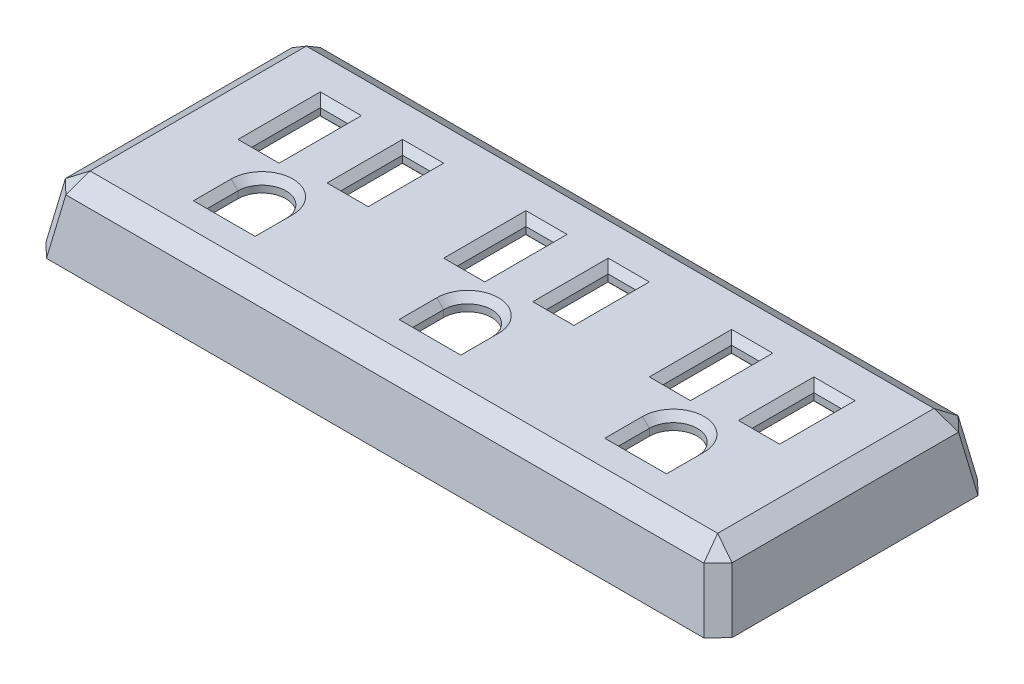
ISO-10303-21;
HEADER;
FILE_DESCRIPTION(('STEP AP214'),'2;1');
FILE_NAME('part.step','',(''),(''),'','','');
FILE_SCHEMA(('AUTOMOTIVE_DESIGN { 1 0 10303 214 1 1 1 1 }'));
ENDSEC;
DATA;
#1=APPLICATION_CONTEXT('core data for automotive mechanical design processes');
#2=APPLICATION_PROTOCOL_DEFINITION('international standard','automotive_design',2000,#1);
#3=PRODUCT_CONTEXT('',#1,'mechanical');
#4=PRODUCT('Part','Part','',(#3));
#5=PRODUCT_RELATED_PRODUCT_CATEGORY('part','',(#4));
#6=PRODUCT_DEFINITION_FORMATION('','',#4);
#7=PRODUCT_DEFINITION_CONTEXT('part definition',#1,'design');
#8=PRODUCT_DEFINITION('design','',#6,#7);
#9=PRODUCT_DEFINITION_SHAPE('','',#8);
#10=(LENGTH_UNIT() NAMED_UNIT(*) SI_UNIT(.MILLI.,.METRE.));
#11=(NAMED_UNIT(*) PLANE_ANGLE_UNIT() SI_UNIT($,.RADIAN.));
#12=(NAMED_UNIT(*) SI_UNIT($,.STERADIAN.) SOLID_ANGLE_UNIT());
#13=UNCERTAINTY_MEASURE_WITH_UNIT(LENGTH_MEASURE(1.E-05),#10,'distance_accuracy_value','');
#14=(GEOMETRIC_REPRESENTATION_CONTEXT(3) GLOBAL_UNCERTAINTY_ASSIGNED_CONTEXT((#13)) GLOBAL_UNIT_ASSIGNED_CONTEXT((#10,
#11,#12)) REPRESENTATION_CONTEXT('',''));
#15=CARTESIAN_POINT('',(0.,0.,0.));
#16=DIRECTION('',(0.,0.,1.));
#17=DIRECTION('',(1.,0.,0.));
#18=AXIS2_PLACEMENT_3D('',#15,#16,#17);
#19=CARTESIAN_POINT('',(-50.,0.,-20.));
#20=DIRECTION('',(0.,-1.,0.));
#21=DIRECTION('',(0.,0.,-1.));
#22=AXIS2_PLACEMENT_3D('',#19,#20,#21);
#23=PLANE('',#22);
#24=DIRECTION('',(0.,0.,1.));
#25=VECTOR('',#24,1.);
#26=CARTESIAN_POINT('',(-50.,0.,20.));
#27=LINE('',#26,#25);
#28=CARTESIAN_POINT('',(-50.,0.,-17.9059754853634));
#29=VERTEX_POINT('',#28);
#30=CARTESIAN_POINT('',(-50.,0.,17.9700702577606));
#31=VERTEX_POINT('',#30);
#32=EDGE_CURVE('E944',#29,#31,#27,.T.);
#33=ORIENTED_EDGE('',*,*,#32,.F.);
#34=DIRECTION('',(-0.696032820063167,0.,0.718009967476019));
#35=VECTOR('',#34,1.);
#36=CARTESIAN_POINT('',(-48.9534934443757,0.,-18.9855253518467));
#37=LINE('',#36,#35);
#38=CARTESIAN_POINT('',(-47.9700702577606,0.,-20.));
#39=VERTEX_POINT('',#38);
#40=EDGE_CURVE('E996',#29,#39,#37,.F.);
#41=ORIENTED_EDGE('',*,*,#40,.T.);
#42=DIRECTION('',(-1.,0.,0.));
#43=VECTOR('',#42,1.);
#44=CARTESIAN_POINT('',(-50.,0.,-20.));
#45=LINE('',#44,#43);
#46=CARTESIAN_POINT('',(47.9059754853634,0.,-20.));
#47=VERTEX_POINT('',#46);
#48=EDGE_CURVE('E953',#47,#39,#45,.T.);
#49=ORIENTED_EDGE('',*,*,#48,.F.);
#50=DIRECTION('',(-0.718009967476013,0.,-0.696032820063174));
#51=VECTOR('',#50,1.);
#52=CARTESIAN_POINT('',(-2.56830598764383,0.,-68.9293436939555));
#53=LINE('',#52,#51);
#54=CARTESIAN_POINT('',(50.,0.,-17.9700702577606));
#55=VERTEX_POINT('',#54);
#56=EDGE_CURVE('E994',#47,#55,#53,.F.);
#57=ORIENTED_EDGE('',*,*,#56,.T.);
#58=DIRECTION('',(0.,0.,-1.));
#59=VECTOR('',#58,1.);
#60=CARTESIAN_POINT('',(50.,0.,20.));
#61=LINE('',#60,#59);
#62=CARTESIAN_POINT('',(50.,0.,17.9059754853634));
#63=VERTEX_POINT('',#62);
#64=EDGE_CURVE('E950',#63,#55,#61,.T.);
#65=ORIENTED_EDGE('',*,*,#64,.F.);
#66=DIRECTION('',(0.696032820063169,0.,-0.718009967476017));
#67=VECTOR('',#66,1.);
#68=CARTESIAN_POINT('',(20.4976648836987,0.,48.33984306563));
#69=LINE('',#68,#67);
#70=CARTESIAN_POINT('',(47.9700702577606,0.,20.));
#71=VERTEX_POINT('',#70);
#72=EDGE_CURVE('E992',#63,#71,#69,.F.);
#73=ORIENTED_EDGE('',*,*,#72,.T.);
#74=DIRECTION('',(1.,0.,0.));
#75=VECTOR('',#74,1.);
#76=CARTESIAN_POINT('',(-50.,0.,20.));
#77=LINE('',#76,#75);
#78=CARTESIAN_POINT('',(-47.9059754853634,0.,20.));
#79=VERTEX_POINT('',#78);
#80=EDGE_CURVE('E947',#79,#71,#77,.T.);
#81=ORIENTED_EDGE('',*,*,#80,.F.);
#82=DIRECTION('',(0.718009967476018,0.,0.696032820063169));
#83=VECTOR('',#82,1.);
#84=CARTESIAN_POINT('',(-68.9758654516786,0.,-0.424974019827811));
#85=LINE('',#84,#83);
#86=EDGE_CURVE('E990',#79,#31,#85,.F.);
#87=ORIENTED_EDGE('',*,*,#86,.T.);
#88=EDGE_LOOP('',(#33,#41,#49,#57,#65,#73,#81,#87));
#89=FACE_BOUND('',#88,.T.);
#90=DIRECTION('',(-0.696032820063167,0.,0.718009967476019));
#91=VECTOR('',#90,1.);
#92=CARTESIAN_POINT('',(-47.4735096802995,0.,-17.5508415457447));
#93=LINE('',#92,#91);
#94=CARTESIAN_POINT('',(-47.9691467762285,0.,-17.0395547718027));
#95=VERTEX_POINT('',#94);
#96=CARTESIAN_POINT('',(-47.0680081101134,0.,-17.9691467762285));
#97=VERTEX_POINT('',#96);
#98=EDGE_CURVE('E778',#95,#97,#93,.F.);
#99=ORIENTED_EDGE('',*,*,#98,.F.);
#100=DIRECTION('',(0.,0.,-1.));
#101=VECTOR('',#100,1.);
#102=CARTESIAN_POINT('',(-47.9691467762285,0.,-20.));
#103=LINE('',#102,#101);
#104=CARTESIAN_POINT('',(-47.9691467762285,0.,17.0680081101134));
#105=VERTEX_POINT('',#104);
#106=EDGE_CURVE('E788',#95,#105,#103,.F.);
#107=ORIENTED_EDGE('',*,*,#106,.T.);
#108=DIRECTION('',(0.718009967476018,0.,0.696032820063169));
#109=VECTOR('',#108,1.);
#110=CARTESIAN_POINT('',(-67.5411816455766,0.,-1.90495778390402));
#111=LINE('',#110,#109);
#112=CARTESIAN_POINT('',(-47.0395547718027,0.,17.9691467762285));
#113=VERTEX_POINT('',#112);
#114=EDGE_CURVE('E803',#113,#105,#111,.F.);
#115=ORIENTED_EDGE('',*,*,#114,.F.);
#116=DIRECTION('',(-1.,0.,0.));
#117=VECTOR('',#116,1.);
#118=CARTESIAN_POINT('',(-50.,0.,17.9691467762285));
#119=LINE('',#118,#117);
#120=CARTESIAN_POINT('',(47.0680081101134,0.,17.9691467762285));
#121=VERTEX_POINT('',#120);
#122=EDGE_CURVE('E791',#113,#121,#119,.F.);
#123=ORIENTED_EDGE('',*,*,#122,.T.);
#124=DIRECTION('',(0.696032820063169,0.,-0.718009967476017));
#125=VECTOR('',#124,1.);
#126=CARTESIAN_POINT('',(19.0176811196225,0.,46.905159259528));
#127=LINE('',#126,#125);
#128=CARTESIAN_POINT('',(47.9691467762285,0.,17.0395547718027));
#129=VERTEX_POINT('',#128);
#130=EDGE_CURVE('E799',#129,#121,#127,.F.);
#131=ORIENTED_EDGE('',*,*,#130,.F.);
#132=DIRECTION('',(0.,0.,1.));
#133=VECTOR('',#132,1.);
#134=CARTESIAN_POINT('',(47.9691467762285,0.,-20.));
#135=LINE('',#134,#133);
#136=CARTESIAN_POINT('',(47.9691467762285,0.,-17.0680081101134));
#137=VERTEX_POINT('',#136);
#138=EDGE_CURVE('E797',#129,#137,#135,.F.);
#139=ORIENTED_EDGE('',*,*,#138,.T.);
#140=DIRECTION('',(-0.718009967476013,0.,-0.696032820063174));
#141=VECTOR('',#140,1.);
#142=CARTESIAN_POINT('',(-4.00298979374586,0.,-67.4493599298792));
#143=LINE('',#142,#141);
#144=CARTESIAN_POINT('',(47.0395547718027,0.,-17.9691467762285));
#145=VERTEX_POINT('',#144);
#146=EDGE_CURVE('E794',#145,#137,#143,.F.);
#147=ORIENTED_EDGE('',*,*,#146,.F.);
#148=DIRECTION('',(1.,0.,0.));
#149=VECTOR('',#148,1.);
#150=CARTESIAN_POINT('',(-50.,0.,-17.9691467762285));
#151=LINE('',#150,#149);
#152=EDGE_CURVE('E771',#145,#97,#151,.F.);
#153=ORIENTED_EDGE('',*,*,#152,.T.);
#154=EDGE_LOOP('',(#99,#107,#115,#123,#131,#139,#147,#153));
#155=FACE_BOUND('',#154,.T.);
#156=ADVANCED_FACE('F28',(#89,#155),#23,.T.);
#157=CARTESIAN_POINT('',(-50.,0.,20.));
#158=DIRECTION('',(-0.984807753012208,0.173648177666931,0.));
#159=DIRECTION('',(-0.173648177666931,-0.984807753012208,0.));
#160=AXIS2_PLACEMENT_3D('',#157,#158,#159);
#161=PLANE('',#160);
#162=DIRECTION('',(0.,0.,1.));
#163=VECTOR('',#162,1.);
#164=CARTESIAN_POINT('',(-48.5840265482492,8.03038449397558,20.));
#165=LINE('',#164,#163);
#166=CARTESIAN_POINT('',(-48.5840265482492,8.03038449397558,16.5540968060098));
#167=VERTEX_POINT('',#166);
#168=CARTESIAN_POINT('',(-48.5840265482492,8.03038449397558,-16.4900020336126));
#169=VERTEX_POINT('',#168);
#170=EDGE_CURVE('E986',#167,#169,#165,.F.);
#171=ORIENTED_EDGE('',*,*,#170,.T.);
#172=DIRECTION('',(0.171087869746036,0.970287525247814,0.171087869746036));
#173=VECTOR('',#172,1.);
#174=CARTESIAN_POINT('',(-48.8904519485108,6.29255969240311,-16.7964274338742));
#175=LINE('',#174,#173);
#176=EDGE_CURVE('E988',#169,#29,#175,.F.);
#177=ORIENTED_EDGE('',*,*,#176,.T.);
#178=ORIENTED_EDGE('',*,*,#32,.T.);
#179=DIRECTION('',(-0.171087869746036,-0.970287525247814,0.171087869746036));
#180=VECTOR('',#179,1.);
#181=CARTESIAN_POINT('',(-50.0594181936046,-0.336977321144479,18.0294884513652));
#182=LINE('',#181,#180);
#183=EDGE_CURVE('E984',#31,#167,#182,.F.);
#184=ORIENTED_EDGE('',*,*,#183,.T.);
#185=EDGE_LOOP('',(#171,#177,#178,#184));
#186=FACE_BOUND('',#185,.T.);
#187=ADVANCED_FACE('F1198',(#186),#161,.T.);
#188=CARTESIAN_POINT('',(-50.,0.,20.));
#189=DIRECTION('',(0.,0.173648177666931,0.984807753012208));
#190=DIRECTION('',(0.,-0.984807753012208,0.173648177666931));
#191=AXIS2_PLACEMENT_3D('',#188,#189,#190);
#192=PLANE('',#191);
#193=ORIENTED_EDGE('',*,*,#80,.T.);
#194=DIRECTION('',(0.171087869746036,-0.970287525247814,0.171087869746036));
#195=VECTOR('',#194,1.);
#196=CARTESIAN_POINT('',(45.1023825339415,16.2634652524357,17.132312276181));
#197=LINE('',#196,#195);
#198=CARTESIAN_POINT('',(46.5540968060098,8.03038449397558,18.5840265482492));
#199=VERTEX_POINT('',#198);
#200=EDGE_CURVE('E982',#71,#199,#197,.F.);
#201=ORIENTED_EDGE('',*,*,#200,.T.);
#202=DIRECTION('',(1.,0.,0.));
#203=VECTOR('',#202,1.);
#204=CARTESIAN_POINT('',(-50.,8.03038449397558,18.5840265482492));
#205=LINE('',#204,#203);
#206=CARTESIAN_POINT('',(-46.4900020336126,8.03038449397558,18.5840265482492));
#207=VERTEX_POINT('',#206);
#208=EDGE_CURVE('E980',#199,#207,#205,.F.);
#209=ORIENTED_EDGE('',*,*,#208,.T.);
#210=DIRECTION('',(0.171087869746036,0.970287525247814,-0.171087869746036));
#211=VECTOR('',#210,1.);
#212=CARTESIAN_POINT('',(-47.9672698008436,-0.347617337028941,20.0612943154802));
#213=LINE('',#212,#211);
#214=EDGE_CURVE('E978',#207,#79,#213,.F.);
#215=ORIENTED_EDGE('',*,*,#214,.T.);
#216=EDGE_LOOP('',(#193,#201,#209,#215));
#217=FACE_BOUND('',#216,.T.);
#218=ADVANCED_FACE('F30',(#217),#192,.T.);
#219=CARTESIAN_POINT('',(50.,0.,20.));
#220=DIRECTION('',(0.984807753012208,0.173648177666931,0.));
#221=DIRECTION('',(-0.173648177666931,0.984807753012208,0.));
#222=AXIS2_PLACEMENT_3D('',#219,#220,#221);
#223=PLANE('',#222);
#224=ORIENTED_EDGE('',*,*,#64,.T.);
#225=DIRECTION('',(0.171087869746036,-0.970287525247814,-0.171087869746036));
#226=VECTOR('',#225,1.);
#227=CARTESIAN_POINT('',(48.8885758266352,6.30319970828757,-16.8586460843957));
#228=LINE('',#227,#226);
#229=CARTESIAN_POINT('',(48.5840265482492,8.03038449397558,-16.5540968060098));
#230=VERTEX_POINT('',#229);
#231=EDGE_CURVE('E976',#55,#230,#228,.F.);
#232=ORIENTED_EDGE('',*,*,#231,.T.);
#233=DIRECTION('',(0.,0.,-1.));
#234=VECTOR('',#233,1.);
#235=CARTESIAN_POINT('',(48.5840265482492,8.03038449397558,20.));
#236=LINE('',#235,#234);
#237=CARTESIAN_POINT('',(48.5840265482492,8.03038449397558,16.4900020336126));
#238=VERTEX_POINT('',#237);
#239=EDGE_CURVE('E974',#230,#238,#236,.F.);
#240=ORIENTED_EDGE('',*,*,#239,.T.);
#241=DIRECTION('',(-0.171087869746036,0.970287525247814,-0.171087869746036));
#242=VECTOR('',#241,1.);
#243=CARTESIAN_POINT('',(50.0612943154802,-0.347617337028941,17.9672698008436));
#244=LINE('',#243,#242);
#245=EDGE_CURVE('E972',#238,#63,#244,.F.);
#246=ORIENTED_EDGE('',*,*,#245,.T.);
#247=EDGE_LOOP('',(#224,#232,#240,#246));
#248=FACE_BOUND('',#247,.T.);
#249=ADVANCED_FACE('F1220',(#248),#223,.T.);
#250=CARTESIAN_POINT('',(-50.,0.,-20.));
#251=DIRECTION('',(0.,0.173648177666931,-0.984807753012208));
#252=DIRECTION('',(0.,0.984807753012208,0.173648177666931));
#253=AXIS2_PLACEMENT_3D('',#250,#251,#252);
#254=PLANE('',#253);
#255=ORIENTED_EDGE('',*,*,#48,.T.);
#256=DIRECTION('',(-0.171087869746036,-0.970287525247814,-0.171087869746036));
#257=VECTOR('',#256,1.);
#258=CARTESIAN_POINT('',(-48.0294884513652,-0.336977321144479,-20.0594181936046));
#259=LINE('',#258,#257);
#260=CARTESIAN_POINT('',(-46.5540968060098,8.03038449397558,-18.5840265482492));
#261=VERTEX_POINT('',#260);
#262=EDGE_CURVE('E970',#39,#261,#259,.F.);
#263=ORIENTED_EDGE('',*,*,#262,.T.);
#264=DIRECTION('',(-1.,0.,0.));
#265=VECTOR('',#264,1.);
#266=CARTESIAN_POINT('',(-50.,8.03038449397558,-18.5840265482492));
#267=LINE('',#266,#265);
#268=CARTESIAN_POINT('',(46.4900020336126,8.03038449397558,-18.5840265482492));
#269=VERTEX_POINT('',#268);
#270=EDGE_CURVE('E967',#261,#269,#267,.F.);
#271=ORIENTED_EDGE('',*,*,#270,.T.);
#272=DIRECTION('',(-0.171087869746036,0.970287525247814,0.171087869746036));
#273=VECTOR('',#272,1.);
#274=CARTESIAN_POINT('',(45.04016388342,16.2528252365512,-17.1341883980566));
#275=LINE('',#274,#273);
#276=EDGE_CURVE('E965',#269,#47,#275,.F.);
#277=ORIENTED_EDGE('',*,*,#276,.T.);
#278=EDGE_LOOP('',(#255,#263,#271,#277));
#279=FACE_BOUND('',#278,.T.);
#280=ADVANCED_FACE('F1216',(#279),#254,.T.);
#281=CARTESIAN_POINT('',(-50.,10.,-20.));
#282=DIRECTION('',(0.,-1.,0.));
#283=DIRECTION('',(0.,0.,-1.));
#284=AXIS2_PLACEMENT_3D('',#281,#282,#283);
#285=PLANE('',#284);
#286=DIRECTION('',(-1.,0.,0.));
#287=VECTOR('',#286,1.);
#288=CARTESIAN_POINT('',(-50.,10.,12.0000000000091));
#289=LINE('',#288,#287);
#290=CARTESIAN_POINT('',(34.5320473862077,10.,12.0000000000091));
#291=VERTEX_POINT('',#290);
#292=CARTESIAN_POINT('',(25.5320473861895,10.,12.0000000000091));
#293=VERTEX_POINT('',#292);
#294=EDGE_CURVE('E612',#291,#293,#289,.T.);
#295=ORIENTED_EDGE('',*,*,#294,.T.);
#296=DIRECTION('',(0.,0.,-1.));
#297=VECTOR('',#296,1.);
#298=CARTESIAN_POINT('',(25.5320473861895,10.,-20.));
#299=LINE('',#298,#297);
#300=CARTESIAN_POINT('',(25.5320473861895,10.,6.49999999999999));
#301=VERTEX_POINT('',#300);
#302=EDGE_CURVE('E614',#293,#301,#299,.T.);
#303=ORIENTED_EDGE('',*,*,#302,.T.);
#304=CARTESIAN_POINT('',(30.0320473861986,10.,6.49999999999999));
#305=DIRECTION('',(0.,-1.,0.));
#306=DIRECTION('',(0.,0.,-1.));
#307=AXIS2_PLACEMENT_3D('',#304,#305,#306);
#308=CIRCLE('',#307,4.5000000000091);
#309=CARTESIAN_POINT('',(34.5320473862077,10.,6.49999999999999));
#310=VERTEX_POINT('',#309);
#311=EDGE_CURVE('E608',#301,#310,#308,.T.);
#312=ORIENTED_EDGE('',*,*,#311,.T.);
#313=DIRECTION('',(0.,0.,1.));
#314=VECTOR('',#313,1.);
#315=CARTESIAN_POINT('',(34.5320473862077,10.,-20.));
#316=LINE('',#315,#314);
#317=EDGE_CURVE('E610',#310,#291,#316,.T.);
#318=ORIENTED_EDGE('',*,*,#317,.T.);
#319=EDGE_LOOP('',(#295,#303,#312,#318));
#320=FACE_BOUND('',#319,.T.);
#321=DIRECTION('',(1.,0.,0.));
#322=VECTOR('',#321,1.);
#323=CARTESIAN_POINT('',(-50.,10.,-11.0000000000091));
#324=LINE('',#323,#322);
#325=CARTESIAN_POINT('',(33.0320473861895,10.,-11.0000000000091));
#326=VERTEX_POINT('',#325);
#327=CARTESIAN_POINT('',(39.0320473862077,10.,-11.0000000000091));
#328=VERTEX_POINT('',#327);
#329=EDGE_CURVE('E603',#326,#328,#324,.T.);
#330=ORIENTED_EDGE('',*,*,#329,.T.);
#331=DIRECTION('',(0.,0.,1.));
#332=VECTOR('',#331,1.);
#333=CARTESIAN_POINT('',(39.0320473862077,10.,-20.));
#334=LINE('',#333,#332);
#335=CARTESIAN_POINT('',(39.0320473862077,10.,9.09342046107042E-12));
#336=VERTEX_POINT('',#335);
#337=EDGE_CURVE('E605',#328,#336,#334,.T.);
#338=ORIENTED_EDGE('',*,*,#337,.T.);
#339=DIRECTION('',(-1.,0.,0.));
#340=VECTOR('',#339,1.);
#341=CARTESIAN_POINT('',(-50.,10.,9.09342046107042E-12));
#342=LINE('',#341,#340);
#343=CARTESIAN_POINT('',(33.0320473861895,10.,9.09342046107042E-12));
#344=VERTEX_POINT('',#343);
#345=EDGE_CURVE('E599',#336,#344,#342,.T.);
#346=ORIENTED_EDGE('',*,*,#345,.T.);
#347=DIRECTION('',(0.,0.,-1.));
#348=VECTOR('',#347,1.);
#349=CARTESIAN_POINT('',(33.0320473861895,10.,-20.));
#350=LINE('',#349,#348);
#351=EDGE_CURVE('E601',#344,#326,#350,.T.);
#352=ORIENTED_EDGE('',*,*,#351,.T.);
#353=EDGE_LOOP('',(#330,#338,#346,#352));
#354=FACE_BOUND('',#353,.T.);
#355=DIRECTION('',(1.,0.,0.));
#356=VECTOR('',#355,1.);
#357=CARTESIAN_POINT('',(-50.,10.,-11.0000000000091));
#358=LINE('',#357,#356);
#359=CARTESIAN_POINT('',(21.0320473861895,10.,-11.0000000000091));
#360=VERTEX_POINT('',#359);
#361=CARTESIAN_POINT('',(27.0320473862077,10.,-11.0000000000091));
#362=VERTEX_POINT('',#361);
#363=EDGE_CURVE('E594',#360,#362,#358,.T.);
#364=ORIENTED_EDGE('',*,*,#363,.T.);
#365=DIRECTION('',(0.,0.,1.));
#366=VECTOR('',#365,1.);
#367=CARTESIAN_POINT('',(27.0320473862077,10.,-20.));
#368=LINE('',#367,#366);
#369=CARTESIAN_POINT('',(27.0320473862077,10.,1.00000000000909));
#370=VERTEX_POINT('',#369);
#371=EDGE_CURVE('E596',#362,#370,#368,.T.);
#372=ORIENTED_EDGE('',*,*,#371,.T.);
#373=DIRECTION('',(-1.,0.,0.));
#374=VECTOR('',#373,1.);
#375=CARTESIAN_POINT('',(-50.,10.,1.00000000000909));
#376=LINE('',#375,#374);
#377=CARTESIAN_POINT('',(21.0320473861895,10.,1.00000000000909));
#378=VERTEX_POINT('',#377);
#379=EDGE_CURVE('E590',#370,#378,#376,.T.);
#380=ORIENTED_EDGE('',*,*,#379,.T.);
#381=DIRECTION('',(0.,0.,-1.));
#382=VECTOR('',#381,1.);
#383=CARTESIAN_POINT('',(21.0320473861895,10.,-20.));
#384=LINE('',#383,#382);
#385=EDGE_CURVE('E592',#378,#360,#384,.T.);
#386=ORIENTED_EDGE('',*,*,#385,.T.);
#387=EDGE_LOOP('',(#364,#372,#380,#386));
#388=FACE_BOUND('',#387,.T.);
#389=DIRECTION('',(-1.,0.,0.));
#390=VECTOR('',#389,1.);
#391=CARTESIAN_POINT('',(-50.,10.,12.0000000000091));
#392=LINE('',#391,#390);
#393=CARTESIAN_POINT('',(-25.4679526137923,10.,12.0000000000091));
#394=VERTEX_POINT('',#393);
#395=CARTESIAN_POINT('',(-34.4679526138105,10.,12.0000000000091));
#396=VERTEX_POINT('',#395);
#397=EDGE_CURVE('E558',#394,#396,#392,.T.);
#398=ORIENTED_EDGE('',*,*,#397,.T.);
#399=DIRECTION('',(0.,0.,-1.));
#400=VECTOR('',#399,1.);
#401=CARTESIAN_POINT('',(-34.4679526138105,10.,-20.));
#402=LINE('',#401,#400);
#403=CARTESIAN_POINT('',(-34.4679526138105,10.,6.49999999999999));
#404=VERTEX_POINT('',#403);
#405=EDGE_CURVE('E560',#396,#404,#402,.T.);
#406=ORIENTED_EDGE('',*,*,#405,.T.);
#407=CARTESIAN_POINT('',(-29.9679526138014,10.,6.49999999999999));
#408=DIRECTION('',(0.,-1.,0.));
#409=DIRECTION('',(0.,0.,-1.));
#410=AXIS2_PLACEMENT_3D('',#407,#408,#409);
#411=CIRCLE('',#410,4.5000000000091);
#412=CARTESIAN_POINT('',(-25.4679526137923,10.,6.49999999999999));
#413=VERTEX_POINT('',#412);
#414=EDGE_CURVE('E554',#404,#413,#411,.T.);
#415=ORIENTED_EDGE('',*,*,#414,.T.);
#416=DIRECTION('',(0.,0.,1.));
#417=VECTOR('',#416,1.);
#418=CARTESIAN_POINT('',(-25.4679526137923,10.,-20.));
#419=LINE('',#418,#417);
#420=EDGE_CURVE('E556',#413,#394,#419,.T.);
#421=ORIENTED_EDGE('',*,*,#420,.T.);
#422=EDGE_LOOP('',(#398,#406,#415,#421));
#423=FACE_BOUND('',#422,.T.);
#424=DIRECTION('',(1.,0.,0.));
#425=VECTOR('',#424,1.);
#426=CARTESIAN_POINT('',(-50.,10.,-11.0000000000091));
#427=LINE('',#426,#425);
#428=CARTESIAN_POINT('',(-26.9679526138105,10.,-11.0000000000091));
#429=VERTEX_POINT('',#428);
#430=CARTESIAN_POINT('',(-20.9679526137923,10.,-11.0000000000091));
#431=VERTEX_POINT('',#430);
#432=EDGE_CURVE('E549',#429,#431,#427,.T.);
#433=ORIENTED_EDGE('',*,*,#432,.T.);
#434=DIRECTION('',(0.,0.,1.));
#435=VECTOR('',#434,1.);
#436=CARTESIAN_POINT('',(-20.9679526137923,10.,-20.));
#437=LINE('',#436,#435);
#438=CARTESIAN_POINT('',(-20.9679526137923,10.,9.08995101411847E-12));
#439=VERTEX_POINT('',#438);
#440=EDGE_CURVE('E551',#431,#439,#437,.T.);
#441=ORIENTED_EDGE('',*,*,#440,.T.);
#442=DIRECTION('',(-1.,0.,0.));
#443=VECTOR('',#442,1.);
#444=CARTESIAN_POINT('',(-50.,10.,9.08995101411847E-12));
#445=LINE('',#444,#443);
#446=CARTESIAN_POINT('',(-26.9679526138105,10.,9.08995101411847E-12));
#447=VERTEX_POINT('',#446);
#448=EDGE_CURVE('E545',#439,#447,#445,.T.);
#449=ORIENTED_EDGE('',*,*,#448,.T.);
#450=DIRECTION('',(0.,0.,-1.));
#451=VECTOR('',#450,1.);
#452=CARTESIAN_POINT('',(-26.9679526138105,10.,-20.));
#453=LINE('',#452,#451);
#454=EDGE_CURVE('E547',#447,#429,#453,.T.);
#455=ORIENTED_EDGE('',*,*,#454,.T.);
#456=EDGE_LOOP('',(#433,#441,#449,#455));
#457=FACE_BOUND('',#456,.T.);
#458=DIRECTION('',(1.,0.,0.));
#459=VECTOR('',#458,1.);
#460=CARTESIAN_POINT('',(-50.,10.,-11.0000000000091));
#461=LINE('',#460,#459);
#462=CARTESIAN_POINT('',(-38.9679526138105,10.,-11.0000000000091));
#463=VERTEX_POINT('',#462);
#464=CARTESIAN_POINT('',(-32.9679526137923,10.,-11.0000000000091));
#465=VERTEX_POINT('',#464);
#466=EDGE_CURVE('E540',#463,#465,#461,.T.);
#467=ORIENTED_EDGE('',*,*,#466,.T.);
#468=DIRECTION('',(0.,0.,1.));
#469=VECTOR('',#468,1.);
#470=CARTESIAN_POINT('',(-32.9679526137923,10.,-20.));
#471=LINE('',#470,#469);
#472=CARTESIAN_POINT('',(-32.9679526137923,10.,1.00000000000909));
#473=VERTEX_POINT('',#472);
#474=EDGE_CURVE('E542',#465,#473,#471,.T.);
#475=ORIENTED_EDGE('',*,*,#474,.T.);
#476=DIRECTION('',(-1.,0.,0.));
#477=VECTOR('',#476,1.);
#478=CARTESIAN_POINT('',(-50.,10.,1.00000000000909));
#479=LINE('',#478,#477);
#480=CARTESIAN_POINT('',(-38.9679526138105,10.,1.00000000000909));
#481=VERTEX_POINT('',#480);
#482=EDGE_CURVE('E532',#473,#481,#479,.T.);
#483=ORIENTED_EDGE('',*,*,#482,.T.);
#484=DIRECTION('',(0.,0.,-1.));
#485=VECTOR('',#484,1.);
#486=CARTESIAN_POINT('',(-38.9679526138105,10.,-20.));
#487=LINE('',#486,#485);
#488=EDGE_CURVE('E538',#481,#463,#487,.T.);
#489=ORIENTED_EDGE('',*,*,#488,.T.);
#490=EDGE_LOOP('',(#467,#475,#483,#489));
#491=FACE_BOUND('',#490,.T.);
#492=DIRECTION('',(-1.,0.,0.));
#493=VECTOR('',#492,1.);
#494=CARTESIAN_POINT('',(-50.,10.,12.0000000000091));
#495=LINE('',#494,#493);
#496=CARTESIAN_POINT('',(4.53204738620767,10.,12.0000000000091));
#497=VERTEX_POINT('',#496);
#498=CARTESIAN_POINT('',(-4.46795261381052,10.,12.0000000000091));
#499=VERTEX_POINT('',#498);
#500=EDGE_CURVE('E1050',#497,#499,#495,.T.);
#501=ORIENTED_EDGE('',*,*,#500,.T.);
#502=DIRECTION('',(0.,0.,-1.));
#503=VECTOR('',#502,1.);
#504=CARTESIAN_POINT('',(-4.46795261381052,10.,-20.));
#505=LINE('',#504,#503);
#506=CARTESIAN_POINT('',(-4.46795261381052,10.,6.49999999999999));
#507=VERTEX_POINT('',#506);
#508=EDGE_CURVE('E1052',#499,#507,#505,.T.);
#509=ORIENTED_EDGE('',*,*,#508,.T.);
#510=CARTESIAN_POINT('',(0.0320473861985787,10.,6.49999999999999));
#511=DIRECTION('',(0.,-1.,0.));
#512=DIRECTION('',(0.,0.,-1.));
#513=AXIS2_PLACEMENT_3D('',#510,#511,#512);
#514=CIRCLE('',#513,4.5000000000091);
#515=CARTESIAN_POINT('',(4.53204738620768,10.,6.49999999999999));
#516=VERTEX_POINT('',#515);
#517=EDGE_CURVE('E1046',#507,#516,#514,.T.);
#518=ORIENTED_EDGE('',*,*,#517,.T.);
#519=DIRECTION('',(0.,0.,1.));
#520=VECTOR('',#519,1.);
#521=CARTESIAN_POINT('',(4.53204738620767,10.,-20.));
#522=LINE('',#521,#520);
#523=EDGE_CURVE('E1048',#516,#497,#522,.T.);
#524=ORIENTED_EDGE('',*,*,#523,.T.);
#525=EDGE_LOOP('',(#501,#509,#518,#524));
#526=FACE_BOUND('',#525,.T.);
#527=DIRECTION('',(1.,0.,0.));
#528=VECTOR('',#527,1.);
#529=CARTESIAN_POINT('',(-50.,10.,-11.0000000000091));
#530=LINE('',#529,#528);
#531=CARTESIAN_POINT('',(3.03204738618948,10.,-11.0000000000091));
#532=VERTEX_POINT('',#531);
#533=CARTESIAN_POINT('',(9.03204738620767,10.,-11.0000000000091));
#534=VERTEX_POINT('',#533);
#535=EDGE_CURVE('E1041',#532,#534,#530,.T.);
#536=ORIENTED_EDGE('',*,*,#535,.T.);
#537=DIRECTION('',(0.,0.,1.));
#538=VECTOR('',#537,1.);
#539=CARTESIAN_POINT('',(9.03204738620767,10.,-20.));
#540=LINE('',#539,#538);
#541=CARTESIAN_POINT('',(9.03204738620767,10.,9.08995101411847E-12));
#542=VERTEX_POINT('',#541);
#543=EDGE_CURVE('E1043',#534,#542,#540,.T.);
#544=ORIENTED_EDGE('',*,*,#543,.T.);
#545=DIRECTION('',(-1.,0.,0.));
#546=VECTOR('',#545,1.);
#547=CARTESIAN_POINT('',(-50.,10.,9.08995101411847E-12));
#548=LINE('',#547,#546);
#549=CARTESIAN_POINT('',(3.03204738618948,10.,9.08995101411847E-12));
#550=VERTEX_POINT('',#549);
#551=EDGE_CURVE('E1037',#542,#550,#548,.T.);
#552=ORIENTED_EDGE('',*,*,#551,.T.);
#553=DIRECTION('',(0.,0.,-1.));
#554=VECTOR('',#553,1.);
#555=CARTESIAN_POINT('',(3.03204738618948,10.,-20.));
#556=LINE('',#555,#554);
#557=EDGE_CURVE('E1039',#550,#532,#556,.T.);
#558=ORIENTED_EDGE('',*,*,#557,.T.);
#559=EDGE_LOOP('',(#536,#544,#552,#558));
#560=FACE_BOUND('',#559,.T.);
#561=DIRECTION('',(1.,0.,0.));
#562=VECTOR('',#561,1.);
#563=CARTESIAN_POINT('',(-50.,10.,-11.0000000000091));
#564=LINE('',#563,#562);
#565=CARTESIAN_POINT('',(-8.96795261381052,10.,-11.0000000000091));
#566=VERTEX_POINT('',#565);
#567=CARTESIAN_POINT('',(-2.96795261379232,10.,-11.0000000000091));
#568=VERTEX_POINT('',#567);
#569=EDGE_CURVE('E1032',#566,#568,#564,.T.);
#570=ORIENTED_EDGE('',*,*,#569,.T.);
#571=DIRECTION('',(0.,0.,1.));
#572=VECTOR('',#571,1.);
#573=CARTESIAN_POINT('',(-2.96795261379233,10.,-20.));
#574=LINE('',#573,#572);
#575=CARTESIAN_POINT('',(-2.96795261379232,10.,1.00000000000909));
#576=VERTEX_POINT('',#575);
#577=EDGE_CURVE('E1034',#568,#576,#574,.T.);
#578=ORIENTED_EDGE('',*,*,#577,.T.);
#579=DIRECTION('',(-1.,0.,0.));
#580=VECTOR('',#579,1.);
#581=CARTESIAN_POINT('',(-50.,10.,1.00000000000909));
#582=LINE('',#581,#580);
#583=CARTESIAN_POINT('',(-8.96795261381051,10.,1.00000000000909));
#584=VERTEX_POINT('',#583);
#585=EDGE_CURVE('E1028',#576,#584,#582,.T.);
#586=ORIENTED_EDGE('',*,*,#585,.T.);
#587=DIRECTION('',(0.,0.,-1.));
#588=VECTOR('',#587,1.);
#589=CARTESIAN_POINT('',(-8.96795261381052,10.,-20.));
#590=LINE('',#589,#588);
#591=EDGE_CURVE('E1030',#584,#566,#590,.T.);
#592=ORIENTED_EDGE('',*,*,#591,.T.);
#593=EDGE_LOOP('',(#570,#578,#586,#592));
#594=FACE_BOUND('',#593,.T.);
#595=DIRECTION('',(0.,0.,-1.));
#596=VECTOR('',#595,1.);
#597=CARTESIAN_POINT('',(45.7711240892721,10.,-20.));
#598=LINE('',#597,#596);
#599=CARTESIAN_POINT('',(45.7711240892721,10.,15.7711240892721));
#600=VERTEX_POINT('',#599);
#601=CARTESIAN_POINT('',(45.7711240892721,10.,-15.7711240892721));
#602=VERTEX_POINT('',#601);
#603=EDGE_CURVE('E960',#600,#602,#598,.T.);
#604=ORIENTED_EDGE('',*,*,#603,.T.);
#605=DIRECTION('',(-1.,0.,0.));
#606=VECTOR('',#605,1.);
#607=CARTESIAN_POINT('',(-50.,10.,-15.7711240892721));
#608=LINE('',#607,#606);
#609=CARTESIAN_POINT('',(-45.7711240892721,10.,-15.7711240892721));
#610=VERTEX_POINT('',#609);
#611=EDGE_CURVE('E962',#602,#610,#608,.T.);
#612=ORIENTED_EDGE('',*,*,#611,.T.);
#613=DIRECTION('',(0.,0.,1.));
#614=VECTOR('',#613,1.);
#615=CARTESIAN_POINT('',(-45.7711240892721,10.,-20.));
#616=LINE('',#615,#614);
#617=CARTESIAN_POINT('',(-45.7711240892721,10.,15.7711240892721));
#618=VERTEX_POINT('',#617);
#619=EDGE_CURVE('E956',#610,#618,#616,.T.);
#620=ORIENTED_EDGE('',*,*,#619,.T.);
#621=DIRECTION('',(1.,0.,0.));
#622=VECTOR('',#621,1.);
#623=CARTESIAN_POINT('',(-50.,10.,15.7711240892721));
#624=LINE('',#623,#622);
#625=EDGE_CURVE('E958',#618,#600,#624,.T.);
#626=ORIENTED_EDGE('',*,*,#625,.T.);
#627=EDGE_LOOP('',(#604,#612,#620,#626));
#628=FACE_BOUND('',#627,.T.);
#629=ADVANCED_FACE('F1214',(#320,#354,#388,#423,#457,#491,#526,#560,#594,#628),#285,.F.);
#630=CARTESIAN_POINT('',(50.0612943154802,-0.347617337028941,17.9672698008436));
#631=DIRECTION('',(-0.696681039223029,-0.241927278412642,-0.675356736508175));
#632=DIRECTION('',(-0.696032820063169,0.,0.718009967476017));
#633=AXIS2_PLACEMENT_3D('',#630,#631,#632);
#634=PLANE('',#633);
#635=ORIENTED_EDGE('',*,*,#72,.F.);
#636=ORIENTED_EDGE('',*,*,#245,.F.);
#637=DIRECTION('',(-0.696032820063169,0.,0.718009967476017));
#638=VECTOR('',#637,1.);
#639=CARTESIAN_POINT('',(48.5840265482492,8.03038449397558,16.4900020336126));
#640=LINE('',#639,#638);
#641=EDGE_CURVE('E941',#199,#238,#640,.F.);
#642=ORIENTED_EDGE('',*,*,#641,.F.);
#643=ORIENTED_EDGE('',*,*,#200,.F.);
#644=EDGE_LOOP('',(#635,#636,#642,#643));
#645=FACE_BOUND('',#644,.T.);
#646=ADVANCED_FACE('F1212',(#645),#634,.F.);
#647=CARTESIAN_POINT('',(-50.,10.,15.7711240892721));
#648=DIRECTION('',(0.,0.819152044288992,0.573576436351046));
#649=DIRECTION('',(0.,-0.573576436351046,0.819152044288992));
#650=AXIS2_PLACEMENT_3D('',#647,#648,#649);
#651=PLANE('',#650);
#652=DIRECTION('',(0.204904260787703,0.561406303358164,-0.80177129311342));
#653=VECTOR('',#652,1.);
#654=CARTESIAN_POINT('',(-46.4900020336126,8.03038449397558,18.5840265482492));
#655=LINE('',#654,#653);
#656=EDGE_CURVE('E935',#207,#618,#655,.T.);
#657=ORIENTED_EDGE('',*,*,#656,.F.);
#658=ORIENTED_EDGE('',*,*,#208,.F.);
#659=DIRECTION('',(0.22230582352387,-0.559223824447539,0.798654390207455));
#660=VECTOR('',#659,1.);
#661=CARTESIAN_POINT('',(46.2826310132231,8.71327321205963,17.6087603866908));
#662=LINE('',#661,#660);
#663=EDGE_CURVE('E938',#600,#199,#662,.T.);
#664=ORIENTED_EDGE('',*,*,#663,.F.);
#665=ORIENTED_EDGE('',*,*,#625,.F.);
#666=EDGE_LOOP('',(#657,#658,#664,#665));
#667=FACE_BOUND('',#666,.T.);
#668=ADVANCED_FACE('F1257',(#667),#651,.T.);
#669=CARTESIAN_POINT('',(-47.9672698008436,-0.347617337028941,20.0612943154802));
#670=DIRECTION('',(0.675356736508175,-0.241927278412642,-0.696681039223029));
#671=DIRECTION('',(-0.718009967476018,0.,-0.696032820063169));
#672=AXIS2_PLACEMENT_3D('',#669,#670,#671);
#673=PLANE('',#672);
#674=ORIENTED_EDGE('',*,*,#86,.F.);
#675=ORIENTED_EDGE('',*,*,#214,.F.);
#676=DIRECTION('',(-0.718009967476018,0.,-0.696032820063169));
#677=VECTOR('',#676,1.);
#678=CARTESIAN_POINT('',(-46.4900020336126,8.03038449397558,18.5840265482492));
#679=LINE('',#678,#677);
#680=EDGE_CURVE('E932',#167,#207,#679,.F.);
#681=ORIENTED_EDGE('',*,*,#680,.F.);
#682=ORIENTED_EDGE('',*,*,#183,.F.);
#683=EDGE_LOOP('',(#674,#675,#681,#682));
#684=FACE_BOUND('',#683,.T.);
#685=ADVANCED_FACE('F1263',(#684),#673,.F.);
#686=CARTESIAN_POINT('',(48.5840265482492,8.03038449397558,16.4900020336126));
#687=DIRECTION('',(0.442153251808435,0.787899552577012,0.428619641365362));
#688=DIRECTION('',(-0.872067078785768,0.489386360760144,0.));
#689=AXIS2_PLACEMENT_3D('',#686,#687,#688);
#690=PLANE('',#689);
#691=ORIENTED_EDGE('',*,*,#663,.T.);
#692=ORIENTED_EDGE('',*,*,#641,.T.);
#693=DIRECTION('',(-0.801771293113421,0.561406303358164,-0.204904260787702));
#694=VECTOR('',#693,1.);
#695=CARTESIAN_POINT('',(48.5840265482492,8.03038449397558,16.4900020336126));
#696=LINE('',#695,#694);
#697=EDGE_CURVE('E929',#600,#238,#696,.F.);
#698=ORIENTED_EDGE('',*,*,#697,.F.);
#699=EDGE_LOOP('',(#691,#692,#698));
#700=FACE_BOUND('',#699,.T.);
#701=ADVANCED_FACE('F1251',(#700),#690,.T.);
#702=CARTESIAN_POINT('',(-46.4900020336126,8.03038449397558,18.5840265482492));
#703=DIRECTION('',(-0.428619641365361,0.787899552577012,0.442153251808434));
#704=DIRECTION('',(0.,-0.489386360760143,0.872067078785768));
#705=AXIS2_PLACEMENT_3D('',#702,#703,#704);
#706=PLANE('',#705);
#707=ORIENTED_EDGE('',*,*,#680,.T.);
#708=ORIENTED_EDGE('',*,*,#656,.T.);
#709=DIRECTION('',(-0.798654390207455,-0.559223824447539,0.22230582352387));
#710=VECTOR('',#709,1.);
#711=CARTESIAN_POINT('',(-47.6087603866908,8.71327321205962,16.2826310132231));
#712=LINE('',#711,#710);
#713=EDGE_CURVE('E926',#167,#618,#712,.F.);
#714=ORIENTED_EDGE('',*,*,#713,.F.);
#715=EDGE_LOOP('',(#707,#708,#714));
#716=FACE_BOUND('',#715,.T.);
#717=ADVANCED_FACE('F1308',(#716),#706,.T.);
#718=CARTESIAN_POINT('',(45.04016388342,16.2528252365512,-17.1341883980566));
#719=DIRECTION('',(-0.67535673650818,-0.241927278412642,0.696681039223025));
#720=DIRECTION('',(0.718009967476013,0.,0.696032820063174));
#721=AXIS2_PLACEMENT_3D('',#718,#719,#720);
#722=PLANE('',#721);
#723=ORIENTED_EDGE('',*,*,#56,.F.);
#724=ORIENTED_EDGE('',*,*,#276,.F.);
#725=DIRECTION('',(0.718009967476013,0.,0.696032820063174));
#726=VECTOR('',#725,1.);
#727=CARTESIAN_POINT('',(46.4900020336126,8.03038449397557,-18.5840265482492));
#728=LINE('',#727,#726);
#729=EDGE_CURVE('E923',#230,#269,#728,.F.);
#730=ORIENTED_EDGE('',*,*,#729,.F.);
#731=ORIENTED_EDGE('',*,*,#231,.F.);
#732=EDGE_LOOP('',(#723,#724,#730,#731));
#733=FACE_BOUND('',#732,.T.);
#734=ADVANCED_FACE('F1236',(#733),#722,.F.);
#735=CARTESIAN_POINT('',(45.7711240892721,10.,-20.));
#736=DIRECTION('',(0.573576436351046,0.819152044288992,0.));
#737=DIRECTION('',(-0.819152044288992,0.573576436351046,0.));
#738=AXIS2_PLACEMENT_3D('',#735,#736,#737);
#739=PLANE('',#738);
#740=ORIENTED_EDGE('',*,*,#697,.T.);
#741=ORIENTED_EDGE('',*,*,#239,.F.);
#742=DIRECTION('',(0.798654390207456,-0.55922382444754,-0.222305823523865));
#743=VECTOR('',#742,1.);
#744=CARTESIAN_POINT('',(47.6087603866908,8.71327321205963,-16.2826310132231));
#745=LINE('',#744,#743);
#746=EDGE_CURVE('E920',#602,#230,#745,.T.);
#747=ORIENTED_EDGE('',*,*,#746,.F.);
#748=ORIENTED_EDGE('',*,*,#603,.F.);
#749=EDGE_LOOP('',(#740,#741,#747,#748));
#750=FACE_BOUND('',#749,.T.);
#751=ADVANCED_FACE('F1245',(#750),#739,.T.);
#752=CARTESIAN_POINT('',(-45.7711240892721,10.,-20.));
#753=DIRECTION('',(-0.573576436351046,0.819152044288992,0.));
#754=DIRECTION('',(-0.819152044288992,-0.573576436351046,0.));
#755=AXIS2_PLACEMENT_3D('',#752,#753,#754);
#756=PLANE('',#755);
#757=ORIENTED_EDGE('',*,*,#713,.T.);
#758=ORIENTED_EDGE('',*,*,#619,.F.);
#759=DIRECTION('',(0.801771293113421,0.561406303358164,0.2049042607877));
#760=VECTOR('',#759,1.);
#761=CARTESIAN_POINT('',(-45.7711240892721,10.,-15.7711240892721));
#762=LINE('',#761,#760);
#763=EDGE_CURVE('E917',#169,#610,#762,.T.);
#764=ORIENTED_EDGE('',*,*,#763,.F.);
#765=ORIENTED_EDGE('',*,*,#170,.F.);
#766=EDGE_LOOP('',(#757,#758,#764,#765));
#767=FACE_BOUND('',#766,.T.);
#768=ADVANCED_FACE('F1277',(#767),#756,.T.);
#769=CARTESIAN_POINT('',(-48.8904519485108,6.29255969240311,-16.7964274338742));
#770=DIRECTION('',(0.696681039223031,-0.241927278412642,0.675356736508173));
#771=DIRECTION('',(0.696032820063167,0.,-0.718009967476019));
#772=AXIS2_PLACEMENT_3D('',#769,#770,#771);
#773=PLANE('',#772);
#774=ORIENTED_EDGE('',*,*,#40,.F.);
#775=ORIENTED_EDGE('',*,*,#176,.F.);
#776=DIRECTION('',(0.696032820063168,0.,-0.718009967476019));
#777=VECTOR('',#776,1.);
#778=CARTESIAN_POINT('',(-47.5805484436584,8.03038449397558,-17.5251648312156));
#779=LINE('',#778,#777);
#780=EDGE_CURVE('E914',#261,#169,#779,.F.);
#781=ORIENTED_EDGE('',*,*,#780,.F.);
#782=ORIENTED_EDGE('',*,*,#262,.F.);
#783=EDGE_LOOP('',(#774,#775,#781,#782));
#784=FACE_BOUND('',#783,.T.);
#785=ADVANCED_FACE('F1272',(#784),#773,.F.);
#786=CARTESIAN_POINT('',(46.4900020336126,8.03038449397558,-18.5840265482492));
#787=DIRECTION('',(0.428619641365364,0.787899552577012,-0.442153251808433));
#788=DIRECTION('',(0.,0.489386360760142,0.872067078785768));
#789=AXIS2_PLACEMENT_3D('',#786,#787,#788);
#790=PLANE('',#789);
#791=ORIENTED_EDGE('',*,*,#746,.T.);
#792=ORIENTED_EDGE('',*,*,#729,.T.);
#793=DIRECTION('',(-0.204904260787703,0.561406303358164,0.80177129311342));
#794=VECTOR('',#793,1.);
#795=CARTESIAN_POINT('',(46.4900020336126,8.03038449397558,-18.5840265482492));
#796=LINE('',#795,#794);
#797=EDGE_CURVE('E912',#602,#269,#796,.F.);
#798=ORIENTED_EDGE('',*,*,#797,.F.);
#799=EDGE_LOOP('',(#791,#792,#798));
#800=FACE_BOUND('',#799,.T.);
#801=ADVANCED_FACE('F1241',(#800),#790,.T.);
#802=CARTESIAN_POINT('',(-45.7711240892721,10.,-15.7711240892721));
#803=DIRECTION('',(-0.442153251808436,0.787899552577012,-0.42861964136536));
#804=DIRECTION('',(-0.872067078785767,-0.489386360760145,0.));
#805=AXIS2_PLACEMENT_3D('',#802,#803,#804);
#806=PLANE('',#805);
#807=ORIENTED_EDGE('',*,*,#780,.T.);
#808=ORIENTED_EDGE('',*,*,#763,.T.);
#809=DIRECTION('',(-0.222305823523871,-0.559223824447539,-0.798654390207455));
#810=VECTOR('',#809,1.);
#811=CARTESIAN_POINT('',(-45.7711240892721,10.,-15.7711240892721));
#812=LINE('',#811,#810);
#813=EDGE_CURVE('E787',#261,#610,#812,.F.);
#814=ORIENTED_EDGE('',*,*,#813,.F.);
#815=EDGE_LOOP('',(#807,#808,#814));
#816=FACE_BOUND('',#815,.T.);
#817=ADVANCED_FACE('F1280',(#816),#806,.T.);
#818=CARTESIAN_POINT('',(-50.,10.,-15.7711240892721));
#819=DIRECTION('',(0.,0.819152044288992,-0.573576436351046));
#820=DIRECTION('',(0.,0.573576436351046,0.819152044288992));
#821=AXIS2_PLACEMENT_3D('',#818,#819,#820);
#822=PLANE('',#821);
#823=ORIENTED_EDGE('',*,*,#797,.T.);
#824=ORIENTED_EDGE('',*,*,#270,.F.);
#825=ORIENTED_EDGE('',*,*,#813,.T.);
#826=ORIENTED_EDGE('',*,*,#611,.F.);
#827=EDGE_LOOP('',(#823,#824,#825,#826));
#828=FACE_BOUND('',#827,.T.);
#829=ADVANCED_FACE('F1282',(#828),#822,.T.);
#830=CARTESIAN_POINT('',(-48.0303844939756,-0.347296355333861,20.));
#831=DIRECTION('',(-0.984807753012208,0.173648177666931,0.));
#832=DIRECTION('',(-0.173648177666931,-0.984807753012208,0.));
#833=AXIS2_PLACEMENT_3D('',#830,#831,#832);
#834=PLANE('',#833);
#835=DIRECTION('',(0.,0.,1.));
#836=VECTOR('',#835,1.);
#837=CARTESIAN_POINT('',(-46.7582659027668,6.86724668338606,-20.));
#838=LINE('',#837,#836);
#839=CARTESIAN_POINT('',(-46.7502061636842,6.8729260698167,15.8619791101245));
#840=VERTEX_POINT('',#839);
#841=CARTESIAN_POINT('',(-46.7568937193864,6.87289017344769,-15.8356962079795));
#842=VERTEX_POINT('',#841);
#843=EDGE_CURVE('E808',#840,#842,#838,.F.);
#844=ORIENTED_EDGE('',*,*,#843,.F.);
#845=DIRECTION('',(0.171087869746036,0.970287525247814,-0.171087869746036));
#846=VECTOR('',#845,1.);
#847=CARTESIAN_POINT('',(-48.114414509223,-0.823854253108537,17.2132758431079));
#848=LINE('',#847,#846);
#849=EDGE_CURVE('E810',#105,#840,#848,.T.);
#850=ORIENTED_EDGE('',*,*,#849,.F.);
#851=ORIENTED_EDGE('',*,*,#106,.F.);
#852=DIRECTION('',(-0.171087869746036,-0.970287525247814,-0.171087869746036));
#853=VECTOR('',#852,1.);
#854=CARTESIAN_POINT('',(-46.9444050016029,5.81159939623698,-16.0148129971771));
#855=LINE('',#854,#853);
#856=EDGE_CURVE('E807',#842,#95,#855,.T.);
#857=ORIENTED_EDGE('',*,*,#856,.F.);
#858=EDGE_LOOP('',(#844,#850,#851,#857));
#859=FACE_BOUND('',#858,.T.);
#860=ADVANCED_FACE('F1285',(#859),#834,.F.);
#861=CARTESIAN_POINT('',(-50.,-0.347296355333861,18.0303844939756));
#862=DIRECTION('',(0.,0.173648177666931,0.984807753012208));
#863=DIRECTION('',(0.,-0.984807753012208,0.173648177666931));
#864=AXIS2_PLACEMENT_3D('',#861,#862,#863);
#865=PLANE('',#864);
#866=ORIENTED_EDGE('',*,*,#122,.F.);
#867=DIRECTION('',(-0.171087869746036,-0.970287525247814,0.171087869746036));
#868=VECTOR('',#867,1.);
#869=CARTESIAN_POINT('',(-47.1856553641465,-0.828577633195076,18.1152473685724));
#870=LINE('',#869,#868);
#871=CARTESIAN_POINT('',(-45.8356962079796,6.87289017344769,16.7568937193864));
#872=VERTEX_POINT('',#871);
#873=EDGE_CURVE('E820',#872,#113,#870,.T.);
#874=ORIENTED_EDGE('',*,*,#873,.F.);
#875=DIRECTION('',(1.,0.,0.));
#876=VECTOR('',#875,1.);
#877=CARTESIAN_POINT('',(-50.,6.86724668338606,16.7582659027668));
#878=LINE('',#877,#876);
#879=CARTESIAN_POINT('',(45.8619791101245,6.8729260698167,16.7502061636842));
#880=VERTEX_POINT('',#879);
#881=EDGE_CURVE('E823',#880,#872,#878,.F.);
#882=ORIENTED_EDGE('',*,*,#881,.F.);
#883=DIRECTION('',(-0.171087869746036,0.970287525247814,-0.171087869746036));
#884=VECTOR('',#883,1.);
#885=CARTESIAN_POINT('',(47.2132758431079,-0.823854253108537,18.114414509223));
#886=LINE('',#885,#884);
#887=EDGE_CURVE('E817',#121,#880,#886,.T.);
#888=ORIENTED_EDGE('',*,*,#887,.F.);
#889=EDGE_LOOP('',(#866,#874,#882,#888));
#890=FACE_BOUND('',#889,.T.);
#891=ADVANCED_FACE('F1290',(#890),#865,.F.);
#892=CARTESIAN_POINT('',(48.0303844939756,-0.347296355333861,20.));
#893=DIRECTION('',(0.984807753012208,0.173648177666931,0.));
#894=DIRECTION('',(-0.173648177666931,0.984807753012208,0.));
#895=AXIS2_PLACEMENT_3D('',#892,#893,#894);
#896=PLANE('',#895);
#897=ORIENTED_EDGE('',*,*,#138,.F.);
#898=DIRECTION('',(0.171087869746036,-0.970287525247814,0.171087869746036));
#899=VECTOR('',#898,1.);
#900=CARTESIAN_POINT('',(48.1152473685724,-0.828577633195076,17.1856553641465));
#901=LINE('',#900,#899);
#902=CARTESIAN_POINT('',(46.7568937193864,6.87289017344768,15.8356962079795));
#903=VERTEX_POINT('',#902);
#904=EDGE_CURVE('E840',#903,#129,#901,.T.);
#905=ORIENTED_EDGE('',*,*,#904,.F.);
#906=DIRECTION('',(0.,0.,-1.));
#907=VECTOR('',#906,1.);
#908=CARTESIAN_POINT('',(46.7582659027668,6.86724668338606,-20.));
#909=LINE('',#908,#907);
#910=CARTESIAN_POINT('',(46.7502061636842,6.8729260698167,-15.8619791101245));
#911=VERTEX_POINT('',#910);
#912=EDGE_CURVE('E842',#911,#903,#909,.F.);
#913=ORIENTED_EDGE('',*,*,#912,.F.);
#914=DIRECTION('',(-0.171087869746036,0.970287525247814,0.171087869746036));
#915=VECTOR('',#914,1.);
#916=CARTESIAN_POINT('',(45.1873085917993,15.7765883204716,-14.2861699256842));
#917=LINE('',#916,#915);
#918=EDGE_CURVE('E824',#137,#911,#917,.T.);
#919=ORIENTED_EDGE('',*,*,#918,.F.);
#920=EDGE_LOOP('',(#897,#905,#913,#919));
#921=FACE_BOUND('',#920,.T.);
#922=ADVANCED_FACE('F1851',(#921),#896,.F.);
#923=CARTESIAN_POINT('',(-50.,-0.347296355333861,-18.0303844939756));
#924=DIRECTION('',(0.,0.173648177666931,-0.984807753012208));
#925=DIRECTION('',(0.,0.984807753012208,0.173648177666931));
#926=AXIS2_PLACEMENT_3D('',#923,#924,#925);
#927=PLANE('',#926);
#928=ORIENTED_EDGE('',*,*,#152,.F.);
#929=DIRECTION('',(0.171087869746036,-0.970287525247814,-0.171087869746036));
#930=VECTOR('',#929,1.);
#931=CARTESIAN_POINT('',(44.2585494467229,15.7718649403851,-15.1881414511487));
#932=LINE('',#931,#930);
#933=CARTESIAN_POINT('',(45.8356962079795,6.87289017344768,-16.7568937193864));
#934=VERTEX_POINT('',#933);
#935=EDGE_CURVE('E767',#934,#145,#932,.T.);
#936=ORIENTED_EDGE('',*,*,#935,.F.);
#937=DIRECTION('',(-1.,0.,0.));
#938=VECTOR('',#937,1.);
#939=CARTESIAN_POINT('',(-50.,6.86724668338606,-16.7582659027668));
#940=LINE('',#939,#938);
#941=CARTESIAN_POINT('',(-45.8619791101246,6.8729260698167,-16.7502061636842));
#942=VERTEX_POINT('',#941);
#943=EDGE_CURVE('E887',#942,#934,#940,.F.);
#944=ORIENTED_EDGE('',*,*,#943,.F.);
#945=DIRECTION('',(0.171087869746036,0.970287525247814,0.171087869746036));
#946=VECTOR('',#945,1.);
#947=CARTESIAN_POINT('',(-46.0424334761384,5.81632277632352,-16.9435721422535));
#948=LINE('',#947,#946);
#949=EDGE_CURVE('E843',#97,#942,#948,.T.);
#950=ORIENTED_EDGE('',*,*,#949,.F.);
#951=EDGE_LOOP('',(#928,#936,#944,#950));
#952=FACE_BOUND('',#951,.T.);
#953=ADVANCED_FACE('F1344',(#952),#927,.F.);
#954=CARTESIAN_POINT('',(-50.,8.,-20.));
#955=DIRECTION('',(0.,-1.,0.));
#956=DIRECTION('',(0.,0.,-1.));
#957=AXIS2_PLACEMENT_3D('',#954,#955,#956);
#958=PLANE('',#957);
#959=DIRECTION('',(0.,0.,1.));
#960=VECTOR('',#959,1.);
#961=CARTESIAN_POINT('',(33.5320473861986,8.,-20.));
#962=LINE('',#961,#960);
#963=CARTESIAN_POINT('',(33.5320473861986,8.,6.49999999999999));
#964=VERTEX_POINT('',#963);
#965=CARTESIAN_POINT('',(33.5320473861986,8.,11.));
#966=VERTEX_POINT('',#965);
#967=EDGE_CURVE('E519',#964,#966,#962,.T.);
#968=ORIENTED_EDGE('',*,*,#967,.F.);
#969=CARTESIAN_POINT('',(30.0320473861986,8.,6.49999999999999));
#970=DIRECTION('',(0.,-1.,0.));
#971=DIRECTION('',(0.,0.,-1.));
#972=AXIS2_PLACEMENT_3D('',#969,#970,#971);
#973=CIRCLE('',#972,3.5);
#974=CARTESIAN_POINT('',(26.5320473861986,8.,6.49999999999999));
#975=VERTEX_POINT('',#974);
#976=EDGE_CURVE('E502',#975,#964,#973,.T.);
#977=ORIENTED_EDGE('',*,*,#976,.F.);
#978=DIRECTION('',(0.,0.,-1.));
#979=VECTOR('',#978,1.);
#980=CARTESIAN_POINT('',(26.5320473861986,8.,-20.));
#981=LINE('',#980,#979);
#982=CARTESIAN_POINT('',(26.5320473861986,8.,11.));
#983=VERTEX_POINT('',#982);
#984=EDGE_CURVE('E513',#983,#975,#981,.T.);
#985=ORIENTED_EDGE('',*,*,#984,.F.);
#986=DIRECTION('',(-1.,0.,0.));
#987=VECTOR('',#986,1.);
#988=CARTESIAN_POINT('',(-50.,8.,11.));
#989=LINE('',#988,#987);
#990=EDGE_CURVE('E528',#966,#983,#989,.T.);
#991=ORIENTED_EDGE('',*,*,#990,.F.);
#992=EDGE_LOOP('',(#968,#977,#985,#991));
#993=FACE_BOUND('',#992,.T.);
#994=DIRECTION('',(0.,0.,-1.));
#995=VECTOR('',#994,1.);
#996=CARTESIAN_POINT('',(34.0320473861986,8.,-20.));
#997=LINE('',#996,#995);
#998=CARTESIAN_POINT('',(34.0320473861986,8.,-1.00000000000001));
#999=VERTEX_POINT('',#998);
#1000=CARTESIAN_POINT('',(34.0320473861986,8.,-10.));
#1001=VERTEX_POINT('',#1000);
#1002=EDGE_CURVE('E514',#999,#1001,#997,.T.);
#1003=ORIENTED_EDGE('',*,*,#1002,.F.);
#1004=DIRECTION('',(-1.,0.,0.));
#1005=VECTOR('',#1004,1.);
#1006=CARTESIAN_POINT('',(-50.,8.,-1.00000000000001));
#1007=LINE('',#1006,#1005);
#1008=CARTESIAN_POINT('',(38.0320473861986,8.,-1.00000000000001));
#1009=VERTEX_POINT('',#1008);
#1010=EDGE_CURVE('E1113',#1009,#999,#1007,.T.);
#1011=ORIENTED_EDGE('',*,*,#1010,.F.);
#1012=DIRECTION('',(0.,0.,1.));
#1013=VECTOR('',#1012,1.);
#1014=CARTESIAN_POINT('',(38.0320473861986,8.,-20.));
#1015=LINE('',#1014,#1013);
#1016=CARTESIAN_POINT('',(38.0320473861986,8.,-10.));
#1017=VERTEX_POINT('',#1016);
#1018=EDGE_CURVE('E1115',#1017,#1009,#1015,.T.);
#1019=ORIENTED_EDGE('',*,*,#1018,.F.);
#1020=DIRECTION('',(1.,0.,0.));
#1021=VECTOR('',#1020,1.);
#1022=CARTESIAN_POINT('',(-50.,8.,-10.));
#1023=LINE('',#1022,#1021);
#1024=EDGE_CURVE('E1118',#1001,#1017,#1023,.T.);
#1025=ORIENTED_EDGE('',*,*,#1024,.F.);
#1026=EDGE_LOOP('',(#1003,#1011,#1019,#1025));
#1027=FACE_BOUND('',#1026,.T.);
#1028=DIRECTION('',(0.,0.,-1.));
#1029=VECTOR('',#1028,1.);
#1030=CARTESIAN_POINT('',(22.0320473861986,8.,-20.));
#1031=LINE('',#1030,#1029);
#1032=CARTESIAN_POINT('',(22.0320473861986,8.,0.));
#1033=VERTEX_POINT('',#1032);
#1034=CARTESIAN_POINT('',(22.0320473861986,8.,-10.));
#1035=VERTEX_POINT('',#1034);
#1036=EDGE_CURVE('E1111',#1033,#1035,#1031,.T.);
#1037=ORIENTED_EDGE('',*,*,#1036,.F.);
#1038=DIRECTION('',(-1.,0.,0.));
#1039=VECTOR('',#1038,1.);
#1040=CARTESIAN_POINT('',(-50.,8.,0.));
#1041=LINE('',#1040,#1039);
#1042=CARTESIAN_POINT('',(26.0320473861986,8.,0.));
#1043=VERTEX_POINT('',#1042);
#1044=EDGE_CURVE('E1106',#1043,#1033,#1041,.T.);
#1045=ORIENTED_EDGE('',*,*,#1044,.F.);
#1046=DIRECTION('',(0.,0.,1.));
#1047=VECTOR('',#1046,1.);
#1048=CARTESIAN_POINT('',(26.0320473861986,8.,-20.));
#1049=LINE('',#1048,#1047);
#1050=CARTESIAN_POINT('',(26.0320473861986,8.,-10.));
#1051=VERTEX_POINT('',#1050);
#1052=EDGE_CURVE('E1108',#1051,#1043,#1049,.T.);
#1053=ORIENTED_EDGE('',*,*,#1052,.F.);
#1054=DIRECTION('',(1.,0.,0.));
#1055=VECTOR('',#1054,1.);
#1056=CARTESIAN_POINT('',(-50.,8.,-10.));
#1057=LINE('',#1056,#1055);
#1058=EDGE_CURVE('E647',#1035,#1051,#1057,.T.);
#1059=ORIENTED_EDGE('',*,*,#1058,.F.);
#1060=EDGE_LOOP('',(#1037,#1045,#1053,#1059));
#1061=FACE_BOUND('',#1060,.T.);
#1062=DIRECTION('',(0.,0.,1.));
#1063=VECTOR('',#1062,1.);
#1064=CARTESIAN_POINT('',(-26.4679526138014,8.,-20.));
#1065=LINE('',#1064,#1063);
#1066=CARTESIAN_POINT('',(-26.4679526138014,8.,6.49999999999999));
#1067=VERTEX_POINT('',#1066);
#1068=CARTESIAN_POINT('',(-26.4679526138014,8.,11.));
#1069=VERTEX_POINT('',#1068);
#1070=EDGE_CURVE('E1104',#1067,#1069,#1065,.T.);
#1071=ORIENTED_EDGE('',*,*,#1070,.F.);
#1072=CARTESIAN_POINT('',(-29.9679526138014,8.,6.49999999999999));
#1073=DIRECTION('',(0.,-1.,0.));
#1074=DIRECTION('',(0.,0.,-1.));
#1075=AXIS2_PLACEMENT_3D('',#1072,#1073,#1074);
#1076=CIRCLE('',#1075,3.5);
#1077=CARTESIAN_POINT('',(-33.4679526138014,8.,6.49999999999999));
#1078=VERTEX_POINT('',#1077);
#1079=EDGE_CURVE('E1097',#1078,#1067,#1076,.T.);
#1080=ORIENTED_EDGE('',*,*,#1079,.F.);
#1081=DIRECTION('',(0.,0.,-1.));
#1082=VECTOR('',#1081,1.);
#1083=CARTESIAN_POINT('',(-33.4679526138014,8.,-20.));
#1084=LINE('',#1083,#1082);
#1085=CARTESIAN_POINT('',(-33.4679526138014,8.,11.));
#1086=VERTEX_POINT('',#1085);
#1087=EDGE_CURVE('E1099',#1086,#1078,#1084,.T.);
#1088=ORIENTED_EDGE('',*,*,#1087,.F.);
#1089=DIRECTION('',(-1.,0.,0.));
#1090=VECTOR('',#1089,1.);
#1091=CARTESIAN_POINT('',(-50.,8.,11.));
#1092=LINE('',#1091,#1090);
#1093=EDGE_CURVE('E1102',#1069,#1086,#1092,.T.);
#1094=ORIENTED_EDGE('',*,*,#1093,.F.);
#1095=EDGE_LOOP('',(#1071,#1080,#1088,#1094));
#1096=FACE_BOUND('',#1095,.T.);
#1097=DIRECTION('',(0.,0.,-1.));
#1098=VECTOR('',#1097,1.);
#1099=CARTESIAN_POINT('',(-25.9679526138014,8.,-20.));
#1100=LINE('',#1099,#1098);
#1101=CARTESIAN_POINT('',(-25.9679526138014,8.,-1.00000000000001));
#1102=VERTEX_POINT('',#1101);
#1103=CARTESIAN_POINT('',(-25.9679526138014,8.,-10.));
#1104=VERTEX_POINT('',#1103);
#1105=EDGE_CURVE('E1095',#1102,#1104,#1100,.T.);
#1106=ORIENTED_EDGE('',*,*,#1105,.F.);
#1107=DIRECTION('',(-1.,0.,0.));
#1108=VECTOR('',#1107,1.);
#1109=CARTESIAN_POINT('',(-50.,8.,-1.00000000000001));
#1110=LINE('',#1109,#1108);
#1111=CARTESIAN_POINT('',(-21.9679526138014,8.,-1.00000000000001));
#1112=VERTEX_POINT('',#1111);
#1113=EDGE_CURVE('E1088',#1112,#1102,#1110,.T.);
#1114=ORIENTED_EDGE('',*,*,#1113,.F.);
#1115=DIRECTION('',(0.,0.,1.));
#1116=VECTOR('',#1115,1.);
#1117=CARTESIAN_POINT('',(-21.9679526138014,8.,-20.));
#1118=LINE('',#1117,#1116);
#1119=CARTESIAN_POINT('',(-21.9679526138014,8.,-10.));
#1120=VERTEX_POINT('',#1119);
#1121=EDGE_CURVE('E1090',#1120,#1112,#1118,.T.);
#1122=ORIENTED_EDGE('',*,*,#1121,.F.);
#1123=DIRECTION('',(1.,0.,0.));
#1124=VECTOR('',#1123,1.);
#1125=CARTESIAN_POINT('',(-50.,8.,-10.));
#1126=LINE('',#1125,#1124);
#1127=EDGE_CURVE('E1093',#1104,#1120,#1126,.T.);
#1128=ORIENTED_EDGE('',*,*,#1127,.F.);
#1129=EDGE_LOOP('',(#1106,#1114,#1122,#1128));
#1130=FACE_BOUND('',#1129,.T.);
#1131=DIRECTION('',(0.,0.,-1.));
#1132=VECTOR('',#1131,1.);
#1133=CARTESIAN_POINT('',(-37.9679526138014,8.,-20.));
#1134=LINE('',#1133,#1132);
#1135=CARTESIAN_POINT('',(-37.9679526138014,8.,0.));
#1136=VERTEX_POINT('',#1135);
#1137=CARTESIAN_POINT('',(-37.9679526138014,8.,-10.));
#1138=VERTEX_POINT('',#1137);
#1139=EDGE_CURVE('E1086',#1136,#1138,#1134,.T.);
#1140=ORIENTED_EDGE('',*,*,#1139,.F.);
#1141=DIRECTION('',(-1.,0.,0.));
#1142=VECTOR('',#1141,1.);
#1143=CARTESIAN_POINT('',(-50.,8.,0.));
#1144=LINE('',#1143,#1142);
#1145=CARTESIAN_POINT('',(-33.9679526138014,8.,0.));
#1146=VERTEX_POINT('',#1145);
#1147=EDGE_CURVE('E1079',#1146,#1136,#1144,.T.);
#1148=ORIENTED_EDGE('',*,*,#1147,.F.);
#1149=DIRECTION('',(0.,0.,1.));
#1150=VECTOR('',#1149,1.);
#1151=CARTESIAN_POINT('',(-33.9679526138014,8.,-20.));
#1152=LINE('',#1151,#1150);
#1153=CARTESIAN_POINT('',(-33.9679526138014,8.,-10.));
#1154=VERTEX_POINT('',#1153);
#1155=EDGE_CURVE('E1081',#1154,#1146,#1152,.T.);
#1156=ORIENTED_EDGE('',*,*,#1155,.F.);
#1157=DIRECTION('',(1.,0.,0.));
#1158=VECTOR('',#1157,1.);
#1159=CARTESIAN_POINT('',(-50.,8.,-10.));
#1160=LINE('',#1159,#1158);
#1161=EDGE_CURVE('E1084',#1138,#1154,#1160,.T.);
#1162=ORIENTED_EDGE('',*,*,#1161,.F.);
#1163=EDGE_LOOP('',(#1140,#1148,#1156,#1162));
#1164=FACE_BOUND('',#1163,.T.);
#1165=DIRECTION('',(0.,0.,1.));
#1166=VECTOR('',#1165,1.);
#1167=CARTESIAN_POINT('',(3.53204738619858,8.,-20.));
#1168=LINE('',#1167,#1166);
#1169=CARTESIAN_POINT('',(3.53204738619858,8.,6.49999999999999));
#1170=VERTEX_POINT('',#1169);
#1171=CARTESIAN_POINT('',(3.53204738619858,8.,11.));
#1172=VERTEX_POINT('',#1171);
#1173=EDGE_CURVE('E1023',#1170,#1172,#1168,.T.);
#1174=ORIENTED_EDGE('',*,*,#1173,.F.);
#1175=CARTESIAN_POINT('',(0.0320473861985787,8.,6.49999999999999));
#1176=DIRECTION('',(0.,-1.,0.));
#1177=DIRECTION('',(0.,0.,-1.));
#1178=AXIS2_PLACEMENT_3D('',#1175,#1176,#1177);
#1179=CIRCLE('',#1178,3.5);
#1180=CARTESIAN_POINT('',(-3.46795261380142,8.,6.49999999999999));
#1181=VERTEX_POINT('',#1180);
#1182=EDGE_CURVE('E1016',#1181,#1170,#1179,.T.);
#1183=ORIENTED_EDGE('',*,*,#1182,.F.);
#1184=DIRECTION('',(0.,0.,-1.));
#1185=VECTOR('',#1184,1.);
#1186=CARTESIAN_POINT('',(-3.46795261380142,8.,-20.));
#1187=LINE('',#1186,#1185);
#1188=CARTESIAN_POINT('',(-3.46795261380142,8.,11.));
#1189=VERTEX_POINT('',#1188);
#1190=EDGE_CURVE('E1018',#1189,#1181,#1187,.T.);
#1191=ORIENTED_EDGE('',*,*,#1190,.F.);
#1192=DIRECTION('',(-1.,0.,0.));
#1193=VECTOR('',#1192,1.);
#1194=CARTESIAN_POINT('',(-50.,8.,11.));
#1195=LINE('',#1194,#1193);
#1196=EDGE_CURVE('E1021',#1172,#1189,#1195,.T.);
#1197=ORIENTED_EDGE('',*,*,#1196,.F.);
#1198=EDGE_LOOP('',(#1174,#1183,#1191,#1197));
#1199=FACE_BOUND('',#1198,.T.);
#1200=DIRECTION('',(0.,0.,-1.));
#1201=VECTOR('',#1200,1.);
#1202=CARTESIAN_POINT('',(4.03204738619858,8.,-20.));
#1203=LINE('',#1202,#1201);
#1204=CARTESIAN_POINT('',(4.03204738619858,8.,-1.00000000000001));
#1205=VERTEX_POINT('',#1204);
#1206=CARTESIAN_POINT('',(4.03204738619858,8.,-10.));
#1207=VERTEX_POINT('',#1206);
#1208=EDGE_CURVE('E1014',#1205,#1207,#1203,.T.);
#1209=ORIENTED_EDGE('',*,*,#1208,.F.);
#1210=DIRECTION('',(-1.,0.,0.));
#1211=VECTOR('',#1210,1.);
#1212=CARTESIAN_POINT('',(-50.,8.,-1.00000000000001));
#1213=LINE('',#1212,#1211);
#1214=CARTESIAN_POINT('',(8.03204738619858,8.,-1.00000000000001));
#1215=VERTEX_POINT('',#1214);
#1216=EDGE_CURVE('E1007',#1215,#1205,#1213,.T.);
#1217=ORIENTED_EDGE('',*,*,#1216,.F.);
#1218=DIRECTION('',(0.,0.,1.));
#1219=VECTOR('',#1218,1.);
#1220=CARTESIAN_POINT('',(8.03204738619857,8.,-20.));
#1221=LINE('',#1220,#1219);
#1222=CARTESIAN_POINT('',(8.03204738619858,8.,-10.));
#1223=VERTEX_POINT('',#1222);
#1224=EDGE_CURVE('E1009',#1223,#1215,#1221,.T.);
#1225=ORIENTED_EDGE('',*,*,#1224,.F.);
#1226=DIRECTION('',(1.,0.,0.));
#1227=VECTOR('',#1226,1.);
#1228=CARTESIAN_POINT('',(-50.,8.,-10.));
#1229=LINE('',#1228,#1227);
#1230=EDGE_CURVE('E1012',#1207,#1223,#1229,.T.);
#1231=ORIENTED_EDGE('',*,*,#1230,.F.);
#1232=EDGE_LOOP('',(#1209,#1217,#1225,#1231));
#1233=FACE_BOUND('',#1232,.T.);
#1234=DIRECTION('',(0.,0.,-1.));
#1235=VECTOR('',#1234,1.);
#1236=CARTESIAN_POINT('',(-7.96795261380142,8.,-20.));
#1237=LINE('',#1236,#1235);
#1238=CARTESIAN_POINT('',(-7.96795261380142,8.,0.));
#1239=VERTEX_POINT('',#1238);
#1240=CARTESIAN_POINT('',(-7.96795261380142,8.,-10.));
#1241=VERTEX_POINT('',#1240);
#1242=EDGE_CURVE('E1005',#1239,#1241,#1237,.T.);
#1243=ORIENTED_EDGE('',*,*,#1242,.F.);
#1244=DIRECTION('',(-1.,0.,0.));
#1245=VECTOR('',#1244,1.);
#1246=CARTESIAN_POINT('',(-50.,8.,0.));
#1247=LINE('',#1246,#1245);
#1248=CARTESIAN_POINT('',(-3.96795261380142,8.,0.));
#1249=VERTEX_POINT('',#1248);
#1250=EDGE_CURVE('E998',#1249,#1239,#1247,.T.);
#1251=ORIENTED_EDGE('',*,*,#1250,.F.);
#1252=DIRECTION('',(0.,0.,1.));
#1253=VECTOR('',#1252,1.);
#1254=CARTESIAN_POINT('',(-3.96795261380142,8.,-20.));
#1255=LINE('',#1254,#1253);
#1256=CARTESIAN_POINT('',(-3.96795261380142,8.,-10.));
#1257=VERTEX_POINT('',#1256);
#1258=EDGE_CURVE('E1000',#1257,#1249,#1255,.T.);
#1259=ORIENTED_EDGE('',*,*,#1258,.F.);
#1260=DIRECTION('',(1.,0.,0.));
#1261=VECTOR('',#1260,1.);
#1262=CARTESIAN_POINT('',(-50.,8.,-10.));
#1263=LINE('',#1262,#1261);
#1264=EDGE_CURVE('E1003',#1241,#1257,#1263,.T.);
#1265=ORIENTED_EDGE('',*,*,#1264,.F.);
#1266=EDGE_LOOP('',(#1243,#1251,#1259,#1265));
#1267=FACE_BOUND('',#1266,.T.);
#1268=DIRECTION('',(0.,0.,-1.));
#1269=VECTOR('',#1268,1.);
#1270=CARTESIAN_POINT('',(45.1405265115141,8.,-20.));
#1271=LINE('',#1270,#1269);
#1272=CARTESIAN_POINT('',(45.1405265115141,8.,15.1405265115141));
#1273=VERTEX_POINT('',#1272);
#1274=CARTESIAN_POINT('',(45.1405265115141,8.,-15.1405265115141));
#1275=VERTEX_POINT('',#1274);
#1276=EDGE_CURVE('E760',#1273,#1275,#1271,.T.);
#1277=ORIENTED_EDGE('',*,*,#1276,.F.);
#1278=DIRECTION('',(1.,0.,0.));
#1279=VECTOR('',#1278,1.);
#1280=CARTESIAN_POINT('',(-50.,8.,15.1405265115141));
#1281=LINE('',#1280,#1279);
#1282=CARTESIAN_POINT('',(-45.1405265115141,8.,15.1405265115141));
#1283=VERTEX_POINT('',#1282);
#1284=EDGE_CURVE('E764',#1283,#1273,#1281,.T.);
#1285=ORIENTED_EDGE('',*,*,#1284,.F.);
#1286=DIRECTION('',(0.,0.,1.));
#1287=VECTOR('',#1286,1.);
#1288=CARTESIAN_POINT('',(-45.1405265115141,8.,-20.));
#1289=LINE('',#1288,#1287);
#1290=CARTESIAN_POINT('',(-45.1405265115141,8.,-15.1405265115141));
#1291=VERTEX_POINT('',#1290);
#1292=EDGE_CURVE('E768',#1291,#1283,#1289,.T.);
#1293=ORIENTED_EDGE('',*,*,#1292,.F.);
#1294=DIRECTION('',(-1.,0.,0.));
#1295=VECTOR('',#1294,1.);
#1296=CARTESIAN_POINT('',(-50.,8.,-15.1405265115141));
#1297=LINE('',#1296,#1295);
#1298=EDGE_CURVE('E763',#1275,#1291,#1297,.T.);
#1299=ORIENTED_EDGE('',*,*,#1298,.F.);
#1300=EDGE_LOOP('',(#1277,#1285,#1293,#1299));
#1301=FACE_BOUND('',#1300,.T.);
#1302=ADVANCED_FACE('F526',(#993,#1027,#1061,#1096,#1130,#1164,#1199,#1233,#1267,#1301),#958,.T.);
#1303=CARTESIAN_POINT('',(48.6679322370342,-0.831471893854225,16.6165563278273));
#1304=DIRECTION('',(-0.696681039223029,-0.241927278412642,-0.675356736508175));
#1305=DIRECTION('',(-0.696032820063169,0.,0.718009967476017));
#1306=AXIS2_PLACEMENT_3D('',#1303,#1304,#1305);
#1307=PLANE('',#1306);
#1308=ORIENTED_EDGE('',*,*,#130,.T.);
#1309=ORIENTED_EDGE('',*,*,#887,.T.);
#1310=DIRECTION('',(-0.696032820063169,0.,0.718009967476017));
#1311=VECTOR('',#1310,1.);
#1312=CARTESIAN_POINT('',(47.3102519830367,6.87853366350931,15.2552156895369));
#1313=LINE('',#1312,#1311);
#1314=EDGE_CURVE('E792',#880,#903,#1313,.F.);
#1315=ORIENTED_EDGE('',*,*,#1314,.T.);
#1316=ORIENTED_EDGE('',*,*,#904,.T.);
#1317=EDGE_LOOP('',(#1308,#1309,#1315,#1316));
#1318=FACE_BOUND('',#1317,.T.);
#1319=ADVANCED_FACE('F1343',(#1318),#1307,.T.);
#1320=CARTESIAN_POINT('',(-50.,8.36169591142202,14.62397121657));
#1321=DIRECTION('',(0.,0.819152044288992,0.573576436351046));
#1322=DIRECTION('',(0.,-0.573576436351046,0.819152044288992));
#1323=AXIS2_PLACEMENT_3D('',#1320,#1321,#1322);
#1324=PLANE('',#1323);
#1325=DIRECTION('',(0.204904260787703,0.561406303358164,-0.80177129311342));
#1326=VECTOR('',#1325,1.);
#1327=CARTESIAN_POINT('',(-46.0385902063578,6.33787666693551,17.5142846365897));
#1328=LINE('',#1327,#1326);
#1329=CARTESIAN_POINT('',(-45.5319847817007,7.7258979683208,15.5319847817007));
#1330=VERTEX_POINT('',#1329);
#1331=EDGE_CURVE('E830',#872,#1330,#1328,.T.);
#1332=ORIENTED_EDGE('',*,*,#1331,.T.);
#1333=DIRECTION('',(-0.633687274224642,-0.443712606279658,0.633687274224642));
#1334=VECTOR('',#1333,1.);
#1335=CARTESIAN_POINT('',(-46.7827669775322,6.85009084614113,16.7827669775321));
#1336=LINE('',#1335,#1334);
#1337=EDGE_CURVE('E777',#1283,#1330,#1336,.T.);
#1338=ORIENTED_EDGE('',*,*,#1337,.F.);
#1339=ORIENTED_EDGE('',*,*,#1284,.T.);
#1340=DIRECTION('',(-0.633687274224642,0.443712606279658,-0.633687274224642));
#1341=VECTOR('',#1340,1.);
#1342=CARTESIAN_POINT('',(6.62681082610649,34.9675940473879,-23.3731891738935));
#1343=LINE('',#1342,#1341);
#1344=CARTESIAN_POINT('',(45.5319847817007,7.7258979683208,15.5319847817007));
#1345=VERTEX_POINT('',#1344);
#1346=EDGE_CURVE('E774',#1345,#1273,#1343,.T.);
#1347=ORIENTED_EDGE('',*,*,#1346,.F.);
#1348=DIRECTION('',(0.22230582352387,-0.559223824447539,0.798654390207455));
#1349=VECTOR('',#1348,1.);
#1350=CARTESIAN_POINT('',(45.8150546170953,7.01381857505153,16.5489395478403));
#1351=LINE('',#1350,#1349);
#1352=EDGE_CURVE('E848',#1345,#880,#1351,.T.);
#1353=ORIENTED_EDGE('',*,*,#1352,.T.);
#1354=ORIENTED_EDGE('',*,*,#881,.T.);
#1355=EDGE_LOOP('',(#1332,#1338,#1339,#1347,#1353,#1354));
#1356=FACE_BOUND('',#1355,.T.);
#1357=ADVANCED_FACE('F1800',(#1356),#1324,.F.);
#1358=CARTESIAN_POINT('',(-46.6165563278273,-0.831471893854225,18.6679322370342));
#1359=DIRECTION('',(0.675356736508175,-0.241927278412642,-0.696681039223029));
#1360=DIRECTION('',(-0.718009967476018,0.,-0.696032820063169));
#1361=AXIS2_PLACEMENT_3D('',#1358,#1359,#1360);
#1362=PLANE('',#1361);
#1363=ORIENTED_EDGE('',*,*,#114,.T.);
#1364=ORIENTED_EDGE('',*,*,#849,.T.);
#1365=DIRECTION('',(-0.718009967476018,0.,-0.696032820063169));
#1366=VECTOR('',#1365,1.);
#1367=CARTESIAN_POINT('',(-45.2552156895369,6.87853366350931,17.3102519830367));
#1368=LINE('',#1367,#1366);
#1369=EDGE_CURVE('E827',#840,#872,#1368,.F.);
#1370=ORIENTED_EDGE('',*,*,#1369,.T.);
#1371=ORIENTED_EDGE('',*,*,#873,.T.);
#1372=EDGE_LOOP('',(#1363,#1364,#1370,#1371));
#1373=FACE_BOUND('',#1372,.T.);
#1374=ADVANCED_FACE('F1820',(#1373),#1362,.T.);
#1375=CARTESIAN_POINT('',(47.6997200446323,6.45458538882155,15.6327627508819));
#1376=DIRECTION('',(0.442153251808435,0.787899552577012,0.428619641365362));
#1377=DIRECTION('',(-0.872067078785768,0.489386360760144,0.));
#1378=AXIS2_PLACEMENT_3D('',#1375,#1376,#1377);
#1379=PLANE('',#1378);
#1380=ORIENTED_EDGE('',*,*,#1352,.F.);
#1381=DIRECTION('',(0.801771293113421,-0.561406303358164,0.204904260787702));
#1382=VECTOR('',#1381,1.);
#1383=CARTESIAN_POINT('',(38.8246746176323,12.4224071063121,13.8178345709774));
#1384=LINE('',#1383,#1382);
#1385=EDGE_CURVE('E831',#1345,#903,#1384,.T.);
#1386=ORIENTED_EDGE('',*,*,#1385,.T.);
#1387=ORIENTED_EDGE('',*,*,#1314,.F.);
#1388=EDGE_LOOP('',(#1380,#1386,#1387));
#1389=FACE_BOUND('',#1388,.T.);
#1390=ADVANCED_FACE('F1808',(#1389),#1379,.F.);
#1391=CARTESIAN_POINT('',(-45.6327627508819,6.45458538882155,17.6997200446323));
#1392=DIRECTION('',(-0.428619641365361,0.787899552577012,0.442153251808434));
#1393=DIRECTION('',(0.,-0.489386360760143,0.872067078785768));
#1394=AXIS2_PLACEMENT_3D('',#1391,#1392,#1393);
#1395=PLANE('',#1394);
#1396=ORIENTED_EDGE('',*,*,#1369,.F.);
#1397=DIRECTION('',(0.798654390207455,0.559223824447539,-0.22230582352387));
#1398=VECTOR('',#1397,1.);
#1399=CARTESIAN_POINT('',(-38.3603003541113,12.7475654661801,13.5357430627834));
#1400=LINE('',#1399,#1398);
#1401=EDGE_CURVE('E863',#840,#1330,#1400,.T.);
#1402=ORIENTED_EDGE('',*,*,#1401,.T.);
#1403=ORIENTED_EDGE('',*,*,#1331,.F.);
#1404=EDGE_LOOP('',(#1396,#1402,#1403));
#1405=FACE_BOUND('',#1404,.T.);
#1406=ADVANCED_FACE('F1818',(#1405),#1395,.F.);
#1407=CARTESIAN_POINT('',(43.6894504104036,15.7689706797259,-15.7408263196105));
#1408=DIRECTION('',(-0.67535673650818,-0.241927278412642,0.696681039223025));
#1409=DIRECTION('',(0.718009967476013,0.,0.696032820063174));
#1410=AXIS2_PLACEMENT_3D('',#1407,#1408,#1409);
#1411=PLANE('',#1410);
#1412=ORIENTED_EDGE('',*,*,#146,.T.);
#1413=ORIENTED_EDGE('',*,*,#918,.T.);
#1414=DIRECTION('',(0.718009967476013,0.,0.696032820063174));
#1415=VECTOR('',#1414,1.);
#1416=CARTESIAN_POINT('',(45.2552156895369,6.87853366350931,-17.3102519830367));
#1417=LINE('',#1416,#1415);
#1418=EDGE_CURVE('E871',#911,#934,#1417,.F.);
#1419=ORIENTED_EDGE('',*,*,#1418,.T.);
#1420=ORIENTED_EDGE('',*,*,#935,.T.);
#1421=EDGE_LOOP('',(#1412,#1413,#1419,#1420));
#1422=FACE_BOUND('',#1421,.T.);
#1423=ADVANCED_FACE('F1847',(#1422),#1411,.T.);
#1424=CARTESIAN_POINT('',(44.62397121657,8.36169591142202,-20.));
#1425=DIRECTION('',(0.573576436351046,0.819152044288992,0.));
#1426=DIRECTION('',(-0.819152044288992,0.573576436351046,0.));
#1427=AXIS2_PLACEMENT_3D('',#1424,#1425,#1426);
#1428=PLANE('',#1427);
#1429=ORIENTED_EDGE('',*,*,#1385,.F.);
#1430=ORIENTED_EDGE('',*,*,#1346,.T.);
#1431=ORIENTED_EDGE('',*,*,#1276,.T.);
#1432=DIRECTION('',(0.633687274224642,-0.443712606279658,-0.633687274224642));
#1433=VECTOR('',#1432,1.);
#1434=CARTESIAN_POINT('',(6.62681082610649,34.9675940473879,23.3731891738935));
#1435=LINE('',#1434,#1433);
#1436=CARTESIAN_POINT('',(45.5319847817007,7.7258979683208,-15.5319847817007));
#1437=VERTEX_POINT('',#1436);
#1438=EDGE_CURVE('E781',#1275,#1437,#1435,.T.);
#1439=ORIENTED_EDGE('',*,*,#1438,.T.);
#1440=DIRECTION('',(0.798654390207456,-0.55922382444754,-0.222305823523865));
#1441=VECTOR('',#1440,1.);
#1442=CARTESIAN_POINT('',(46.5489395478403,7.01381857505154,-15.8150546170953));
#1443=LINE('',#1442,#1441);
#1444=EDGE_CURVE('E877',#1437,#911,#1443,.T.);
#1445=ORIENTED_EDGE('',*,*,#1444,.T.);
#1446=ORIENTED_EDGE('',*,*,#912,.T.);
#1447=EDGE_LOOP('',(#1429,#1430,#1431,#1439,#1445,#1446));
#1448=FACE_BOUND('',#1447,.T.);
#1449=ADVANCED_FACE('F1803',(#1448),#1428,.F.);
#1450=CARTESIAN_POINT('',(-44.62397121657,8.36169591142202,-20.));
#1451=DIRECTION('',(-0.573576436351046,0.819152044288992,0.));
#1452=DIRECTION('',(-0.819152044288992,-0.573576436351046,0.));
#1453=AXIS2_PLACEMENT_3D('',#1450,#1451,#1452);
#1454=PLANE('',#1453);
#1455=ORIENTED_EDGE('',*,*,#1401,.F.);
#1456=ORIENTED_EDGE('',*,*,#843,.T.);
#1457=DIRECTION('',(0.801771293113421,0.561406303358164,0.2049042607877));
#1458=VECTOR('',#1457,1.);
#1459=CARTESIAN_POINT('',(-44.7013821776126,8.30749217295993,-15.3197122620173));
#1460=LINE('',#1459,#1458);
#1461=CARTESIAN_POINT('',(-45.5319847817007,7.7258979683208,-15.5319847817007));
#1462=VERTEX_POINT('',#1461);
#1463=EDGE_CURVE('E874',#842,#1462,#1460,.T.);
#1464=ORIENTED_EDGE('',*,*,#1463,.T.);
#1465=DIRECTION('',(-0.633687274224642,-0.443712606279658,-0.633687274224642));
#1466=VECTOR('',#1465,1.);
#1467=CARTESIAN_POINT('',(-46.7827669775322,6.85009084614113,-16.7827669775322));
#1468=LINE('',#1467,#1466);
#1469=EDGE_CURVE('E784',#1291,#1462,#1468,.T.);
#1470=ORIENTED_EDGE('',*,*,#1469,.F.);
#1471=ORIENTED_EDGE('',*,*,#1292,.T.);
#1472=ORIENTED_EDGE('',*,*,#1337,.T.);
#1473=EDGE_LOOP('',(#1455,#1456,#1464,#1470,#1471,#1472));
#1474=FACE_BOUND('',#1473,.T.);
#1475=ADVANCED_FACE('F1842',(#1474),#1454,.F.);
#1476=CARTESIAN_POINT('',(-47.4970898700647,5.80870513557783,-15.4457139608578));
#1477=DIRECTION('',(0.696681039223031,-0.241927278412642,0.675356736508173));
#1478=DIRECTION('',(0.696032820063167,0.,-0.718009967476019));
#1479=AXIS2_PLACEMENT_3D('',#1476,#1477,#1478);
#1480=PLANE('',#1479);
#1481=ORIENTED_EDGE('',*,*,#98,.T.);
#1482=ORIENTED_EDGE('',*,*,#949,.T.);
#1483=DIRECTION('',(0.696032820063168,0.,-0.718009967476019));
#1484=VECTOR('',#1483,1.);
#1485=CARTESIAN_POINT('',(-46.3067738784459,6.87853366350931,-16.2903784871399));
#1486=LINE('',#1485,#1484);
#1487=EDGE_CURVE('E878',#942,#842,#1486,.F.);
#1488=ORIENTED_EDGE('',*,*,#1487,.T.);
#1489=ORIENTED_EDGE('',*,*,#856,.T.);
#1490=EDGE_LOOP('',(#1481,#1482,#1488,#1489));
#1491=FACE_BOUND('',#1490,.T.);
#1492=ADVANCED_FACE('F1830',(#1491),#1480,.T.);
#1493=CARTESIAN_POINT('',(45.6327627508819,6.45458538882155,-17.6997200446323));
#1494=DIRECTION('',(0.428619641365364,0.787899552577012,-0.442153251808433));
#1495=DIRECTION('',(0.,0.489386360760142,0.872067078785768));
#1496=AXIS2_PLACEMENT_3D('',#1493,#1494,#1495);
#1497=PLANE('',#1496);
#1498=ORIENTED_EDGE('',*,*,#1444,.F.);
#1499=DIRECTION('',(0.204904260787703,-0.561406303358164,-0.80177129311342));
#1500=VECTOR('',#1499,1.);
#1501=CARTESIAN_POINT('',(41.2986892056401,19.3244797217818,1.03250663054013));
#1502=LINE('',#1501,#1500);
#1503=EDGE_CURVE('E883',#1437,#934,#1502,.T.);
#1504=ORIENTED_EDGE('',*,*,#1503,.T.);
#1505=ORIENTED_EDGE('',*,*,#1418,.F.);
#1506=EDGE_LOOP('',(#1498,#1504,#1505));
#1507=FACE_BOUND('',#1506,.T.);
#1508=ADVANCED_FACE('F1845',(#1507),#1497,.F.);
#1509=CARTESIAN_POINT('',(-44.8868175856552,8.42420089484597,-14.9138848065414));
#1510=DIRECTION('',(-0.442153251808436,0.787899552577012,-0.42861964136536));
#1511=DIRECTION('',(-0.872067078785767,-0.489386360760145,0.));
#1512=AXIS2_PLACEMENT_3D('',#1509,#1510,#1511);
#1513=PLANE('',#1512);
#1514=ORIENTED_EDGE('',*,*,#1487,.F.);
#1515=DIRECTION('',(0.222305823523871,0.559223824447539,0.798654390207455));
#1516=VECTOR('',#1515,1.);
#1517=CARTESIAN_POINT('',(-45.5125382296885,7.77481695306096,-15.4621212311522));
#1518=LINE('',#1517,#1516);
#1519=EDGE_CURVE('E751',#942,#1462,#1518,.T.);
#1520=ORIENTED_EDGE('',*,*,#1519,.T.);
#1521=ORIENTED_EDGE('',*,*,#1463,.F.);
#1522=EDGE_LOOP('',(#1514,#1520,#1521));
#1523=FACE_BOUND('',#1522,.T.);
#1524=ADVANCED_FACE('F1840',(#1523),#1513,.F.);
#1525=CARTESIAN_POINT('',(-50.,8.36169591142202,-14.62397121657));
#1526=DIRECTION('',(0.,0.819152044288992,-0.573576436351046));
#1527=DIRECTION('',(0.,0.573576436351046,0.819152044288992));
#1528=AXIS2_PLACEMENT_3D('',#1525,#1526,#1527);
#1529=PLANE('',#1528);
#1530=ORIENTED_EDGE('',*,*,#1503,.F.);
#1531=ORIENTED_EDGE('',*,*,#1438,.F.);
#1532=ORIENTED_EDGE('',*,*,#1298,.T.);
#1533=ORIENTED_EDGE('',*,*,#1469,.T.);
#1534=ORIENTED_EDGE('',*,*,#1519,.F.);
#1535=ORIENTED_EDGE('',*,*,#943,.T.);
#1536=EDGE_LOOP('',(#1530,#1531,#1532,#1533,#1534,#1535));
#1537=FACE_BOUND('',#1536,.T.);
#1538=ADVANCED_FACE('F1295',(#1537),#1529,.F.);
#1539=CARTESIAN_POINT('',(-7.96795261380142,-2.50000000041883E-05,-10.));
#1540=DIRECTION('',(-1.,0.,0.));
#1541=DIRECTION('',(0.,0.,1.));
#1542=AXIS2_PLACEMENT_3D('',#1539,#1540,#1541);
#1543=PLANE('',#1542);
#1544=DIRECTION('',(0.,1.,0.));
#1545=VECTOR('',#1544,1.);
#1546=CARTESIAN_POINT('',(-7.96795261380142,-2.50000000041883E-05,-10.));
#1547=LINE('',#1546,#1545);
#1548=CARTESIAN_POINT('',(-7.96795261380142,8.99999999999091,-10.));
#1549=VERTEX_POINT('',#1548);
#1550=EDGE_CURVE('E748',#1241,#1549,#1547,.T.);
#1551=ORIENTED_EDGE('',*,*,#1550,.T.);
#1552=DIRECTION('',(0.,0.,1.));
#1553=VECTOR('',#1552,1.);
#1554=CARTESIAN_POINT('',(-7.96795261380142,8.99999999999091,-10.));
#1555=LINE('',#1554,#1553);
#1556=CARTESIAN_POINT('',(-7.96795261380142,8.99999999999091,0.));
#1557=VERTEX_POINT('',#1556);
#1558=EDGE_CURVE('E1075',#1549,#1557,#1555,.T.);
#1559=ORIENTED_EDGE('',*,*,#1558,.T.);
#1560=DIRECTION('',(0.,1.,0.));
#1561=VECTOR('',#1560,1.);
#1562=CARTESIAN_POINT('',(-7.96795261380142,-2.50000000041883E-05,0.));
#1563=LINE('',#1562,#1561);
#1564=EDGE_CURVE('E739',#1239,#1557,#1563,.T.);
#1565=ORIENTED_EDGE('',*,*,#1564,.F.);
#1566=ORIENTED_EDGE('',*,*,#1242,.T.);
#1567=EDGE_LOOP('',(#1551,#1559,#1565,#1566));
#1568=FACE_BOUND('',#1567,.T.);
#1569=ADVANCED_FACE('F1881',(#1568),#1543,.F.);
#1570=CARTESIAN_POINT('',(-7.96795261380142,-2.50000000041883E-05,-10.));
#1571=DIRECTION('',(0.,0.,-1.));
#1572=DIRECTION('',(-1.,0.,0.));
#1573=AXIS2_PLACEMENT_3D('',#1570,#1571,#1572);
#1574=PLANE('',#1573);
#1575=DIRECTION('',(0.,1.,0.));
#1576=VECTOR('',#1575,1.);
#1577=CARTESIAN_POINT('',(-3.96795261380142,-2.50000000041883E-05,-10.));
#1578=LINE('',#1577,#1576);
#1579=CARTESIAN_POINT('',(-3.96795261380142,8.99999999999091,-10.));
#1580=VERTEX_POINT('',#1579);
#1581=EDGE_CURVE('E752',#1257,#1580,#1578,.T.);
#1582=ORIENTED_EDGE('',*,*,#1581,.T.);
#1583=DIRECTION('',(-1.,0.,0.));
#1584=VECTOR('',#1583,1.);
#1585=CARTESIAN_POINT('',(-7.96795261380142,8.99999999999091,-10.));
#1586=LINE('',#1585,#1584);
#1587=EDGE_CURVE('E1073',#1580,#1549,#1586,.T.);
#1588=ORIENTED_EDGE('',*,*,#1587,.T.);
#1589=ORIENTED_EDGE('',*,*,#1550,.F.);
#1590=ORIENTED_EDGE('',*,*,#1264,.T.);
#1591=EDGE_LOOP('',(#1582,#1588,#1589,#1590));
#1592=FACE_BOUND('',#1591,.T.);
#1593=ADVANCED_FACE('F1885',(#1592),#1574,.F.);
#1594=CARTESIAN_POINT('',(-3.96795261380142,-2.50000000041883E-05,-10.));
#1595=DIRECTION('',(1.,0.,0.));
#1596=DIRECTION('',(0.,0.,-1.));
#1597=AXIS2_PLACEMENT_3D('',#1594,#1595,#1596);
#1598=PLANE('',#1597);
#1599=DIRECTION('',(0.,1.,0.));
#1600=VECTOR('',#1599,1.);
#1601=CARTESIAN_POINT('',(-3.96795261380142,-2.50000000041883E-05,0.));
#1602=LINE('',#1601,#1600);
#1603=CARTESIAN_POINT('',(-3.96795261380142,8.99999999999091,0.));
#1604=VERTEX_POINT('',#1603);
#1605=EDGE_CURVE('E755',#1249,#1604,#1602,.T.);
#1606=ORIENTED_EDGE('',*,*,#1605,.T.);
#1607=DIRECTION('',(0.,0.,-1.));
#1608=VECTOR('',#1607,1.);
#1609=CARTESIAN_POINT('',(-3.96795261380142,8.99999999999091,-10.));
#1610=LINE('',#1609,#1608);
#1611=EDGE_CURVE('E1070',#1604,#1580,#1610,.T.);
#1612=ORIENTED_EDGE('',*,*,#1611,.T.);
#1613=ORIENTED_EDGE('',*,*,#1581,.F.);
#1614=ORIENTED_EDGE('',*,*,#1258,.T.);
#1615=EDGE_LOOP('',(#1606,#1612,#1613,#1614));
#1616=FACE_BOUND('',#1615,.T.);
#1617=ADVANCED_FACE('F1891',(#1616),#1598,.F.);
#1618=CARTESIAN_POINT('',(-7.96795261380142,-2.50000000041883E-05,0.));
#1619=DIRECTION('',(0.,0.,1.));
#1620=DIRECTION('',(1.,0.,0.));
#1621=AXIS2_PLACEMENT_3D('',#1618,#1619,#1620);
#1622=PLANE('',#1621);
#1623=ORIENTED_EDGE('',*,*,#1564,.T.);
#1624=DIRECTION('',(1.,0.,0.));
#1625=VECTOR('',#1624,1.);
#1626=CARTESIAN_POINT('',(-7.96795261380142,8.99999999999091,0.));
#1627=LINE('',#1626,#1625);
#1628=EDGE_CURVE('E1077',#1557,#1604,#1627,.T.);
#1629=ORIENTED_EDGE('',*,*,#1628,.T.);
#1630=ORIENTED_EDGE('',*,*,#1605,.F.);
#1631=ORIENTED_EDGE('',*,*,#1250,.T.);
#1632=EDGE_LOOP('',(#1623,#1629,#1630,#1631));
#1633=FACE_BOUND('',#1632,.T.);
#1634=ADVANCED_FACE('F1895',(#1633),#1622,.F.);
#1635=CARTESIAN_POINT('',(4.03204738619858,-2.50000000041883E-05,-10.));
#1636=DIRECTION('',(-1.,0.,0.));
#1637=DIRECTION('',(0.,0.,1.));
#1638=AXIS2_PLACEMENT_3D('',#1635,#1636,#1637);
#1639=PLANE('',#1638);
#1640=DIRECTION('',(0.,1.,0.));
#1641=VECTOR('',#1640,1.);
#1642=CARTESIAN_POINT('',(4.03204738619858,-2.50000000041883E-05,-10.));
#1643=LINE('',#1642,#1641);
#1644=CARTESIAN_POINT('',(4.03204738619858,8.99999999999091,-10.));
#1645=VERTEX_POINT('',#1644);
#1646=EDGE_CURVE('E736',#1207,#1645,#1643,.T.);
#1647=ORIENTED_EDGE('',*,*,#1646,.T.);
#1648=DIRECTION('',(0.,0.,1.));
#1649=VECTOR('',#1648,1.);
#1650=CARTESIAN_POINT('',(4.03204738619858,8.99999999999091,-10.));
#1651=LINE('',#1650,#1649);
#1652=CARTESIAN_POINT('',(4.03204738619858,8.99999999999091,-1.00000000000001));
#1653=VERTEX_POINT('',#1652);
#1654=EDGE_CURVE('E1066',#1645,#1653,#1651,.T.);
#1655=ORIENTED_EDGE('',*,*,#1654,.T.);
#1656=DIRECTION('',(0.,1.,0.));
#1657=VECTOR('',#1656,1.);
#1658=CARTESIAN_POINT('',(4.03204738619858,-2.50000000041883E-05,-1.00000000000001));
#1659=LINE('',#1658,#1657);
#1660=EDGE_CURVE('E727',#1205,#1653,#1659,.T.);
#1661=ORIENTED_EDGE('',*,*,#1660,.F.);
#1662=ORIENTED_EDGE('',*,*,#1208,.T.);
#1663=EDGE_LOOP('',(#1647,#1655,#1661,#1662));
#1664=FACE_BOUND('',#1663,.T.);
#1665=ADVANCED_FACE('F1959',(#1664),#1639,.F.);
#1666=CARTESIAN_POINT('',(4.03204738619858,-2.50000000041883E-05,-10.));
#1667=DIRECTION('',(0.,0.,-1.));
#1668=DIRECTION('',(-1.,0.,0.));
#1669=AXIS2_PLACEMENT_3D('',#1666,#1667,#1668);
#1670=PLANE('',#1669);
#1671=DIRECTION('',(0.,1.,0.));
#1672=VECTOR('',#1671,1.);
#1673=CARTESIAN_POINT('',(8.03204738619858,-2.50000000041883E-05,-10.));
#1674=LINE('',#1673,#1672);
#1675=CARTESIAN_POINT('',(8.03204738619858,8.99999999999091,-10.));
#1676=VERTEX_POINT('',#1675);
#1677=EDGE_CURVE('E740',#1223,#1676,#1674,.T.);
#1678=ORIENTED_EDGE('',*,*,#1677,.T.);
#1679=DIRECTION('',(-1.,0.,0.));
#1680=VECTOR('',#1679,1.);
#1681=CARTESIAN_POINT('',(4.03204738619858,8.99999999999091,-10.));
#1682=LINE('',#1681,#1680);
#1683=EDGE_CURVE('E1064',#1676,#1645,#1682,.T.);
#1684=ORIENTED_EDGE('',*,*,#1683,.T.);
#1685=ORIENTED_EDGE('',*,*,#1646,.F.);
#1686=ORIENTED_EDGE('',*,*,#1230,.T.);
#1687=EDGE_LOOP('',(#1678,#1684,#1685,#1686));
#1688=FACE_BOUND('',#1687,.T.);
#1689=ADVANCED_FACE('F1966',(#1688),#1670,.F.);
#1690=CARTESIAN_POINT('',(8.03204738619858,-2.50000000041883E-05,-10.));
#1691=DIRECTION('',(1.,0.,0.));
#1692=DIRECTION('',(0.,0.,-1.));
#1693=AXIS2_PLACEMENT_3D('',#1690,#1691,#1692);
#1694=PLANE('',#1693);
#1695=DIRECTION('',(0.,1.,0.));
#1696=VECTOR('',#1695,1.);
#1697=CARTESIAN_POINT('',(8.03204738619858,-2.50000000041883E-05,-1.00000000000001));
#1698=LINE('',#1697,#1696);
#1699=CARTESIAN_POINT('',(8.03204738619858,8.99999999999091,-1.00000000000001));
#1700=VERTEX_POINT('',#1699);
#1701=EDGE_CURVE('E743',#1215,#1700,#1698,.T.);
#1702=ORIENTED_EDGE('',*,*,#1701,.T.);
#1703=DIRECTION('',(0.,0.,-1.));
#1704=VECTOR('',#1703,1.);
#1705=CARTESIAN_POINT('',(8.03204738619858,8.99999999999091,-10.));
#1706=LINE('',#1705,#1704);
#1707=EDGE_CURVE('E1061',#1700,#1676,#1706,.T.);
#1708=ORIENTED_EDGE('',*,*,#1707,.T.);
#1709=ORIENTED_EDGE('',*,*,#1677,.F.);
#1710=ORIENTED_EDGE('',*,*,#1224,.T.);
#1711=EDGE_LOOP('',(#1702,#1708,#1709,#1710));
#1712=FACE_BOUND('',#1711,.T.);
#1713=ADVANCED_FACE('F1972',(#1712),#1694,.F.);
#1714=CARTESIAN_POINT('',(4.03204738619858,-2.50000000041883E-05,-1.00000000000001));
#1715=DIRECTION('',(0.,0.,1.));
#1716=DIRECTION('',(1.,0.,0.));
#1717=AXIS2_PLACEMENT_3D('',#1714,#1715,#1716);
#1718=PLANE('',#1717);
#1719=ORIENTED_EDGE('',*,*,#1660,.T.);
#1720=DIRECTION('',(1.,0.,0.));
#1721=VECTOR('',#1720,1.);
#1722=CARTESIAN_POINT('',(4.03204738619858,8.99999999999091,-1.00000000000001));
#1723=LINE('',#1722,#1721);
#1724=EDGE_CURVE('E1068',#1653,#1700,#1723,.T.);
#1725=ORIENTED_EDGE('',*,*,#1724,.T.);
#1726=ORIENTED_EDGE('',*,*,#1701,.F.);
#1727=ORIENTED_EDGE('',*,*,#1216,.T.);
#1728=EDGE_LOOP('',(#1719,#1725,#1726,#1727));
#1729=FACE_BOUND('',#1728,.T.);
#1730=ADVANCED_FACE('F1968',(#1729),#1718,.F.);
#1731=CARTESIAN_POINT('',(3.53204738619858,-2.50000000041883E-05,11.));
#1732=DIRECTION('',(1.,0.,0.));
#1733=DIRECTION('',(0.,0.,-1.));
#1734=AXIS2_PLACEMENT_3D('',#1731,#1732,#1733);
#1735=PLANE('',#1734);
#1736=DIRECTION('',(0.,1.,0.));
#1737=VECTOR('',#1736,1.);
#1738=CARTESIAN_POINT('',(3.53204738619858,-2.50000000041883E-05,11.));
#1739=LINE('',#1738,#1737);
#1740=CARTESIAN_POINT('',(3.53204738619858,8.99999999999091,11.));
#1741=VERTEX_POINT('',#1740);
#1742=EDGE_CURVE('E724',#1172,#1741,#1739,.T.);
#1743=ORIENTED_EDGE('',*,*,#1742,.T.);
#1744=DIRECTION('',(0.,0.,-1.));
#1745=VECTOR('',#1744,1.);
#1746=CARTESIAN_POINT('',(3.53204738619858,8.99999999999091,11.));
#1747=LINE('',#1746,#1745);
#1748=CARTESIAN_POINT('',(3.53204738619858,8.99999999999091,6.49999999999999));
#1749=VERTEX_POINT('',#1748);
#1750=EDGE_CURVE('E1057',#1741,#1749,#1747,.T.);
#1751=ORIENTED_EDGE('',*,*,#1750,.T.);
#1752=DIRECTION('',(0.,1.,0.));
#1753=VECTOR('',#1752,1.);
#1754=CARTESIAN_POINT('',(3.53204738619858,-2.50000000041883E-05,6.49999999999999));
#1755=LINE('',#1754,#1753);
#1756=EDGE_CURVE('E723',#1170,#1749,#1755,.T.);
#1757=ORIENTED_EDGE('',*,*,#1756,.F.);
#1758=ORIENTED_EDGE('',*,*,#1173,.T.);
#1759=EDGE_LOOP('',(#1743,#1751,#1757,#1758));
#1760=FACE_BOUND('',#1759,.T.);
#1761=ADVANCED_FACE('F1971',(#1760),#1735,.F.);
#1762=CARTESIAN_POINT('',(-3.46795261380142,-2.50000000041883E-05,11.));
#1763=DIRECTION('',(0.,0.,1.));
#1764=DIRECTION('',(1.,0.,0.));
#1765=AXIS2_PLACEMENT_3D('',#1762,#1763,#1764);
#1766=PLANE('',#1765);
#1767=DIRECTION('',(0.,1.,0.));
#1768=VECTOR('',#1767,1.);
#1769=CARTESIAN_POINT('',(-3.46795261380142,-2.50000000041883E-05,11.));
#1770=LINE('',#1769,#1768);
#1771=CARTESIAN_POINT('',(-3.46795261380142,8.99999999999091,11.));
#1772=VERTEX_POINT('',#1771);
#1773=EDGE_CURVE('E728',#1189,#1772,#1770,.T.);
#1774=ORIENTED_EDGE('',*,*,#1773,.T.);
#1775=DIRECTION('',(1.,0.,0.));
#1776=VECTOR('',#1775,1.);
#1777=CARTESIAN_POINT('',(-3.46795261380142,8.99999999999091,11.));
#1778=LINE('',#1777,#1776);
#1779=EDGE_CURVE('E1055',#1772,#1741,#1778,.T.);
#1780=ORIENTED_EDGE('',*,*,#1779,.T.);
#1781=ORIENTED_EDGE('',*,*,#1742,.F.);
#1782=ORIENTED_EDGE('',*,*,#1196,.T.);
#1783=EDGE_LOOP('',(#1774,#1780,#1781,#1782));
#1784=FACE_BOUND('',#1783,.T.);
#1785=ADVANCED_FACE('F1982',(#1784),#1766,.F.);
#1786=CARTESIAN_POINT('',(-3.46795261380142,-2.50000000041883E-05,11.));
#1787=DIRECTION('',(-1.,0.,0.));
#1788=DIRECTION('',(0.,0.,1.));
#1789=AXIS2_PLACEMENT_3D('',#1786,#1787,#1788);
#1790=PLANE('',#1789);
#1791=DIRECTION('',(0.,1.,0.));
#1792=VECTOR('',#1791,1.);
#1793=CARTESIAN_POINT('',(-3.46795261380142,-2.50000000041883E-05,6.49999999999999));
#1794=LINE('',#1793,#1792);
#1795=CARTESIAN_POINT('',(-3.46795261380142,8.99999999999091,6.49999999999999));
#1796=VERTEX_POINT('',#1795);
#1797=EDGE_CURVE('E731',#1181,#1796,#1794,.T.);
#1798=ORIENTED_EDGE('',*,*,#1797,.T.);
#1799=DIRECTION('',(0.,0.,1.));
#1800=VECTOR('',#1799,1.);
#1801=CARTESIAN_POINT('',(-3.46795261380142,8.99999999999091,11.));
#1802=LINE('',#1801,#1800);
#1803=EDGE_CURVE('E1025',#1796,#1772,#1802,.T.);
#1804=ORIENTED_EDGE('',*,*,#1803,.T.);
#1805=ORIENTED_EDGE('',*,*,#1773,.F.);
#1806=ORIENTED_EDGE('',*,*,#1190,.T.);
#1807=EDGE_LOOP('',(#1798,#1804,#1805,#1806));
#1808=FACE_BOUND('',#1807,.T.);
#1809=ADVANCED_FACE('F1988',(#1808),#1790,.F.);
#1810=CARTESIAN_POINT('',(0.0320473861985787,-2.50000000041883E-05,6.49999999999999));
#1811=DIRECTION('',(0.,1.,0.));
#1812=DIRECTION('',(0.,0.,1.));
#1813=AXIS2_PLACEMENT_3D('',#1810,#1811,#1812);
#1814=CYLINDRICAL_SURFACE('',#1813,3.5);
#1815=ORIENTED_EDGE('',*,*,#1756,.T.);
#1816=CARTESIAN_POINT('',(0.0320473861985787,8.99999999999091,6.49999999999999));
#1817=DIRECTION('',(0.,-1.,0.));
#1818=DIRECTION('',(0.,0.,-1.));
#1819=AXIS2_PLACEMENT_3D('',#1816,#1817,#1818);
#1820=CIRCLE('',#1819,3.5);
#1821=EDGE_CURVE('E1059',#1749,#1796,#1820,.F.);
#1822=ORIENTED_EDGE('',*,*,#1821,.T.);
#1823=ORIENTED_EDGE('',*,*,#1797,.F.);
#1824=ORIENTED_EDGE('',*,*,#1182,.T.);
#1825=EDGE_LOOP('',(#1815,#1822,#1823,#1824));
#1826=FACE_BOUND('',#1825,.T.);
#1827=ADVANCED_FACE('F1984',(#1826),#1814,.F.);
#1828=CARTESIAN_POINT('',(3.53204738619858,8.99999999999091,11.));
#1829=DIRECTION('',(0.707106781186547,-0.707106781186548,0.));
#1830=DIRECTION('',(0.707106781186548,0.707106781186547,0.));
#1831=AXIS2_PLACEMENT_3D('',#1828,#1829,#1830);
#1832=PLANE('',#1831);
#1833=DIRECTION('',(0.577350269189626,0.577350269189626,0.577350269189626));
#1834=VECTOR('',#1833,1.);
#1835=CARTESIAN_POINT('',(1.19871405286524,6.66666666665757,8.66666666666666));
#1836=LINE('',#1835,#1834);
#1837=EDGE_CURVE('E717',#497,#1741,#1836,.F.);
#1838=ORIENTED_EDGE('',*,*,#1837,.F.);
#1839=ORIENTED_EDGE('',*,*,#523,.F.);
#1840=DIRECTION('',(0.707106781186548,0.707106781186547,0.));
#1841=VECTOR('',#1840,1.);
#1842=CARTESIAN_POINT('',(3.53204738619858,8.99999999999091,6.49999999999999));
#1843=LINE('',#1842,#1841);
#1844=EDGE_CURVE('E720',#1749,#516,#1843,.T.);
#1845=ORIENTED_EDGE('',*,*,#1844,.F.);
#1846=ORIENTED_EDGE('',*,*,#1750,.F.);
#1847=EDGE_LOOP('',(#1838,#1839,#1845,#1846));
#1848=FACE_BOUND('',#1847,.T.);
#1849=ADVANCED_FACE('F1987',(#1848),#1832,.F.);
#1850=CARTESIAN_POINT('',(0.0320473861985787,8.99999999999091,6.49999999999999));
#1851=DIRECTION('',(0.,1.,0.));
#1852=DIRECTION('',(0.,0.,1.));
#1853=AXIS2_PLACEMENT_3D('',#1850,#1851,#1852);
#1854=CONICAL_SURFACE('',#1853,3.5,0.78539816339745);
#1855=ORIENTED_EDGE('',*,*,#1844,.T.);
#1856=ORIENTED_EDGE('',*,*,#517,.F.);
#1857=DIRECTION('',(-0.707106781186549,0.707106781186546,0.));
#1858=VECTOR('',#1857,1.);
#1859=CARTESIAN_POINT('',(-3.46795261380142,8.99999999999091,6.49999999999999));
#1860=LINE('',#1859,#1858);
#1861=EDGE_CURVE('E715',#1796,#507,#1860,.T.);
#1862=ORIENTED_EDGE('',*,*,#1861,.F.);
#1863=ORIENTED_EDGE('',*,*,#1821,.F.);
#1864=EDGE_LOOP('',(#1855,#1856,#1862,#1863));
#1865=FACE_BOUND('',#1864,.T.);
#1866=ADVANCED_FACE('F1998',(#1865),#1854,.F.);
#1867=CARTESIAN_POINT('',(-3.46795261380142,8.99999999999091,11.));
#1868=DIRECTION('',(0.,-0.707106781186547,0.707106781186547));
#1869=DIRECTION('',(0.,-0.707106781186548,-0.707106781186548));
#1870=AXIS2_PLACEMENT_3D('',#1867,#1868,#1869);
#1871=PLANE('',#1870);
#1872=ORIENTED_EDGE('',*,*,#1837,.T.);
#1873=ORIENTED_EDGE('',*,*,#1779,.F.);
#1874=DIRECTION('',(-0.577350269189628,0.577350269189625,0.577350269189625));
#1875=VECTOR('',#1874,1.);
#1876=CARTESIAN_POINT('',(-3.46795261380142,8.99999999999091,11.));
#1877=LINE('',#1876,#1875);
#1878=EDGE_CURVE('E713',#499,#1772,#1877,.F.);
#1879=ORIENTED_EDGE('',*,*,#1878,.F.);
#1880=ORIENTED_EDGE('',*,*,#500,.F.);
#1881=EDGE_LOOP('',(#1872,#1873,#1879,#1880));
#1882=FACE_BOUND('',#1881,.T.);
#1883=ADVANCED_FACE('F2002',(#1882),#1871,.F.);
#1884=CARTESIAN_POINT('',(-3.46795261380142,8.99999999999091,11.));
#1885=DIRECTION('',(-0.707106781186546,-0.707106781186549,0.));
#1886=DIRECTION('',(0.707106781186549,-0.707106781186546,0.));
#1887=AXIS2_PLACEMENT_3D('',#1884,#1885,#1886);
#1888=PLANE('',#1887);
#1889=ORIENTED_EDGE('',*,*,#1861,.T.);
#1890=ORIENTED_EDGE('',*,*,#508,.F.);
#1891=ORIENTED_EDGE('',*,*,#1878,.T.);
#1892=ORIENTED_EDGE('',*,*,#1803,.F.);
#1893=EDGE_LOOP('',(#1889,#1890,#1891,#1892));
#1894=FACE_BOUND('',#1893,.T.);
#1895=ADVANCED_FACE('F2006',(#1894),#1888,.F.);
#1896=CARTESIAN_POINT('',(4.03204738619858,8.99999999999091,-10.));
#1897=DIRECTION('',(-0.707106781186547,-0.707106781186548,0.));
#1898=DIRECTION('',(0.707106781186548,-0.707106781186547,0.));
#1899=AXIS2_PLACEMENT_3D('',#1896,#1897,#1898);
#1900=PLANE('',#1899);
#1901=DIRECTION('',(-0.577350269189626,0.577350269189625,-0.577350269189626));
#1902=VECTOR('',#1901,1.);
#1903=CARTESIAN_POINT('',(4.03204738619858,8.99999999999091,-10.));
#1904=LINE('',#1903,#1902);
#1905=EDGE_CURVE('E707',#532,#1645,#1904,.F.);
#1906=ORIENTED_EDGE('',*,*,#1905,.F.);
#1907=ORIENTED_EDGE('',*,*,#557,.F.);
#1908=DIRECTION('',(-0.577350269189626,0.577350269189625,0.577350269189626));
#1909=VECTOR('',#1908,1.);
#1910=CARTESIAN_POINT('',(7.03204738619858,5.9999999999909,-4.00000000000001));
#1911=LINE('',#1910,#1909);
#1912=EDGE_CURVE('E710',#1653,#550,#1911,.T.);
#1913=ORIENTED_EDGE('',*,*,#1912,.F.);
#1914=ORIENTED_EDGE('',*,*,#1654,.F.);
#1915=EDGE_LOOP('',(#1906,#1907,#1913,#1914));
#1916=FACE_BOUND('',#1915,.T.);
#1917=ADVANCED_FACE('F2010',(#1916),#1900,.F.);
#1918=CARTESIAN_POINT('',(4.03204738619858,8.99999999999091,-1.00000000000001));
#1919=DIRECTION('',(0.,-0.707106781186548,0.707106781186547));
#1920=DIRECTION('',(0.,-0.707106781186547,-0.707106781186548));
#1921=AXIS2_PLACEMENT_3D('',#1918,#1919,#1920);
#1922=PLANE('',#1921);
#1923=ORIENTED_EDGE('',*,*,#1912,.T.);
#1924=ORIENTED_EDGE('',*,*,#551,.F.);
#1925=DIRECTION('',(-0.577350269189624,-0.577350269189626,-0.577350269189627));
#1926=VECTOR('',#1925,1.);
#1927=CARTESIAN_POINT('',(5.03204738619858,5.99999999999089,-4.00000000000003));
#1928=LINE('',#1927,#1926);
#1929=EDGE_CURVE('E705',#1700,#542,#1928,.F.);
#1930=ORIENTED_EDGE('',*,*,#1929,.F.);
#1931=ORIENTED_EDGE('',*,*,#1724,.F.);
#1932=EDGE_LOOP('',(#1923,#1924,#1930,#1931));
#1933=FACE_BOUND('',#1932,.T.);
#1934=ADVANCED_FACE('F2014',(#1933),#1922,.F.);
#1935=CARTESIAN_POINT('',(4.03204738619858,8.99999999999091,-10.));
#1936=DIRECTION('',(0.,-0.707106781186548,-0.707106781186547));
#1937=DIRECTION('',(0.,0.707106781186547,-0.707106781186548));
#1938=AXIS2_PLACEMENT_3D('',#1935,#1936,#1937);
#1939=PLANE('',#1938);
#1940=ORIENTED_EDGE('',*,*,#1905,.T.);
#1941=ORIENTED_EDGE('',*,*,#1683,.F.);
#1942=DIRECTION('',(0.577350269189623,0.577350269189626,-0.577350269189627));
#1943=VECTOR('',#1942,1.);
#1944=CARTESIAN_POINT('',(8.03204738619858,8.99999999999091,-10.));
#1945=LINE('',#1944,#1943);
#1946=EDGE_CURVE('E703',#534,#1676,#1945,.F.);
#1947=ORIENTED_EDGE('',*,*,#1946,.F.);
#1948=ORIENTED_EDGE('',*,*,#535,.F.);
#1949=EDGE_LOOP('',(#1940,#1941,#1947,#1948));
#1950=FACE_BOUND('',#1949,.T.);
#1951=ADVANCED_FACE('F2018',(#1950),#1939,.F.);
#1952=CARTESIAN_POINT('',(8.03204738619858,8.99999999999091,-10.));
#1953=DIRECTION('',(0.707106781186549,-0.707106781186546,0.));
#1954=DIRECTION('',(0.707106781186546,0.707106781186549,0.));
#1955=AXIS2_PLACEMENT_3D('',#1952,#1953,#1954);
#1956=PLANE('',#1955);
#1957=ORIENTED_EDGE('',*,*,#1929,.T.);
#1958=ORIENTED_EDGE('',*,*,#543,.F.);
#1959=ORIENTED_EDGE('',*,*,#1946,.T.);
#1960=ORIENTED_EDGE('',*,*,#1707,.F.);
#1961=EDGE_LOOP('',(#1957,#1958,#1959,#1960));
#1962=FACE_BOUND('',#1961,.T.);
#1963=ADVANCED_FACE('F2022',(#1962),#1956,.F.);
#1964=CARTESIAN_POINT('',(-7.96795261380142,8.99999999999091,-10.));
#1965=DIRECTION('',(-0.707106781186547,-0.707106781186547,0.));
#1966=DIRECTION('',(0.707106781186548,-0.707106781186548,0.));
#1967=AXIS2_PLACEMENT_3D('',#1964,#1965,#1966);
#1968=PLANE('',#1967);
#1969=DIRECTION('',(-0.577350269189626,0.577350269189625,-0.577350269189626));
#1970=VECTOR('',#1969,1.);
#1971=CARTESIAN_POINT('',(-7.96795261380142,8.99999999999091,-10.));
#1972=LINE('',#1971,#1970);
#1973=EDGE_CURVE('E697',#566,#1549,#1972,.F.);
#1974=ORIENTED_EDGE('',*,*,#1973,.F.);
#1975=ORIENTED_EDGE('',*,*,#591,.F.);
#1976=DIRECTION('',(-0.577350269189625,0.577350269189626,0.577350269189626));
#1977=VECTOR('',#1976,1.);
#1978=CARTESIAN_POINT('',(-4.63461928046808,5.66666666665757,-3.33333333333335));
#1979=LINE('',#1978,#1977);
#1980=EDGE_CURVE('E700',#1557,#584,#1979,.T.);
#1981=ORIENTED_EDGE('',*,*,#1980,.F.);
#1982=ORIENTED_EDGE('',*,*,#1558,.F.);
#1983=EDGE_LOOP('',(#1974,#1975,#1981,#1982));
#1984=FACE_BOUND('',#1983,.T.);
#1985=ADVANCED_FACE('F2026',(#1984),#1968,.F.);
#1986=CARTESIAN_POINT('',(-7.96795261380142,8.99999999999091,0.));
#1987=DIRECTION('',(0.,-0.707106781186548,0.707106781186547));
#1988=DIRECTION('',(0.,-0.707106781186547,-0.707106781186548));
#1989=AXIS2_PLACEMENT_3D('',#1986,#1987,#1988);
#1990=PLANE('',#1989);
#1991=ORIENTED_EDGE('',*,*,#1980,.T.);
#1992=ORIENTED_EDGE('',*,*,#585,.F.);
#1993=DIRECTION('',(-0.577350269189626,-0.577350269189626,-0.577350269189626));
#1994=VECTOR('',#1993,1.);
#1995=CARTESIAN_POINT('',(-7.30128594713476,5.66666666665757,-3.33333333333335));
#1996=LINE('',#1995,#1994);
#1997=EDGE_CURVE('E695',#1604,#576,#1996,.F.);
#1998=ORIENTED_EDGE('',*,*,#1997,.F.);
#1999=ORIENTED_EDGE('',*,*,#1628,.F.);
#2000=EDGE_LOOP('',(#1991,#1992,#1998,#1999));
#2001=FACE_BOUND('',#2000,.T.);
#2002=ADVANCED_FACE('F2030',(#2001),#1990,.F.);
#2003=CARTESIAN_POINT('',(-7.96795261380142,8.99999999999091,-10.));
#2004=DIRECTION('',(0.,-0.707106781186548,-0.707106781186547));
#2005=DIRECTION('',(0.,0.707106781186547,-0.707106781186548));
#2006=AXIS2_PLACEMENT_3D('',#2003,#2004,#2005);
#2007=PLANE('',#2006);
#2008=ORIENTED_EDGE('',*,*,#1973,.T.);
#2009=ORIENTED_EDGE('',*,*,#1587,.F.);
#2010=DIRECTION('',(0.577350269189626,0.577350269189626,-0.577350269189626));
#2011=VECTOR('',#2010,1.);
#2012=CARTESIAN_POINT('',(-3.96795261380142,8.99999999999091,-10.));
#2013=LINE('',#2012,#2011);
#2014=EDGE_CURVE('E685',#568,#1580,#2013,.F.);
#2015=ORIENTED_EDGE('',*,*,#2014,.F.);
#2016=ORIENTED_EDGE('',*,*,#569,.F.);
#2017=EDGE_LOOP('',(#2008,#2009,#2015,#2016));
#2018=FACE_BOUND('',#2017,.T.);
#2019=ADVANCED_FACE('F2034',(#2018),#2007,.F.);
#2020=CARTESIAN_POINT('',(-3.96795261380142,8.99999999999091,-10.));
#2021=DIRECTION('',(0.707106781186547,-0.707106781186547,0.));
#2022=DIRECTION('',(0.707106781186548,0.707106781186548,0.));
#2023=AXIS2_PLACEMENT_3D('',#2020,#2021,#2022);
#2024=PLANE('',#2023);
#2025=ORIENTED_EDGE('',*,*,#1997,.T.);
#2026=ORIENTED_EDGE('',*,*,#577,.F.);
#2027=ORIENTED_EDGE('',*,*,#2014,.T.);
#2028=ORIENTED_EDGE('',*,*,#1611,.F.);
#2029=EDGE_LOOP('',(#2025,#2026,#2027,#2028));
#2030=FACE_BOUND('',#2029,.T.);
#2031=ADVANCED_FACE('F1336',(#2030),#2024,.F.);
#2032=CARTESIAN_POINT('',(-37.9679526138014,-2.50000000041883E-05,-10.));
#2033=DIRECTION('',(-1.,0.,0.));
#2034=DIRECTION('',(0.,0.,1.));
#2035=AXIS2_PLACEMENT_3D('',#2032,#2033,#2034);
#2036=PLANE('',#2035);
#2037=DIRECTION('',(0.,1.,0.));
#2038=VECTOR('',#2037,1.);
#2039=CARTESIAN_POINT('',(-37.9679526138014,-2.50000000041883E-05,-10.));
#2040=LINE('',#2039,#2038);
#2041=CARTESIAN_POINT('',(-37.9679526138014,8.99999999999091,-10.));
#2042=VERTEX_POINT('',#2041);
#2043=EDGE_CURVE('E682',#1138,#2042,#2040,.T.);
#2044=ORIENTED_EDGE('',*,*,#2043,.T.);
#2045=DIRECTION('',(0.,0.,1.));
#2046=VECTOR('',#2045,1.);
#2047=CARTESIAN_POINT('',(-37.9679526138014,8.99999999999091,-10.));
#2048=LINE('',#2047,#2046);
#2049=CARTESIAN_POINT('',(-37.9679526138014,8.99999999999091,0.));
#2050=VERTEX_POINT('',#2049);
#2051=EDGE_CURVE('E583',#2042,#2050,#2048,.T.);
#2052=ORIENTED_EDGE('',*,*,#2051,.T.);
#2053=DIRECTION('',(0.,1.,0.));
#2054=VECTOR('',#2053,1.);
#2055=CARTESIAN_POINT('',(-37.9679526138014,-2.50000000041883E-05,0.));
#2056=LINE('',#2055,#2054);
#2057=EDGE_CURVE('E673',#1136,#2050,#2056,.T.);
#2058=ORIENTED_EDGE('',*,*,#2057,.F.);
#2059=ORIENTED_EDGE('',*,*,#1139,.T.);
#2060=EDGE_LOOP('',(#2044,#2052,#2058,#2059));
#2061=FACE_BOUND('',#2060,.T.);
#2062=ADVANCED_FACE('F1350',(#2061),#2036,.F.);
#2063=CARTESIAN_POINT('',(-37.9679526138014,-2.50000000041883E-05,-10.));
#2064=DIRECTION('',(0.,0.,-1.));
#2065=DIRECTION('',(-1.,0.,0.));
#2066=AXIS2_PLACEMENT_3D('',#2063,#2064,#2065);
#2067=PLANE('',#2066);
#2068=DIRECTION('',(0.,1.,0.));
#2069=VECTOR('',#2068,1.);
#2070=CARTESIAN_POINT('',(-33.9679526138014,-2.50000000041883E-05,-10.));
#2071=LINE('',#2070,#2069);
#2072=CARTESIAN_POINT('',(-33.9679526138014,8.99999999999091,-10.));
#2073=VERTEX_POINT('',#2072);
#2074=EDGE_CURVE('E686',#1154,#2073,#2071,.T.);
#2075=ORIENTED_EDGE('',*,*,#2074,.T.);
#2076=DIRECTION('',(-1.,0.,0.));
#2077=VECTOR('',#2076,1.);
#2078=CARTESIAN_POINT('',(-37.9679526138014,8.99999999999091,-10.));
#2079=LINE('',#2078,#2077);
#2080=EDGE_CURVE('E581',#2073,#2042,#2079,.T.);
#2081=ORIENTED_EDGE('',*,*,#2080,.T.);
#2082=ORIENTED_EDGE('',*,*,#2043,.F.);
#2083=ORIENTED_EDGE('',*,*,#1161,.T.);
#2084=EDGE_LOOP('',(#2075,#2081,#2082,#2083));
#2085=FACE_BOUND('',#2084,.T.);
#2086=ADVANCED_FACE('F1354',(#2085),#2067,.F.);
#2087=CARTESIAN_POINT('',(-33.9679526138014,-2.50000000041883E-05,-10.));
#2088=DIRECTION('',(1.,0.,0.));
#2089=DIRECTION('',(0.,0.,-1.));
#2090=AXIS2_PLACEMENT_3D('',#2087,#2088,#2089);
#2091=PLANE('',#2090);
#2092=DIRECTION('',(0.,1.,0.));
#2093=VECTOR('',#2092,1.);
#2094=CARTESIAN_POINT('',(-33.9679526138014,-2.50000000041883E-05,0.));
#2095=LINE('',#2094,#2093);
#2096=CARTESIAN_POINT('',(-33.9679526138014,8.99999999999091,0.));
#2097=VERTEX_POINT('',#2096);
#2098=EDGE_CURVE('E689',#1146,#2097,#2095,.T.);
#2099=ORIENTED_EDGE('',*,*,#2098,.T.);
#2100=DIRECTION('',(0.,0.,-1.));
#2101=VECTOR('',#2100,1.);
#2102=CARTESIAN_POINT('',(-33.9679526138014,8.99999999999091,-10.));
#2103=LINE('',#2102,#2101);
#2104=EDGE_CURVE('E578',#2097,#2073,#2103,.T.);
#2105=ORIENTED_EDGE('',*,*,#2104,.T.);
#2106=ORIENTED_EDGE('',*,*,#2074,.F.);
#2107=ORIENTED_EDGE('',*,*,#1155,.T.);
#2108=EDGE_LOOP('',(#2099,#2105,#2106,#2107));
#2109=FACE_BOUND('',#2108,.T.);
#2110=ADVANCED_FACE('F1362',(#2109),#2091,.F.);
#2111=CARTESIAN_POINT('',(-37.9679526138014,-2.50000000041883E-05,0.));
#2112=DIRECTION('',(0.,0.,1.));
#2113=DIRECTION('',(1.,0.,0.));
#2114=AXIS2_PLACEMENT_3D('',#2111,#2112,#2113);
#2115=PLANE('',#2114);
#2116=ORIENTED_EDGE('',*,*,#2057,.T.);
#2117=DIRECTION('',(1.,0.,0.));
#2118=VECTOR('',#2117,1.);
#2119=CARTESIAN_POINT('',(-37.9679526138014,8.99999999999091,0.));
#2120=LINE('',#2119,#2118);
#2121=EDGE_CURVE('E585',#2050,#2097,#2120,.T.);
#2122=ORIENTED_EDGE('',*,*,#2121,.T.);
#2123=ORIENTED_EDGE('',*,*,#2098,.F.);
#2124=ORIENTED_EDGE('',*,*,#1147,.T.);
#2125=EDGE_LOOP('',(#2116,#2122,#2123,#2124));
#2126=FACE_BOUND('',#2125,.T.);
#2127=ADVANCED_FACE('F1370',(#2126),#2115,.F.);
#2128=CARTESIAN_POINT('',(-25.9679526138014,-2.50000000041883E-05,-10.));
#2129=DIRECTION('',(-1.,0.,0.));
#2130=DIRECTION('',(0.,0.,1.));
#2131=AXIS2_PLACEMENT_3D('',#2128,#2129,#2130);
#2132=PLANE('',#2131);
#2133=DIRECTION('',(0.,1.,0.));
#2134=VECTOR('',#2133,1.);
#2135=CARTESIAN_POINT('',(-25.9679526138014,-2.50000000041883E-05,-10.));
#2136=LINE('',#2135,#2134);
#2137=CARTESIAN_POINT('',(-25.9679526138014,8.99999999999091,-10.));
#2138=VERTEX_POINT('',#2137);
#2139=EDGE_CURVE('E670',#1104,#2138,#2136,.T.);
#2140=ORIENTED_EDGE('',*,*,#2139,.T.);
#2141=DIRECTION('',(0.,0.,1.));
#2142=VECTOR('',#2141,1.);
#2143=CARTESIAN_POINT('',(-25.9679526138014,8.99999999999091,-10.));
#2144=LINE('',#2143,#2142);
#2145=CARTESIAN_POINT('',(-25.9679526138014,8.99999999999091,-1.00000000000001));
#2146=VERTEX_POINT('',#2145);
#2147=EDGE_CURVE('E574',#2138,#2146,#2144,.T.);
#2148=ORIENTED_EDGE('',*,*,#2147,.T.);
#2149=DIRECTION('',(0.,1.,0.));
#2150=VECTOR('',#2149,1.);
#2151=CARTESIAN_POINT('',(-25.9679526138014,-2.50000000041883E-05,-1.00000000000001));
#2152=LINE('',#2151,#2150);
#2153=EDGE_CURVE('E661',#1102,#2146,#2152,.T.);
#2154=ORIENTED_EDGE('',*,*,#2153,.F.);
#2155=ORIENTED_EDGE('',*,*,#1105,.T.);
#2156=EDGE_LOOP('',(#2140,#2148,#2154,#2155));
#2157=FACE_BOUND('',#2156,.T.);
#2158=ADVANCED_FACE('F1378',(#2157),#2132,.F.);
#2159=CARTESIAN_POINT('',(-25.9679526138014,-2.50000000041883E-05,-10.));
#2160=DIRECTION('',(0.,0.,-1.));
#2161=DIRECTION('',(-1.,0.,0.));
#2162=AXIS2_PLACEMENT_3D('',#2159,#2160,#2161);
#2163=PLANE('',#2162);
#2164=DIRECTION('',(0.,1.,0.));
#2165=VECTOR('',#2164,1.);
#2166=CARTESIAN_POINT('',(-21.9679526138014,-2.50000000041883E-05,-10.));
#2167=LINE('',#2166,#2165);
#2168=CARTESIAN_POINT('',(-21.9679526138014,8.99999999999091,-10.));
#2169=VERTEX_POINT('',#2168);
#2170=EDGE_CURVE('E674',#1120,#2169,#2167,.T.);
#2171=ORIENTED_EDGE('',*,*,#2170,.T.);
#2172=DIRECTION('',(-1.,0.,0.));
#2173=VECTOR('',#2172,1.);
#2174=CARTESIAN_POINT('',(-25.9679526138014,8.99999999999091,-10.));
#2175=LINE('',#2174,#2173);
#2176=EDGE_CURVE('E572',#2169,#2138,#2175,.T.);
#2177=ORIENTED_EDGE('',*,*,#2176,.T.);
#2178=ORIENTED_EDGE('',*,*,#2139,.F.);
#2179=ORIENTED_EDGE('',*,*,#1127,.T.);
#2180=EDGE_LOOP('',(#2171,#2177,#2178,#2179));
#2181=FACE_BOUND('',#2180,.T.);
#2182=ADVANCED_FACE('F1386',(#2181),#2163,.F.);
#2183=CARTESIAN_POINT('',(-21.9679526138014,-2.50000000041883E-05,-10.));
#2184=DIRECTION('',(1.,0.,0.));
#2185=DIRECTION('',(0.,0.,-1.));
#2186=AXIS2_PLACEMENT_3D('',#2183,#2184,#2185);
#2187=PLANE('',#2186);
#2188=DIRECTION('',(0.,1.,0.));
#2189=VECTOR('',#2188,1.);
#2190=CARTESIAN_POINT('',(-21.9679526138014,-2.50000000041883E-05,-1.00000000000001));
#2191=LINE('',#2190,#2189);
#2192=CARTESIAN_POINT('',(-21.9679526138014,8.99999999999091,-1.00000000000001));
#2193=VERTEX_POINT('',#2192);
#2194=EDGE_CURVE('E677',#1112,#2193,#2191,.T.);
#2195=ORIENTED_EDGE('',*,*,#2194,.T.);
#2196=DIRECTION('',(0.,0.,-1.));
#2197=VECTOR('',#2196,1.);
#2198=CARTESIAN_POINT('',(-21.9679526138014,8.99999999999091,-10.));
#2199=LINE('',#2198,#2197);
#2200=EDGE_CURVE('E569',#2193,#2169,#2199,.T.);
#2201=ORIENTED_EDGE('',*,*,#2200,.T.);
#2202=ORIENTED_EDGE('',*,*,#2170,.F.);
#2203=ORIENTED_EDGE('',*,*,#1121,.T.);
#2204=EDGE_LOOP('',(#2195,#2201,#2202,#2203));
#2205=FACE_BOUND('',#2204,.T.);
#2206=ADVANCED_FACE('F1394',(#2205),#2187,.F.);
#2207=CARTESIAN_POINT('',(-25.9679526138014,-2.50000000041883E-05,-1.00000000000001));
#2208=DIRECTION('',(0.,0.,1.));
#2209=DIRECTION('',(1.,0.,0.));
#2210=AXIS2_PLACEMENT_3D('',#2207,#2208,#2209);
#2211=PLANE('',#2210);
#2212=ORIENTED_EDGE('',*,*,#2153,.T.);
#2213=DIRECTION('',(1.,0.,0.));
#2214=VECTOR('',#2213,1.);
#2215=CARTESIAN_POINT('',(-25.9679526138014,8.99999999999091,-1.00000000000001));
#2216=LINE('',#2215,#2214);
#2217=EDGE_CURVE('E576',#2146,#2193,#2216,.T.);
#2218=ORIENTED_EDGE('',*,*,#2217,.T.);
#2219=ORIENTED_EDGE('',*,*,#2194,.F.);
#2220=ORIENTED_EDGE('',*,*,#1113,.T.);
#2221=EDGE_LOOP('',(#2212,#2218,#2219,#2220));
#2222=FACE_BOUND('',#2221,.T.);
#2223=ADVANCED_FACE('F1402',(#2222),#2211,.F.);
#2224=CARTESIAN_POINT('',(-26.4679526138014,-2.50000000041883E-05,11.));
#2225=DIRECTION('',(1.,0.,0.));
#2226=DIRECTION('',(0.,0.,-1.));
#2227=AXIS2_PLACEMENT_3D('',#2224,#2225,#2226);
#2228=PLANE('',#2227);
#2229=DIRECTION('',(0.,1.,0.));
#2230=VECTOR('',#2229,1.);
#2231=CARTESIAN_POINT('',(-26.4679526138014,-2.50000000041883E-05,11.));
#2232=LINE('',#2231,#2230);
#2233=CARTESIAN_POINT('',(-26.4679526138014,8.99999999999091,11.));
#2234=VERTEX_POINT('',#2233);
#2235=EDGE_CURVE('E658',#1069,#2234,#2232,.T.);
#2236=ORIENTED_EDGE('',*,*,#2235,.T.);
#2237=DIRECTION('',(0.,0.,-1.));
#2238=VECTOR('',#2237,1.);
#2239=CARTESIAN_POINT('',(-26.4679526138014,8.99999999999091,11.));
#2240=LINE('',#2239,#2238);
#2241=CARTESIAN_POINT('',(-26.4679526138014,8.99999999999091,6.49999999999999));
#2242=VERTEX_POINT('',#2241);
#2243=EDGE_CURVE('E565',#2234,#2242,#2240,.T.);
#2244=ORIENTED_EDGE('',*,*,#2243,.T.);
#2245=DIRECTION('',(0.,1.,0.));
#2246=VECTOR('',#2245,1.);
#2247=CARTESIAN_POINT('',(-26.4679526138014,-2.50000000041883E-05,6.49999999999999));
#2248=LINE('',#2247,#2246);
#2249=EDGE_CURVE('E650',#1067,#2242,#2248,.T.);
#2250=ORIENTED_EDGE('',*,*,#2249,.F.);
#2251=ORIENTED_EDGE('',*,*,#1070,.T.);
#2252=EDGE_LOOP('',(#2236,#2244,#2250,#2251));
#2253=FACE_BOUND('',#2252,.T.);
#2254=ADVANCED_FACE('F1410',(#2253),#2228,.F.);
#2255=CARTESIAN_POINT('',(-33.4679526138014,-2.50000000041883E-05,11.));
#2256=DIRECTION('',(0.,0.,1.));
#2257=DIRECTION('',(1.,0.,0.));
#2258=AXIS2_PLACEMENT_3D('',#2255,#2256,#2257);
#2259=PLANE('',#2258);
#2260=DIRECTION('',(0.,1.,0.));
#2261=VECTOR('',#2260,1.);
#2262=CARTESIAN_POINT('',(-33.4679526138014,-2.50000000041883E-05,11.));
#2263=LINE('',#2262,#2261);
#2264=CARTESIAN_POINT('',(-33.4679526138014,8.99999999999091,11.));
#2265=VERTEX_POINT('',#2264);
#2266=EDGE_CURVE('E662',#1086,#2265,#2263,.T.);
#2267=ORIENTED_EDGE('',*,*,#2266,.T.);
#2268=DIRECTION('',(1.,0.,0.));
#2269=VECTOR('',#2268,1.);
#2270=CARTESIAN_POINT('',(-33.4679526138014,8.99999999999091,11.));
#2271=LINE('',#2270,#2269);
#2272=EDGE_CURVE('E563',#2265,#2234,#2271,.T.);
#2273=ORIENTED_EDGE('',*,*,#2272,.T.);
#2274=ORIENTED_EDGE('',*,*,#2235,.F.);
#2275=ORIENTED_EDGE('',*,*,#1093,.T.);
#2276=EDGE_LOOP('',(#2267,#2273,#2274,#2275));
#2277=FACE_BOUND('',#2276,.T.);
#2278=ADVANCED_FACE('F1418',(#2277),#2259,.F.);
#2279=CARTESIAN_POINT('',(-33.4679526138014,-2.50000000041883E-05,11.));
#2280=DIRECTION('',(-1.,0.,0.));
#2281=DIRECTION('',(0.,0.,1.));
#2282=AXIS2_PLACEMENT_3D('',#2279,#2280,#2281);
#2283=PLANE('',#2282);
#2284=DIRECTION('',(0.,1.,0.));
#2285=VECTOR('',#2284,1.);
#2286=CARTESIAN_POINT('',(-33.4679526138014,-2.50000000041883E-05,6.49999999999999));
#2287=LINE('',#2286,#2285);
#2288=CARTESIAN_POINT('',(-33.4679526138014,8.99999999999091,6.49999999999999));
#2289=VERTEX_POINT('',#2288);
#2290=EDGE_CURVE('E665',#1078,#2289,#2287,.T.);
#2291=ORIENTED_EDGE('',*,*,#2290,.T.);
#2292=DIRECTION('',(0.,0.,1.));
#2293=VECTOR('',#2292,1.);
#2294=CARTESIAN_POINT('',(-33.4679526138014,8.99999999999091,11.));
#2295=LINE('',#2294,#2293);
#2296=EDGE_CURVE('E529',#2289,#2265,#2295,.T.);
#2297=ORIENTED_EDGE('',*,*,#2296,.T.);
#2298=ORIENTED_EDGE('',*,*,#2266,.F.);
#2299=ORIENTED_EDGE('',*,*,#1087,.T.);
#2300=EDGE_LOOP('',(#2291,#2297,#2298,#2299));
#2301=FACE_BOUND('',#2300,.T.);
#2302=ADVANCED_FACE('F1426',(#2301),#2283,.F.);
#2303=CARTESIAN_POINT('',(-29.9679526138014,-2.50000000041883E-05,6.49999999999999));
#2304=DIRECTION('',(0.,1.,0.));
#2305=DIRECTION('',(0.,0.,1.));
#2306=AXIS2_PLACEMENT_3D('',#2303,#2304,#2305);
#2307=CYLINDRICAL_SURFACE('',#2306,3.5);
#2308=ORIENTED_EDGE('',*,*,#2249,.T.);
#2309=CARTESIAN_POINT('',(-29.9679526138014,8.99999999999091,6.49999999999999));
#2310=DIRECTION('',(0.,-1.,0.));
#2311=DIRECTION('',(0.,0.,-1.));
#2312=AXIS2_PLACEMENT_3D('',#2309,#2310,#2311);
#2313=CIRCLE('',#2312,3.5);
#2314=EDGE_CURVE('E567',#2242,#2289,#2313,.F.);
#2315=ORIENTED_EDGE('',*,*,#2314,.T.);
#2316=ORIENTED_EDGE('',*,*,#2290,.F.);
#2317=ORIENTED_EDGE('',*,*,#1079,.T.);
#2318=EDGE_LOOP('',(#2308,#2315,#2316,#2317));
#2319=FACE_BOUND('',#2318,.T.);
#2320=ADVANCED_FACE('F1434',(#2319),#2307,.F.);
#2321=CARTESIAN_POINT('',(22.0320473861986,-2.50000000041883E-05,-10.));
#2322=DIRECTION('',(-1.,0.,0.));
#2323=DIRECTION('',(0.,0.,1.));
#2324=AXIS2_PLACEMENT_3D('',#2321,#2322,#2323);
#2325=PLANE('',#2324);
#2326=DIRECTION('',(0.,1.,0.));
#2327=VECTOR('',#2326,1.);
#2328=CARTESIAN_POINT('',(22.0320473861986,-2.50000000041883E-05,-10.));
#2329=LINE('',#2328,#2327);
#2330=CARTESIAN_POINT('',(22.0320473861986,8.99999999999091,-10.));
#2331=VERTEX_POINT('',#2330);
#2332=EDGE_CURVE('E648',#1035,#2331,#2329,.T.);
#2333=ORIENTED_EDGE('',*,*,#2332,.T.);
#2334=DIRECTION('',(0.,0.,1.));
#2335=VECTOR('',#2334,1.);
#2336=CARTESIAN_POINT('',(22.0320473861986,8.99999999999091,-10.));
#2337=LINE('',#2336,#2335);
#2338=CARTESIAN_POINT('',(22.0320473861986,8.99999999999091,0.));
#2339=VERTEX_POINT('',#2338);
#2340=EDGE_CURVE('E36',#2331,#2339,#2337,.T.);
#2341=ORIENTED_EDGE('',*,*,#2340,.T.);
#2342=DIRECTION('',(0.,1.,0.));
#2343=VECTOR('',#2342,1.);
#2344=CARTESIAN_POINT('',(22.0320473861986,-2.50000000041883E-05,0.));
#2345=LINE('',#2344,#2343);
#2346=EDGE_CURVE('E652',#1033,#2339,#2345,.T.);
#2347=ORIENTED_EDGE('',*,*,#2346,.F.);
#2348=ORIENTED_EDGE('',*,*,#1036,.T.);
#2349=EDGE_LOOP('',(#2333,#2341,#2347,#2348));
#2350=FACE_BOUND('',#2349,.T.);
#2351=ADVANCED_FACE('F1442',(#2350),#2325,.F.);
#2352=CARTESIAN_POINT('',(22.0320473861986,-2.50000000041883E-05,-10.));
#2353=DIRECTION('',(0.,0.,-1.));
#2354=DIRECTION('',(-1.,0.,0.));
#2355=AXIS2_PLACEMENT_3D('',#2352,#2353,#2354);
#2356=PLANE('',#2355);
#2357=DIRECTION('',(0.,1.,0.));
#2358=VECTOR('',#2357,1.);
#2359=CARTESIAN_POINT('',(26.0320473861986,-2.50000000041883E-05,-10.));
#2360=LINE('',#2359,#2358);
#2361=CARTESIAN_POINT('',(26.0320473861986,8.99999999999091,-10.));
#2362=VERTEX_POINT('',#2361);
#2363=EDGE_CURVE('E640',#1051,#2362,#2360,.T.);
#2364=ORIENTED_EDGE('',*,*,#2363,.T.);
#2365=DIRECTION('',(-1.,0.,0.));
#2366=VECTOR('',#2365,1.);
#2367=CARTESIAN_POINT('',(22.0320473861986,8.99999999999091,-10.));
#2368=LINE('',#2367,#2366);
#2369=EDGE_CURVE('E50',#2362,#2331,#2368,.T.);
#2370=ORIENTED_EDGE('',*,*,#2369,.T.);
#2371=ORIENTED_EDGE('',*,*,#2332,.F.);
#2372=ORIENTED_EDGE('',*,*,#1058,.T.);
#2373=EDGE_LOOP('',(#2364,#2370,#2371,#2372));
#2374=FACE_BOUND('',#2373,.T.);
#2375=ADVANCED_FACE('F645',(#2374),#2356,.F.);
#2376=CARTESIAN_POINT('',(26.0320473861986,-2.50000000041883E-05,-10.));
#2377=DIRECTION('',(1.,0.,0.));
#2378=DIRECTION('',(0.,0.,-1.));
#2379=AXIS2_PLACEMENT_3D('',#2376,#2377,#2378);
#2380=PLANE('',#2379);
#2381=DIRECTION('',(0.,1.,0.));
#2382=VECTOR('',#2381,1.);
#2383=CARTESIAN_POINT('',(26.0320473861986,-2.50000000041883E-05,0.));
#2384=LINE('',#2383,#2382);
#2385=CARTESIAN_POINT('',(26.0320473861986,8.99999999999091,0.));
#2386=VERTEX_POINT('',#2385);
#2387=EDGE_CURVE('E642',#1043,#2386,#2384,.T.);
#2388=ORIENTED_EDGE('',*,*,#2387,.T.);
#2389=DIRECTION('',(0.,0.,-1.));
#2390=VECTOR('',#2389,1.);
#2391=CARTESIAN_POINT('',(26.0320473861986,8.99999999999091,-10.));
#2392=LINE('',#2391,#2390);
#2393=EDGE_CURVE('E631',#2386,#2362,#2392,.T.);
#2394=ORIENTED_EDGE('',*,*,#2393,.T.);
#2395=ORIENTED_EDGE('',*,*,#2363,.F.);
#2396=ORIENTED_EDGE('',*,*,#1052,.T.);
#2397=EDGE_LOOP('',(#2388,#2394,#2395,#2396));
#2398=FACE_BOUND('',#2397,.T.);
#2399=ADVANCED_FACE('F638',(#2398),#2380,.F.);
#2400=CARTESIAN_POINT('',(22.0320473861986,-2.50000000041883E-05,0.));
#2401=DIRECTION('',(0.,0.,1.));
#2402=DIRECTION('',(1.,0.,0.));
#2403=AXIS2_PLACEMENT_3D('',#2400,#2401,#2402);
#2404=PLANE('',#2403);
#2405=ORIENTED_EDGE('',*,*,#2346,.T.);
#2406=DIRECTION('',(1.,0.,0.));
#2407=VECTOR('',#2406,1.);
#2408=CARTESIAN_POINT('',(22.0320473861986,8.99999999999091,0.));
#2409=LINE('',#2408,#2407);
#2410=EDGE_CURVE('E11',#2339,#2386,#2409,.T.);
#2411=ORIENTED_EDGE('',*,*,#2410,.T.);
#2412=ORIENTED_EDGE('',*,*,#2387,.F.);
#2413=ORIENTED_EDGE('',*,*,#1044,.T.);
#2414=EDGE_LOOP('',(#2405,#2411,#2412,#2413));
#2415=FACE_BOUND('',#2414,.T.);
#2416=ADVANCED_FACE('F1186',(#2415),#2404,.F.);
#2417=CARTESIAN_POINT('',(34.0320473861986,-2.50000000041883E-05,-10.));
#2418=DIRECTION('',(-1.,0.,0.));
#2419=DIRECTION('',(0.,0.,1.));
#2420=AXIS2_PLACEMENT_3D('',#2417,#2418,#2419);
#2421=PLANE('',#2420);
#2422=DIRECTION('',(0.,1.,0.));
#2423=VECTOR('',#2422,1.);
#2424=CARTESIAN_POINT('',(34.0320473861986,-2.50000000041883E-05,-10.));
#2425=LINE('',#2424,#2423);
#2426=CARTESIAN_POINT('',(34.0320473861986,8.99999999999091,-10.));
#2427=VERTEX_POINT('',#2426);
#2428=EDGE_CURVE('E657',#1001,#2427,#2425,.T.);
#2429=ORIENTED_EDGE('',*,*,#2428,.T.);
#2430=DIRECTION('',(0.,0.,1.));
#2431=VECTOR('',#2430,1.);
#2432=CARTESIAN_POINT('',(34.0320473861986,8.99999999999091,-10.));
#2433=LINE('',#2432,#2431);
#2434=CARTESIAN_POINT('',(34.0320473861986,8.99999999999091,-1.00000000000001));
#2435=VERTEX_POINT('',#2434);
#2436=EDGE_CURVE('E627',#2427,#2435,#2433,.T.);
#2437=ORIENTED_EDGE('',*,*,#2436,.T.);
#2438=DIRECTION('',(0.,1.,0.));
#2439=VECTOR('',#2438,1.);
#2440=CARTESIAN_POINT('',(34.0320473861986,-2.50000000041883E-05,-1.00000000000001));
#2441=LINE('',#2440,#2439);
#2442=EDGE_CURVE('E1130',#999,#2435,#2441,.T.);
#2443=ORIENTED_EDGE('',*,*,#2442,.F.);
#2444=ORIENTED_EDGE('',*,*,#1002,.T.);
#2445=EDGE_LOOP('',(#2429,#2437,#2443,#2444));
#2446=FACE_BOUND('',#2445,.T.);
#2447=ADVANCED_FACE('F1184',(#2446),#2421,.F.);
#2448=CARTESIAN_POINT('',(34.0320473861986,-2.50000000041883E-05,-10.));
#2449=DIRECTION('',(0.,0.,-1.));
#2450=DIRECTION('',(-1.,0.,0.));
#2451=AXIS2_PLACEMENT_3D('',#2448,#2449,#2450);
#2452=PLANE('',#2451);
#2453=DIRECTION('',(0.,1.,0.));
#2454=VECTOR('',#2453,1.);
#2455=CARTESIAN_POINT('',(38.0320473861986,-2.50000000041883E-05,-10.));
#2456=LINE('',#2455,#2454);
#2457=CARTESIAN_POINT('',(38.0320473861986,8.99999999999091,-10.));
#2458=VERTEX_POINT('',#2457);
#2459=EDGE_CURVE('E1137',#1017,#2458,#2456,.T.);
#2460=ORIENTED_EDGE('',*,*,#2459,.T.);
#2461=DIRECTION('',(-1.,0.,0.));
#2462=VECTOR('',#2461,1.);
#2463=CARTESIAN_POINT('',(34.0320473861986,8.99999999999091,-10.));
#2464=LINE('',#2463,#2462);
#2465=EDGE_CURVE('E625',#2458,#2427,#2464,.T.);
#2466=ORIENTED_EDGE('',*,*,#2465,.T.);
#2467=ORIENTED_EDGE('',*,*,#2428,.F.);
#2468=ORIENTED_EDGE('',*,*,#1024,.T.);
#2469=EDGE_LOOP('',(#2460,#2466,#2467,#2468));
#2470=FACE_BOUND('',#2469,.T.);
#2471=ADVANCED_FACE('F1180',(#2470),#2452,.F.);
#2472=CARTESIAN_POINT('',(38.0320473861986,-2.50000000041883E-05,-10.));
#2473=DIRECTION('',(1.,0.,0.));
#2474=DIRECTION('',(0.,0.,-1.));
#2475=AXIS2_PLACEMENT_3D('',#2472,#2473,#2474);
#2476=PLANE('',#2475);
#2477=DIRECTION('',(0.,1.,0.));
#2478=VECTOR('',#2477,1.);
#2479=CARTESIAN_POINT('',(38.0320473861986,-2.50000000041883E-05,-1.00000000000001));
#2480=LINE('',#2479,#2478);
#2481=CARTESIAN_POINT('',(38.0320473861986,8.99999999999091,-1.00000000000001));
#2482=VERTEX_POINT('',#2481);
#2483=EDGE_CURVE('E1140',#1009,#2482,#2480,.T.);
#2484=ORIENTED_EDGE('',*,*,#2483,.T.);
#2485=DIRECTION('',(0.,0.,-1.));
#2486=VECTOR('',#2485,1.);
#2487=CARTESIAN_POINT('',(38.0320473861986,8.99999999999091,-10.));
#2488=LINE('',#2487,#2486);
#2489=EDGE_CURVE('E622',#2482,#2458,#2488,.T.);
#2490=ORIENTED_EDGE('',*,*,#2489,.T.);
#2491=ORIENTED_EDGE('',*,*,#2459,.F.);
#2492=ORIENTED_EDGE('',*,*,#1018,.T.);
#2493=EDGE_LOOP('',(#2484,#2490,#2491,#2492));
#2494=FACE_BOUND('',#2493,.T.);
#2495=ADVANCED_FACE('F1177',(#2494),#2476,.F.);
#2496=CARTESIAN_POINT('',(34.0320473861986,-2.50000000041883E-05,-1.00000000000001));
#2497=DIRECTION('',(0.,0.,1.));
#2498=DIRECTION('',(1.,0.,0.));
#2499=AXIS2_PLACEMENT_3D('',#2496,#2497,#2498);
#2500=PLANE('',#2499);
#2501=ORIENTED_EDGE('',*,*,#2442,.T.);
#2502=DIRECTION('',(1.,0.,0.));
#2503=VECTOR('',#2502,1.);
#2504=CARTESIAN_POINT('',(34.0320473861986,8.99999999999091,-1.00000000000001));
#2505=LINE('',#2504,#2503);
#2506=EDGE_CURVE('E629',#2435,#2482,#2505,.T.);
#2507=ORIENTED_EDGE('',*,*,#2506,.T.);
#2508=ORIENTED_EDGE('',*,*,#2483,.F.);
#2509=ORIENTED_EDGE('',*,*,#1010,.T.);
#2510=EDGE_LOOP('',(#2501,#2507,#2508,#2509));
#2511=FACE_BOUND('',#2510,.T.);
#2512=ADVANCED_FACE('F1146',(#2511),#2500,.F.);
#2513=CARTESIAN_POINT('',(33.5320473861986,-2.50000000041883E-05,11.));
#2514=DIRECTION('',(1.,0.,0.));
#2515=DIRECTION('',(0.,0.,-1.));
#2516=AXIS2_PLACEMENT_3D('',#2513,#2514,#2515);
#2517=PLANE('',#2516);
#2518=DIRECTION('',(0.,1.,0.));
#2519=VECTOR('',#2518,1.);
#2520=CARTESIAN_POINT('',(33.5320473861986,-2.50000000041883E-05,11.));
#2521=LINE('',#2520,#2519);
#2522=CARTESIAN_POINT('',(33.5320473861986,8.99999999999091,11.));
#2523=VERTEX_POINT('',#2522);
#2524=EDGE_CURVE('E1128',#966,#2523,#2521,.T.);
#2525=ORIENTED_EDGE('',*,*,#2524,.T.);
#2526=DIRECTION('',(0.,0.,-1.));
#2527=VECTOR('',#2526,1.);
#2528=CARTESIAN_POINT('',(33.5320473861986,8.99999999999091,11.));
#2529=LINE('',#2528,#2527);
#2530=CARTESIAN_POINT('',(33.5320473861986,8.99999999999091,6.49999999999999));
#2531=VERTEX_POINT('',#2530);
#2532=EDGE_CURVE('E522',#2523,#2531,#2529,.T.);
#2533=ORIENTED_EDGE('',*,*,#2532,.T.);
#2534=DIRECTION('',(0.,1.,0.));
#2535=VECTOR('',#2534,1.);
#2536=CARTESIAN_POINT('',(33.5320473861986,-2.50000000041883E-05,6.49999999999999));
#2537=LINE('',#2536,#2535);
#2538=EDGE_CURVE('E505',#964,#2531,#2537,.T.);
#2539=ORIENTED_EDGE('',*,*,#2538,.F.);
#2540=ORIENTED_EDGE('',*,*,#967,.T.);
#2541=EDGE_LOOP('',(#2525,#2533,#2539,#2540));
#2542=FACE_BOUND('',#2541,.T.);
#2543=ADVANCED_FACE('F518',(#2542),#2517,.F.);
#2544=CARTESIAN_POINT('',(26.5320473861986,-2.50000000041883E-05,11.));
#2545=DIRECTION('',(0.,0.,1.));
#2546=DIRECTION('',(1.,0.,0.));
#2547=AXIS2_PLACEMENT_3D('',#2544,#2545,#2546);
#2548=PLANE('',#2547);
#2549=DIRECTION('',(0.,1.,0.));
#2550=VECTOR('',#2549,1.);
#2551=CARTESIAN_POINT('',(26.5320473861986,-2.50000000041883E-05,11.));
#2552=LINE('',#2551,#2550);
#2553=CARTESIAN_POINT('',(26.5320473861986,8.99999999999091,11.));
#2554=VERTEX_POINT('',#2553);
#2555=EDGE_CURVE('E1125',#983,#2554,#2552,.T.);
#2556=ORIENTED_EDGE('',*,*,#2555,.T.);
#2557=DIRECTION('',(1.,0.,0.));
#2558=VECTOR('',#2557,1.);
#2559=CARTESIAN_POINT('',(26.5320473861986,8.99999999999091,11.));
#2560=LINE('',#2559,#2558);
#2561=EDGE_CURVE('E617',#2554,#2523,#2560,.T.);
#2562=ORIENTED_EDGE('',*,*,#2561,.T.);
#2563=ORIENTED_EDGE('',*,*,#2524,.F.);
#2564=ORIENTED_EDGE('',*,*,#990,.T.);
#2565=EDGE_LOOP('',(#2556,#2562,#2563,#2564));
#2566=FACE_BOUND('',#2565,.T.);
#2567=ADVANCED_FACE('F1489',(#2566),#2548,.F.);
#2568=CARTESIAN_POINT('',(26.5320473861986,-2.50000000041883E-05,11.));
#2569=DIRECTION('',(-1.,0.,0.));
#2570=DIRECTION('',(0.,0.,1.));
#2571=AXIS2_PLACEMENT_3D('',#2568,#2569,#2570);
#2572=PLANE('',#2571);
#2573=DIRECTION('',(0.,1.,0.));
#2574=VECTOR('',#2573,1.);
#2575=CARTESIAN_POINT('',(26.5320473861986,-2.50000000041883E-05,6.49999999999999));
#2576=LINE('',#2575,#2574);
#2577=CARTESIAN_POINT('',(26.5320473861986,8.99999999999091,6.49999999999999));
#2578=VERTEX_POINT('',#2577);
#2579=EDGE_CURVE('E508',#975,#2578,#2576,.T.);
#2580=ORIENTED_EDGE('',*,*,#2579,.T.);
#2581=DIRECTION('',(0.,0.,1.));
#2582=VECTOR('',#2581,1.);
#2583=CARTESIAN_POINT('',(26.5320473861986,8.99999999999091,11.));
#2584=LINE('',#2583,#2582);
#2585=EDGE_CURVE('E587',#2578,#2554,#2584,.T.);
#2586=ORIENTED_EDGE('',*,*,#2585,.T.);
#2587=ORIENTED_EDGE('',*,*,#2555,.F.);
#2588=ORIENTED_EDGE('',*,*,#984,.T.);
#2589=EDGE_LOOP('',(#2580,#2586,#2587,#2588));
#2590=FACE_BOUND('',#2589,.T.);
#2591=ADVANCED_FACE('F1122',(#2590),#2572,.F.);
#2592=CARTESIAN_POINT('',(30.0320473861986,-2.50000000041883E-05,6.49999999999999));
#2593=DIRECTION('',(0.,1.,0.));
#2594=DIRECTION('',(0.,0.,1.));
#2595=AXIS2_PLACEMENT_3D('',#2592,#2593,#2594);
#2596=CYLINDRICAL_SURFACE('',#2595,3.5);
#2597=ORIENTED_EDGE('',*,*,#2538,.T.);
#2598=CARTESIAN_POINT('',(30.0320473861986,8.99999999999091,6.49999999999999));
#2599=DIRECTION('',(0.,-1.,0.));
#2600=DIRECTION('',(0.,0.,-1.));
#2601=AXIS2_PLACEMENT_3D('',#2598,#2599,#2600);
#2602=CIRCLE('',#2601,3.5);
#2603=EDGE_CURVE('E620',#2531,#2578,#2602,.F.);
#2604=ORIENTED_EDGE('',*,*,#2603,.T.);
#2605=ORIENTED_EDGE('',*,*,#2579,.F.);
#2606=ORIENTED_EDGE('',*,*,#976,.T.);
#2607=EDGE_LOOP('',(#2597,#2604,#2605,#2606));
#2608=FACE_BOUND('',#2607,.T.);
#2609=ADVANCED_FACE('F504',(#2608),#2596,.F.);
#2610=CARTESIAN_POINT('',(-26.4679526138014,8.99999999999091,11.));
#2611=DIRECTION('',(0.707106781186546,-0.707106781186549,0.));
#2612=DIRECTION('',(0.707106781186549,0.707106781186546,0.));
#2613=AXIS2_PLACEMENT_3D('',#2610,#2611,#2612);
#2614=PLANE('',#2613);
#2615=DIRECTION('',(0.577350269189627,0.577350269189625,0.577350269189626));
#2616=VECTOR('',#2615,1.);
#2617=CARTESIAN_POINT('',(-28.8012859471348,6.66666666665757,8.66666666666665));
#2618=LINE('',#2617,#2616);
#2619=EDGE_CURVE('E1750',#394,#2234,#2618,.F.);
#2620=ORIENTED_EDGE('',*,*,#2619,.F.);
#2621=ORIENTED_EDGE('',*,*,#420,.F.);
#2622=DIRECTION('',(0.707106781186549,0.707106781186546,0.));
#2623=VECTOR('',#2622,1.);
#2624=CARTESIAN_POINT('',(-26.4679526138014,8.99999999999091,6.49999999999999));
#2625=LINE('',#2624,#2623);
#2626=EDGE_CURVE('E523',#2242,#413,#2625,.T.);
#2627=ORIENTED_EDGE('',*,*,#2626,.F.);
#2628=ORIENTED_EDGE('',*,*,#2243,.F.);
#2629=EDGE_LOOP('',(#2620,#2621,#2627,#2628));
#2630=FACE_BOUND('',#2629,.T.);
#2631=ADVANCED_FACE('F1508',(#2630),#2614,.F.);
#2632=CARTESIAN_POINT('',(-29.9679526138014,8.99999999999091,6.49999999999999));
#2633=DIRECTION('',(0.,1.,0.));
#2634=DIRECTION('',(0.,0.,1.));
#2635=AXIS2_PLACEMENT_3D('',#2632,#2633,#2634);
#2636=CONICAL_SURFACE('',#2635,3.5,0.78539816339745);
#2637=ORIENTED_EDGE('',*,*,#2626,.T.);
#2638=ORIENTED_EDGE('',*,*,#414,.F.);
#2639=DIRECTION('',(-0.707106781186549,0.707106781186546,0.));
#2640=VECTOR('',#2639,1.);
#2641=CARTESIAN_POINT('',(-33.4679526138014,8.99999999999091,6.49999999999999));
#2642=LINE('',#2641,#2640);
#2643=EDGE_CURVE('E1748',#2289,#404,#2642,.T.);
#2644=ORIENTED_EDGE('',*,*,#2643,.F.);
#2645=ORIENTED_EDGE('',*,*,#2314,.F.);
#2646=EDGE_LOOP('',(#2637,#2638,#2644,#2645));
#2647=FACE_BOUND('',#2646,.T.);
#2648=ADVANCED_FACE('F1515',(#2647),#2636,.F.);
#2649=CARTESIAN_POINT('',(-33.4679526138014,8.99999999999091,11.));
#2650=DIRECTION('',(0.,-0.707106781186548,0.707106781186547));
#2651=DIRECTION('',(0.,-0.707106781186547,-0.707106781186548));
#2652=AXIS2_PLACEMENT_3D('',#2649,#2650,#2651);
#2653=PLANE('',#2652);
#2654=ORIENTED_EDGE('',*,*,#2619,.T.);
#2655=ORIENTED_EDGE('',*,*,#2272,.F.);
#2656=DIRECTION('',(-0.577350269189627,0.577350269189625,0.577350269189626));
#2657=VECTOR('',#2656,1.);
#2658=CARTESIAN_POINT('',(-33.4679526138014,8.99999999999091,11.));
#2659=LINE('',#2658,#2657);
#2660=EDGE_CURVE('E1746',#396,#2265,#2659,.F.);
#2661=ORIENTED_EDGE('',*,*,#2660,.F.);
#2662=ORIENTED_EDGE('',*,*,#397,.F.);
#2663=EDGE_LOOP('',(#2654,#2655,#2661,#2662));
#2664=FACE_BOUND('',#2663,.T.);
#2665=ADVANCED_FACE('F1523',(#2664),#2653,.F.);
#2666=CARTESIAN_POINT('',(-33.4679526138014,8.99999999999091,11.));
#2667=DIRECTION('',(-0.707106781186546,-0.707106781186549,0.));
#2668=DIRECTION('',(0.707106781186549,-0.707106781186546,0.));
#2669=AXIS2_PLACEMENT_3D('',#2666,#2667,#2668);
#2670=PLANE('',#2669);
#2671=ORIENTED_EDGE('',*,*,#2643,.T.);
#2672=ORIENTED_EDGE('',*,*,#405,.F.);
#2673=ORIENTED_EDGE('',*,*,#2660,.T.);
#2674=ORIENTED_EDGE('',*,*,#2296,.F.);
#2675=EDGE_LOOP('',(#2671,#2672,#2673,#2674));
#2676=FACE_BOUND('',#2675,.T.);
#2677=ADVANCED_FACE('F1531',(#2676),#2670,.F.);
#2678=CARTESIAN_POINT('',(-25.9679526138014,8.99999999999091,-10.));
#2679=DIRECTION('',(-0.707106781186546,-0.707106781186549,0.));
#2680=DIRECTION('',(0.707106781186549,-0.707106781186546,0.));
#2681=AXIS2_PLACEMENT_3D('',#2678,#2679,#2680);
#2682=PLANE('',#2681);
#2683=DIRECTION('',(-0.577350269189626,0.577350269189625,-0.577350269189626));
#2684=VECTOR('',#2683,1.);
#2685=CARTESIAN_POINT('',(-25.9679526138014,8.99999999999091,-10.));
#2686=LINE('',#2685,#2684);
#2687=EDGE_CURVE('E1740',#429,#2138,#2686,.F.);
#2688=ORIENTED_EDGE('',*,*,#2687,.F.);
#2689=ORIENTED_EDGE('',*,*,#454,.F.);
#2690=DIRECTION('',(-0.577350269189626,0.577350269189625,0.577350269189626));
#2691=VECTOR('',#2690,1.);
#2692=CARTESIAN_POINT('',(-22.9679526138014,5.99999999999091,-4.00000000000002));
#2693=LINE('',#2692,#2691);
#2694=EDGE_CURVE('E1743',#2146,#447,#2693,.T.);
#2695=ORIENTED_EDGE('',*,*,#2694,.F.);
#2696=ORIENTED_EDGE('',*,*,#2147,.F.);
#2697=EDGE_LOOP('',(#2688,#2689,#2695,#2696));
#2698=FACE_BOUND('',#2697,.T.);
#2699=ADVANCED_FACE('F1539',(#2698),#2682,.F.);
#2700=CARTESIAN_POINT('',(-25.9679526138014,8.99999999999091,-1.00000000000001));
#2701=DIRECTION('',(0.,-0.707106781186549,0.707106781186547));
#2702=DIRECTION('',(0.,-0.707106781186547,-0.707106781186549));
#2703=AXIS2_PLACEMENT_3D('',#2700,#2701,#2702);
#2704=PLANE('',#2703);
#2705=ORIENTED_EDGE('',*,*,#2694,.T.);
#2706=ORIENTED_EDGE('',*,*,#448,.F.);
#2707=DIRECTION('',(-0.577350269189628,-0.577350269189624,-0.577350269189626));
#2708=VECTOR('',#2707,1.);
#2709=CARTESIAN_POINT('',(-24.9679526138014,5.99999999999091,-4.00000000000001));
#2710=LINE('',#2709,#2708);
#2711=EDGE_CURVE('E1738',#2193,#439,#2710,.F.);
#2712=ORIENTED_EDGE('',*,*,#2711,.F.);
#2713=ORIENTED_EDGE('',*,*,#2217,.F.);
#2714=EDGE_LOOP('',(#2705,#2706,#2712,#2713));
#2715=FACE_BOUND('',#2714,.T.);
#2716=ADVANCED_FACE('F1547',(#2715),#2704,.F.);
#2717=CARTESIAN_POINT('',(-25.9679526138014,8.99999999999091,-10.));
#2718=DIRECTION('',(0.,-0.707106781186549,-0.707106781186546));
#2719=DIRECTION('',(0.,0.707106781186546,-0.707106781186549));
#2720=AXIS2_PLACEMENT_3D('',#2717,#2718,#2719);
#2721=PLANE('',#2720);
#2722=ORIENTED_EDGE('',*,*,#2687,.T.);
#2723=ORIENTED_EDGE('',*,*,#2176,.F.);
#2724=DIRECTION('',(0.577350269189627,0.577350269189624,-0.577350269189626));
#2725=VECTOR('',#2724,1.);
#2726=CARTESIAN_POINT('',(-21.9679526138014,8.99999999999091,-10.));
#2727=LINE('',#2726,#2725);
#2728=EDGE_CURVE('E1736',#431,#2169,#2727,.F.);
#2729=ORIENTED_EDGE('',*,*,#2728,.F.);
#2730=ORIENTED_EDGE('',*,*,#432,.F.);
#2731=EDGE_LOOP('',(#2722,#2723,#2729,#2730));
#2732=FACE_BOUND('',#2731,.T.);
#2733=ADVANCED_FACE('F1555',(#2732),#2721,.F.);
#2734=CARTESIAN_POINT('',(-21.9679526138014,8.99999999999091,-10.));
#2735=DIRECTION('',(0.707106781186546,-0.70710678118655,0.));
#2736=DIRECTION('',(0.70710678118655,0.707106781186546,0.));
#2737=AXIS2_PLACEMENT_3D('',#2734,#2735,#2736);
#2738=PLANE('',#2737);
#2739=ORIENTED_EDGE('',*,*,#2711,.T.);
#2740=ORIENTED_EDGE('',*,*,#440,.F.);
#2741=ORIENTED_EDGE('',*,*,#2728,.T.);
#2742=ORIENTED_EDGE('',*,*,#2200,.F.);
#2743=EDGE_LOOP('',(#2739,#2740,#2741,#2742));
#2744=FACE_BOUND('',#2743,.T.);
#2745=ADVANCED_FACE('F1563',(#2744),#2738,.F.);
#2746=CARTESIAN_POINT('',(-37.9679526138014,8.99999999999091,-10.));
#2747=DIRECTION('',(-0.707106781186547,-0.707106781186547,0.));
#2748=DIRECTION('',(0.707106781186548,-0.707106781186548,0.));
#2749=AXIS2_PLACEMENT_3D('',#2746,#2747,#2748);
#2750=PLANE('',#2749);
#2751=DIRECTION('',(-0.577350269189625,0.577350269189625,-0.577350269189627));
#2752=VECTOR('',#2751,1.);
#2753=CARTESIAN_POINT('',(-37.9679526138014,8.99999999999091,-10.));
#2754=LINE('',#2753,#2752);
#2755=EDGE_CURVE('E1730',#463,#2042,#2754,.F.);
#2756=ORIENTED_EDGE('',*,*,#2755,.F.);
#2757=ORIENTED_EDGE('',*,*,#488,.F.);
#2758=DIRECTION('',(-0.577350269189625,0.577350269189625,0.577350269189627));
#2759=VECTOR('',#2758,1.);
#2760=CARTESIAN_POINT('',(-34.6346192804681,5.66666666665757,-3.33333333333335));
#2761=LINE('',#2760,#2759);
#2762=EDGE_CURVE('E1733',#2050,#481,#2761,.T.);
#2763=ORIENTED_EDGE('',*,*,#2762,.F.);
#2764=ORIENTED_EDGE('',*,*,#2051,.F.);
#2765=EDGE_LOOP('',(#2756,#2757,#2763,#2764));
#2766=FACE_BOUND('',#2765,.T.);
#2767=ADVANCED_FACE('F1571',(#2766),#2750,.F.);
#2768=CARTESIAN_POINT('',(-37.9679526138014,8.99999999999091,0.));
#2769=DIRECTION('',(0.,-0.707106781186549,0.707106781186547));
#2770=DIRECTION('',(0.,-0.707106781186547,-0.707106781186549));
#2771=AXIS2_PLACEMENT_3D('',#2768,#2769,#2770);
#2772=PLANE('',#2771);
#2773=ORIENTED_EDGE('',*,*,#2762,.T.);
#2774=ORIENTED_EDGE('',*,*,#482,.F.);
#2775=DIRECTION('',(-0.577350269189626,-0.577350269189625,-0.577350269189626));
#2776=VECTOR('',#2775,1.);
#2777=CARTESIAN_POINT('',(-37.3012859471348,5.66666666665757,-3.33333333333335));
#2778=LINE('',#2777,#2776);
#2779=EDGE_CURVE('E1728',#2097,#473,#2778,.F.);
#2780=ORIENTED_EDGE('',*,*,#2779,.F.);
#2781=ORIENTED_EDGE('',*,*,#2121,.F.);
#2782=EDGE_LOOP('',(#2773,#2774,#2780,#2781));
#2783=FACE_BOUND('',#2782,.T.);
#2784=ADVANCED_FACE('F1579',(#2783),#2772,.F.);
#2785=CARTESIAN_POINT('',(-37.9679526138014,8.99999999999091,-10.));
#2786=DIRECTION('',(0.,-0.707106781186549,-0.707106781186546));
#2787=DIRECTION('',(0.,0.707106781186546,-0.707106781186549));
#2788=AXIS2_PLACEMENT_3D('',#2785,#2786,#2787);
#2789=PLANE('',#2788);
#2790=ORIENTED_EDGE('',*,*,#2755,.T.);
#2791=ORIENTED_EDGE('',*,*,#2080,.F.);
#2792=DIRECTION('',(0.577350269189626,0.577350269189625,-0.577350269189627));
#2793=VECTOR('',#2792,1.);
#2794=CARTESIAN_POINT('',(-33.9679526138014,8.99999999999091,-10.));
#2795=LINE('',#2794,#2793);
#2796=EDGE_CURVE('E1726',#465,#2073,#2795,.F.);
#2797=ORIENTED_EDGE('',*,*,#2796,.F.);
#2798=ORIENTED_EDGE('',*,*,#466,.F.);
#2799=EDGE_LOOP('',(#2790,#2791,#2797,#2798));
#2800=FACE_BOUND('',#2799,.T.);
#2801=ADVANCED_FACE('F1587',(#2800),#2789,.F.);
#2802=CARTESIAN_POINT('',(-33.9679526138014,8.99999999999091,-10.));
#2803=DIRECTION('',(0.707106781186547,-0.707106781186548,0.));
#2804=DIRECTION('',(0.707106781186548,0.707106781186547,0.));
#2805=AXIS2_PLACEMENT_3D('',#2802,#2803,#2804);
#2806=PLANE('',#2805);
#2807=ORIENTED_EDGE('',*,*,#2779,.T.);
#2808=ORIENTED_EDGE('',*,*,#474,.F.);
#2809=ORIENTED_EDGE('',*,*,#2796,.T.);
#2810=ORIENTED_EDGE('',*,*,#2104,.F.);
#2811=EDGE_LOOP('',(#2807,#2808,#2809,#2810));
#2812=FACE_BOUND('',#2811,.T.);
#2813=ADVANCED_FACE('F1595',(#2812),#2806,.F.);
#2814=CARTESIAN_POINT('',(33.5320473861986,8.99999999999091,11.));
#2815=DIRECTION('',(0.707106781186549,-0.707106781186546,0.));
#2816=DIRECTION('',(0.707106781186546,0.707106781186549,0.));
#2817=AXIS2_PLACEMENT_3D('',#2814,#2815,#2816);
#2818=PLANE('',#2817);
#2819=DIRECTION('',(0.577350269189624,0.577350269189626,0.577350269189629));
#2820=VECTOR('',#2819,1.);
#2821=CARTESIAN_POINT('',(31.1987140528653,6.66666666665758,8.66666666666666));
#2822=LINE('',#2821,#2820);
#2823=EDGE_CURVE('E1720',#291,#2523,#2822,.F.);
#2824=ORIENTED_EDGE('',*,*,#2823,.F.);
#2825=ORIENTED_EDGE('',*,*,#317,.F.);
#2826=DIRECTION('',(0.707106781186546,0.707106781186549,0.));
#2827=VECTOR('',#2826,1.);
#2828=CARTESIAN_POINT('',(33.5320473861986,8.99999999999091,6.49999999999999));
#2829=LINE('',#2828,#2827);
#2830=EDGE_CURVE('E1723',#2531,#310,#2829,.T.);
#2831=ORIENTED_EDGE('',*,*,#2830,.F.);
#2832=ORIENTED_EDGE('',*,*,#2532,.F.);
#2833=EDGE_LOOP('',(#2824,#2825,#2831,#2832));
#2834=FACE_BOUND('',#2833,.T.);
#2835=ADVANCED_FACE('F1603',(#2834),#2818,.F.);
#2836=CARTESIAN_POINT('',(30.0320473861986,8.99999999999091,6.49999999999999));
#2837=DIRECTION('',(0.,1.,0.));
#2838=DIRECTION('',(0.,0.,1.));
#2839=AXIS2_PLACEMENT_3D('',#2836,#2837,#2838);
#2840=CONICAL_SURFACE('',#2839,3.5,0.785398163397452);
#2841=ORIENTED_EDGE('',*,*,#2830,.T.);
#2842=ORIENTED_EDGE('',*,*,#311,.F.);
#2843=DIRECTION('',(-0.70710678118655,0.707106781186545,0.));
#2844=VECTOR('',#2843,1.);
#2845=CARTESIAN_POINT('',(26.5320473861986,8.99999999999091,6.49999999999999));
#2846=LINE('',#2845,#2844);
#2847=EDGE_CURVE('E1718',#2578,#301,#2846,.T.);
#2848=ORIENTED_EDGE('',*,*,#2847,.F.);
#2849=ORIENTED_EDGE('',*,*,#2603,.F.);
#2850=EDGE_LOOP('',(#2841,#2842,#2848,#2849));
#2851=FACE_BOUND('',#2850,.T.);
#2852=ADVANCED_FACE('F1611',(#2851),#2840,.F.);
#2853=CARTESIAN_POINT('',(26.5320473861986,8.99999999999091,11.));
#2854=DIRECTION('',(0.,-0.707106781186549,0.707106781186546));
#2855=DIRECTION('',(0.,-0.707106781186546,-0.707106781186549));
#2856=AXIS2_PLACEMENT_3D('',#2853,#2854,#2855);
#2857=PLANE('',#2856);
#2858=ORIENTED_EDGE('',*,*,#2823,.T.);
#2859=ORIENTED_EDGE('',*,*,#2561,.F.);
#2860=DIRECTION('',(-0.577350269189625,0.577350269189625,0.577350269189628));
#2861=VECTOR('',#2860,1.);
#2862=CARTESIAN_POINT('',(26.5320473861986,8.99999999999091,11.));
#2863=LINE('',#2862,#2861);
#2864=EDGE_CURVE('E1161',#293,#2554,#2863,.F.);
#2865=ORIENTED_EDGE('',*,*,#2864,.F.);
#2866=ORIENTED_EDGE('',*,*,#294,.F.);
#2867=EDGE_LOOP('',(#2858,#2859,#2865,#2866));
#2868=FACE_BOUND('',#2867,.T.);
#2869=ADVANCED_FACE('F1619',(#2868),#2857,.F.);
#2870=CARTESIAN_POINT('',(26.5320473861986,8.99999999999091,11.));
#2871=DIRECTION('',(-0.707106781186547,-0.707106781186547,0.));
#2872=DIRECTION('',(0.707106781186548,-0.707106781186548,0.));
#2873=AXIS2_PLACEMENT_3D('',#2870,#2871,#2872);
#2874=PLANE('',#2873);
#2875=ORIENTED_EDGE('',*,*,#2847,.T.);
#2876=ORIENTED_EDGE('',*,*,#302,.F.);
#2877=ORIENTED_EDGE('',*,*,#2864,.T.);
#2878=ORIENTED_EDGE('',*,*,#2585,.F.);
#2879=EDGE_LOOP('',(#2875,#2876,#2877,#2878));
#2880=FACE_BOUND('',#2879,.T.);
#2881=ADVANCED_FACE('F1627',(#2880),#2874,.F.);
#2882=CARTESIAN_POINT('',(34.0320473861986,8.99999999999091,-10.));
#2883=DIRECTION('',(-0.70710678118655,-0.707106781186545,0.));
#2884=DIRECTION('',(0.707106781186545,-0.70710678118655,0.));
#2885=AXIS2_PLACEMENT_3D('',#2882,#2883,#2884);
#2886=PLANE('',#2885);
#2887=DIRECTION('',(-0.577350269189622,0.577350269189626,-0.577350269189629));
#2888=VECTOR('',#2887,1.);
#2889=CARTESIAN_POINT('',(34.0320473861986,8.99999999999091,-10.));
#2890=LINE('',#2889,#2888);
#2891=EDGE_CURVE('E1162',#326,#2427,#2890,.F.);
#2892=ORIENTED_EDGE('',*,*,#2891,.F.);
#2893=ORIENTED_EDGE('',*,*,#351,.F.);
#2894=DIRECTION('',(-0.577350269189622,0.577350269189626,0.577350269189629));
#2895=VECTOR('',#2894,1.);
#2896=CARTESIAN_POINT('',(37.0320473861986,5.99999999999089,-4.00000000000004));
#2897=LINE('',#2896,#2895);
#2898=EDGE_CURVE('E1155',#2435,#344,#2897,.T.);
#2899=ORIENTED_EDGE('',*,*,#2898,.F.);
#2900=ORIENTED_EDGE('',*,*,#2436,.F.);
#2901=EDGE_LOOP('',(#2892,#2893,#2899,#2900));
#2902=FACE_BOUND('',#2901,.T.);
#2903=ADVANCED_FACE('F1157',(#2902),#2886,.F.);
#2904=CARTESIAN_POINT('',(34.0320473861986,8.99999999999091,-1.00000000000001));
#2905=DIRECTION('',(0.,-0.707106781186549,0.707106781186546));
#2906=DIRECTION('',(0.,-0.707106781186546,-0.707106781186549));
#2907=AXIS2_PLACEMENT_3D('',#2904,#2905,#2906);
#2908=PLANE('',#2907);
#2909=ORIENTED_EDGE('',*,*,#2898,.T.);
#2910=ORIENTED_EDGE('',*,*,#345,.F.);
#2911=DIRECTION('',(-0.577350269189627,-0.577350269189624,-0.577350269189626));
#2912=VECTOR('',#2911,1.);
#2913=CARTESIAN_POINT('',(35.0320473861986,5.99999999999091,-4.00000000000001));
#2914=LINE('',#2913,#2912);
#2915=EDGE_CURVE('E1166',#2482,#336,#2914,.F.);
#2916=ORIENTED_EDGE('',*,*,#2915,.F.);
#2917=ORIENTED_EDGE('',*,*,#2506,.F.);
#2918=EDGE_LOOP('',(#2909,#2910,#2916,#2917));
#2919=FACE_BOUND('',#2918,.T.);
#2920=ADVANCED_FACE('F1165',(#2919),#2908,.F.);
#2921=CARTESIAN_POINT('',(34.0320473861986,8.99999999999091,-10.));
#2922=DIRECTION('',(0.,-0.707106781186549,-0.707106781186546));
#2923=DIRECTION('',(0.,0.707106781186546,-0.707106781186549));
#2924=AXIS2_PLACEMENT_3D('',#2921,#2922,#2923);
#2925=PLANE('',#2924);
#2926=ORIENTED_EDGE('',*,*,#2891,.T.);
#2927=ORIENTED_EDGE('',*,*,#2465,.F.);
#2928=DIRECTION('',(0.577350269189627,0.577350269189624,-0.577350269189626));
#2929=VECTOR('',#2928,1.);
#2930=CARTESIAN_POINT('',(38.0320473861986,8.99999999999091,-10.));
#2931=LINE('',#2930,#2929);
#2932=EDGE_CURVE('E1170',#328,#2458,#2931,.F.);
#2933=ORIENTED_EDGE('',*,*,#2932,.F.);
#2934=ORIENTED_EDGE('',*,*,#329,.F.);
#2935=EDGE_LOOP('',(#2926,#2927,#2933,#2934));
#2936=FACE_BOUND('',#2935,.T.);
#2937=ADVANCED_FACE('F1648',(#2936),#2925,.F.);
#2938=CARTESIAN_POINT('',(38.0320473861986,8.99999999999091,-10.));
#2939=DIRECTION('',(0.707106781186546,-0.70710678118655,0.));
#2940=DIRECTION('',(0.70710678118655,0.707106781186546,0.));
#2941=AXIS2_PLACEMENT_3D('',#2938,#2939,#2940);
#2942=PLANE('',#2941);
#2943=ORIENTED_EDGE('',*,*,#2915,.T.);
#2944=ORIENTED_EDGE('',*,*,#337,.F.);
#2945=ORIENTED_EDGE('',*,*,#2932,.T.);
#2946=ORIENTED_EDGE('',*,*,#2489,.F.);
#2947=EDGE_LOOP('',(#2943,#2944,#2945,#2946));
#2948=FACE_BOUND('',#2947,.T.);
#2949=ADVANCED_FACE('F1172',(#2948),#2942,.F.);
#2950=CARTESIAN_POINT('',(22.0320473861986,8.99999999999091,-10.));
#2951=DIRECTION('',(-0.707106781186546,-0.707106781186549,0.));
#2952=DIRECTION('',(0.707106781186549,-0.707106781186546,0.));
#2953=AXIS2_PLACEMENT_3D('',#2950,#2951,#2952);
#2954=PLANE('',#2953);
#2955=DIRECTION('',(-0.577350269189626,0.577350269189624,-0.577350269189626));
#2956=VECTOR('',#2955,1.);
#2957=CARTESIAN_POINT('',(22.0320473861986,8.99999999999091,-10.));
#2958=LINE('',#2957,#2956);
#2959=EDGE_CURVE('E1699',#360,#2331,#2958,.F.);
#2960=ORIENTED_EDGE('',*,*,#2959,.F.);
#2961=ORIENTED_EDGE('',*,*,#385,.F.);
#2962=DIRECTION('',(-0.577350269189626,0.577350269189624,0.577350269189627));
#2963=VECTOR('',#2962,1.);
#2964=CARTESIAN_POINT('',(25.3653807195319,5.66666666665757,-3.33333333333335));
#2965=LINE('',#2964,#2963);
#2966=EDGE_CURVE('E1704',#2339,#378,#2965,.T.);
#2967=ORIENTED_EDGE('',*,*,#2966,.F.);
#2968=ORIENTED_EDGE('',*,*,#2340,.F.);
#2969=EDGE_LOOP('',(#2960,#2961,#2967,#2968));
#2970=FACE_BOUND('',#2969,.T.);
#2971=ADVANCED_FACE('F1662',(#2970),#2954,.F.);
#2972=CARTESIAN_POINT('',(22.0320473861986,8.99999999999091,0.));
#2973=DIRECTION('',(0.,-0.707106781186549,0.707106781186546));
#2974=DIRECTION('',(0.,-0.707106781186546,-0.707106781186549));
#2975=AXIS2_PLACEMENT_3D('',#2972,#2973,#2974);
#2976=PLANE('',#2975);
#2977=ORIENTED_EDGE('',*,*,#2966,.T.);
#2978=ORIENTED_EDGE('',*,*,#379,.F.);
#2979=DIRECTION('',(-0.577350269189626,-0.577350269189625,-0.577350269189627));
#2980=VECTOR('',#2979,1.);
#2981=CARTESIAN_POINT('',(22.6987140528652,5.66666666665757,-3.33333333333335));
#2982=LINE('',#2981,#2980);
#2983=EDGE_CURVE('E1695',#2386,#370,#2982,.F.);
#2984=ORIENTED_EDGE('',*,*,#2983,.F.);
#2985=ORIENTED_EDGE('',*,*,#2410,.F.);
#2986=EDGE_LOOP('',(#2977,#2978,#2984,#2985));
#2987=FACE_BOUND('',#2986,.T.);
#2988=ADVANCED_FACE('F1669',(#2987),#2976,.F.);
#2989=CARTESIAN_POINT('',(22.0320473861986,8.99999999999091,-10.));
#2990=DIRECTION('',(0.,-0.707106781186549,-0.707106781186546));
#2991=DIRECTION('',(0.,0.707106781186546,-0.707106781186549));
#2992=AXIS2_PLACEMENT_3D('',#2989,#2990,#2991);
#2993=PLANE('',#2992);
#2994=ORIENTED_EDGE('',*,*,#2959,.T.);
#2995=ORIENTED_EDGE('',*,*,#2369,.F.);
#2996=DIRECTION('',(0.577350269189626,0.577350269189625,-0.577350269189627));
#2997=VECTOR('',#2996,1.);
#2998=CARTESIAN_POINT('',(26.0320473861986,8.99999999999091,-10.));
#2999=LINE('',#2998,#2997);
#3000=EDGE_CURVE('E1700',#362,#2362,#2999,.F.);
#3001=ORIENTED_EDGE('',*,*,#3000,.F.);
#3002=ORIENTED_EDGE('',*,*,#363,.F.);
#3003=EDGE_LOOP('',(#2994,#2995,#3001,#3002));
#3004=FACE_BOUND('',#3003,.T.);
#3005=ADVANCED_FACE('F1677',(#3004),#2993,.F.);
#3006=CARTESIAN_POINT('',(26.0320473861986,8.99999999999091,-10.));
#3007=DIRECTION('',(0.707106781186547,-0.707106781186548,0.));
#3008=DIRECTION('',(0.707106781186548,0.707106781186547,0.));
#3009=AXIS2_PLACEMENT_3D('',#3006,#3007,#3008);
#3010=PLANE('',#3009);
#3011=ORIENTED_EDGE('',*,*,#2983,.T.);
#3012=ORIENTED_EDGE('',*,*,#371,.F.);
#3013=ORIENTED_EDGE('',*,*,#3000,.T.);
#3014=ORIENTED_EDGE('',*,*,#2393,.F.);
#3015=EDGE_LOOP('',(#3011,#3012,#3013,#3014));
#3016=FACE_BOUND('',#3015,.T.);
#3017=ADVANCED_FACE('F1685',(#3016),#3010,.F.);
#3018=CLOSED_SHELL('',(#156,#187,#218,#249,#280,#629,#646,#668,#685,#701,#717,#734,#751,#768,
#785,#801,#817,#829,#860,#891,#922,#953,#1302,#1319,#1357,#1374,#1390,#1406,#1423,#1449,#1475,
#1492,#1508,#1524,#1538,#1569,#1593,#1617,#1634,#1665,#1689,#1713,#1730,#1761,#1785,#1809,#1827,
#1849,#1866,#1883,#1895,#1917,#1934,#1951,#1963,#1985,#2002,#2019,#2031,#2062,#2086,#2110,#2127,
#2158,#2182,#2206,#2223,#2254,#2278,#2302,#2320,#2351,#2375,#2399,#2416,#2447,#2471,#2495,#2512,
#2543,#2567,#2591,#2609,#2631,#2648,#2665,#2677,#2699,#2716,#2733,#2745,#2767,#2784,#2801,#2813,
#2835,#2852,#2869,#2881,#2903,#2920,#2937,#2949,#2971,#2988,#3005,#3017));
#3019=MANIFOLD_SOLID_BREP('B2',#3018);
#3020=ADVANCED_BREP_SHAPE_REPRESENTATION('',(#18,#3019),#14);
#3021=SHAPE_DEFINITION_REPRESENTATION(#9,#3020);
ENDSEC;
END-ISO-10303-21;
